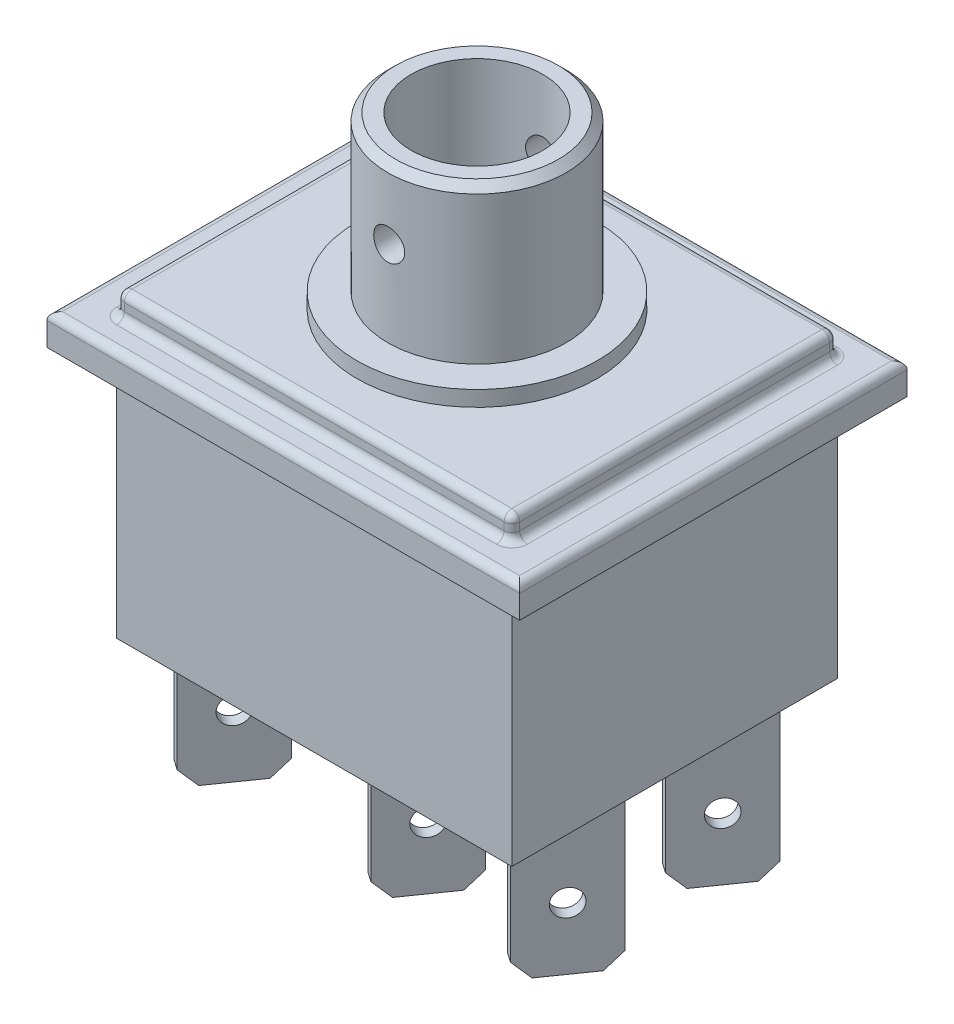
ISO-10303-21;
HEADER;
FILE_DESCRIPTION(('STEP AP214'),'2;1');
FILE_NAME('part.step','',(''),(''),'','','');
FILE_SCHEMA(('AUTOMOTIVE_DESIGN { 1 0 10303 214 1 1 1 1 }'));
ENDSEC;
DATA;
#1=APPLICATION_CONTEXT('core data for automotive mechanical design processes');
#2=APPLICATION_PROTOCOL_DEFINITION('international standard','automotive_design',2000,#1);
#3=PRODUCT_CONTEXT('',#1,'mechanical');
#4=PRODUCT('Part','Part','',(#3));
#5=PRODUCT_RELATED_PRODUCT_CATEGORY('part','',(#4));
#6=PRODUCT_DEFINITION_FORMATION('','',#4);
#7=PRODUCT_DEFINITION_CONTEXT('part definition',#1,'design');
#8=PRODUCT_DEFINITION('design','',#6,#7);
#9=PRODUCT_DEFINITION_SHAPE('','',#8);
#10=(LENGTH_UNIT() NAMED_UNIT(*) SI_UNIT(.MILLI.,.METRE.));
#11=(NAMED_UNIT(*) PLANE_ANGLE_UNIT() SI_UNIT($,.RADIAN.));
#12=(NAMED_UNIT(*) SI_UNIT($,.STERADIAN.) SOLID_ANGLE_UNIT());
#13=UNCERTAINTY_MEASURE_WITH_UNIT(LENGTH_MEASURE(1.E-05),#10,'distance_accuracy_value','');
#14=(GEOMETRIC_REPRESENTATION_CONTEXT(3) GLOBAL_UNCERTAINTY_ASSIGNED_CONTEXT((#13)) GLOBAL_UNIT_ASSIGNED_CONTEXT((#10,
#11,#12)) REPRESENTATION_CONTEXT('',''));
#15=CARTESIAN_POINT('',(0.,0.,0.));
#16=DIRECTION('',(0.,0.,1.));
#17=DIRECTION('',(1.,0.,0.));
#18=AXIS2_PLACEMENT_3D('',#15,#16,#17);
#19=CARTESIAN_POINT('',(12.75,-19.5,12.5));
#20=DIRECTION('',(0.,1.,0.));
#21=DIRECTION('',(-1.,0.,0.));
#22=AXIS2_PLACEMENT_3D('',#19,#20,#21);
#23=PLANE('',#22);
#24=DIRECTION('',(0.819152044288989,0.,0.57357643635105));
#25=VECTOR('',#24,1.);
#26=CARTESIAN_POINT('',(-8.90236162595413,-19.5,3.05867765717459));
#27=LINE('',#26,#25);
#28=CARTESIAN_POINT('',(-9.55768326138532,-19.5,2.59981650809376));
#29=VERTEX_POINT('',#28);
#30=CARTESIAN_POINT('',(-8.90236162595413,-19.5,3.05867765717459));
#31=VERTEX_POINT('',#30);
#32=EDGE_CURVE('E491',#29,#31,#27,.T.);
#33=ORIENTED_EDGE('',*,*,#32,.F.);
#34=DIRECTION('',(0.57357643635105,0.,-0.819152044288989));
#35=VECTOR('',#34,1.);
#36=CARTESIAN_POINT('',(-9.55768326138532,-19.5,2.59981650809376));
#37=LINE('',#36,#35);
#38=CARTESIAN_POINT('',(-12.5976383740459,-19.5,6.94132234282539));
#39=VERTEX_POINT('',#38);
#40=EDGE_CURVE('E438',#39,#29,#37,.T.);
#41=ORIENTED_EDGE('',*,*,#40,.F.);
#42=DIRECTION('',(-0.819152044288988,0.,-0.573576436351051));
#43=VECTOR('',#42,1.);
#44=CARTESIAN_POINT('',(-12.5976383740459,-19.5,6.9413223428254));
#45=LINE('',#44,#43);
#46=CARTESIAN_POINT('',(-11.9423167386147,-19.5,7.40018349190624));
#47=VERTEX_POINT('',#46);
#48=EDGE_CURVE('E471',#47,#39,#45,.T.);
#49=ORIENTED_EDGE('',*,*,#48,.F.);
#50=DIRECTION('',(-0.57357643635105,0.,0.819152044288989));
#51=VECTOR('',#50,1.);
#52=CARTESIAN_POINT('',(-11.9423167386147,-19.5,7.40018349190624));
#53=LINE('',#52,#51);
#54=EDGE_CURVE('E482',#31,#47,#53,.T.);
#55=ORIENTED_EDGE('',*,*,#54,.F.);
#56=EDGE_LOOP('',(#33,#41,#49,#55));
#57=FACE_BOUND('',#56,.T.);
#58=DIRECTION('',(0.57357643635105,0.,-0.819152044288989));
#59=VECTOR('',#58,1.);
#60=CARTESIAN_POINT('',(2.94231673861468,-19.5,2.59981650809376));
#61=LINE('',#60,#59);
#62=CARTESIAN_POINT('',(-0.0976383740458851,-19.5,6.9413223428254));
#63=VERTEX_POINT('',#62);
#64=CARTESIAN_POINT('',(2.94231673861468,-19.5,2.59981650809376));
#65=VERTEX_POINT('',#64);
#66=EDGE_CURVE('E570',#63,#65,#61,.T.);
#67=ORIENTED_EDGE('',*,*,#66,.F.);
#68=DIRECTION('',(-0.819152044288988,0.,-0.573576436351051));
#69=VECTOR('',#68,1.);
#70=CARTESIAN_POINT('',(-0.0976383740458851,-19.5,6.9413223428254));
#71=LINE('',#70,#69);
#72=CARTESIAN_POINT('',(0.557683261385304,-19.5,7.40018349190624));
#73=VERTEX_POINT('',#72);
#74=EDGE_CURVE('E579',#73,#63,#71,.T.);
#75=ORIENTED_EDGE('',*,*,#74,.F.);
#76=DIRECTION('',(-0.57357643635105,0.,0.819152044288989));
#77=VECTOR('',#76,1.);
#78=CARTESIAN_POINT('',(0.557683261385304,-19.5,7.40018349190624));
#79=LINE('',#78,#77);
#80=CARTESIAN_POINT('',(3.59763837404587,-19.5,3.05867765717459));
#81=VERTEX_POINT('',#80);
#82=EDGE_CURVE('E526',#81,#73,#79,.T.);
#83=ORIENTED_EDGE('',*,*,#82,.F.);
#84=DIRECTION('',(0.819152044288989,0.,0.57357643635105));
#85=VECTOR('',#84,1.);
#86=CARTESIAN_POINT('',(3.59763837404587,-19.5,3.05867765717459));
#87=LINE('',#86,#85);
#88=EDGE_CURVE('E576',#65,#81,#87,.T.);
#89=ORIENTED_EDGE('',*,*,#88,.F.);
#90=EDGE_LOOP('',(#67,#75,#83,#89));
#91=FACE_BOUND('',#90,.T.);
#92=DIRECTION('',(-0.819152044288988,0.,-0.573576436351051));
#93=VECTOR('',#92,1.);
#94=CARTESIAN_POINT('',(8.90236162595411,-19.5,6.9413223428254));
#95=LINE('',#94,#93);
#96=CARTESIAN_POINT('',(9.5576832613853,-19.5,7.40018349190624));
#97=VERTEX_POINT('',#96);
#98=CARTESIAN_POINT('',(8.90236162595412,-19.5,6.9413223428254));
#99=VERTEX_POINT('',#98);
#100=EDGE_CURVE('E644',#97,#99,#95,.T.);
#101=ORIENTED_EDGE('',*,*,#100,.F.);
#102=DIRECTION('',(-0.57357643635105,0.,0.819152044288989));
#103=VECTOR('',#102,1.);
#104=CARTESIAN_POINT('',(9.5576832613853,-19.5,7.40018349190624));
#105=LINE('',#104,#103);
#106=CARTESIAN_POINT('',(12.5976383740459,-19.5,3.05867765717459));
#107=VERTEX_POINT('',#106);
#108=EDGE_CURVE('E653',#107,#97,#105,.T.);
#109=ORIENTED_EDGE('',*,*,#108,.F.);
#110=DIRECTION('',(0.819152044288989,0.,0.57357643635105));
#111=VECTOR('',#110,1.);
#112=CARTESIAN_POINT('',(12.5976383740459,-19.5,3.05867765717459));
#113=LINE('',#112,#111);
#114=CARTESIAN_POINT('',(11.9423167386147,-19.5,2.59981650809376));
#115=VERTEX_POINT('',#114);
#116=EDGE_CURVE('E650',#115,#107,#113,.T.);
#117=ORIENTED_EDGE('',*,*,#116,.F.);
#118=DIRECTION('',(0.57357643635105,0.,-0.819152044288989));
#119=VECTOR('',#118,1.);
#120=CARTESIAN_POINT('',(11.9423167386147,-19.5,2.59981650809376));
#121=LINE('',#120,#119);
#122=EDGE_CURVE('E647',#99,#115,#121,.T.);
#123=ORIENTED_EDGE('',*,*,#122,.F.);
#124=EDGE_LOOP('',(#101,#109,#117,#123));
#125=FACE_BOUND('',#124,.T.);
#126=DIRECTION('',(0.,0.,-1.));
#127=VECTOR('',#126,1.);
#128=CARTESIAN_POINT('',(-12.75,-19.5,12.5));
#129=LINE('',#128,#127);
#130=CARTESIAN_POINT('',(-12.75,-19.5,10.5));
#131=VERTEX_POINT('',#130);
#132=CARTESIAN_POINT('',(-12.75,-19.5,-10.5));
#133=VERTEX_POINT('',#132);
#134=EDGE_CURVE('E833',#131,#133,#129,.T.);
#135=ORIENTED_EDGE('',*,*,#134,.T.);
#136=DIRECTION('',(-1.,0.,0.));
#137=VECTOR('',#136,1.);
#138=CARTESIAN_POINT('',(-12.75,-19.5,-10.5));
#139=LINE('',#138,#137);
#140=CARTESIAN_POINT('',(12.75,-19.5,-10.5));
#141=VERTEX_POINT('',#140);
#142=EDGE_CURVE('E789',#141,#133,#139,.T.);
#143=ORIENTED_EDGE('',*,*,#142,.F.);
#144=DIRECTION('',(0.,0.,-1.));
#145=VECTOR('',#144,1.);
#146=CARTESIAN_POINT('',(12.75,-19.5,12.5));
#147=LINE('',#146,#145);
#148=CARTESIAN_POINT('',(12.75,-19.5,10.5));
#149=VERTEX_POINT('',#148);
#150=EDGE_CURVE('E830',#149,#141,#147,.T.);
#151=ORIENTED_EDGE('',*,*,#150,.F.);
#152=DIRECTION('',(1.,0.,0.));
#153=VECTOR('',#152,1.);
#154=CARTESIAN_POINT('',(-12.75,-19.5,10.5));
#155=LINE('',#154,#153);
#156=EDGE_CURVE('E803',#131,#149,#155,.T.);
#157=ORIENTED_EDGE('',*,*,#156,.F.);
#158=EDGE_LOOP('',(#135,#143,#151,#157));
#159=FACE_BOUND('',#158,.T.);
#160=DIRECTION('',(0.57357643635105,0.,-0.819152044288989));
#161=VECTOR('',#160,1.);
#162=CARTESIAN_POINT('',(11.9423167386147,-19.5,-7.40018349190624));
#163=LINE('',#162,#161);
#164=CARTESIAN_POINT('',(8.90236162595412,-19.5,-3.0586776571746));
#165=VERTEX_POINT('',#164);
#166=CARTESIAN_POINT('',(11.9423167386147,-19.5,-7.40018349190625));
#167=VERTEX_POINT('',#166);
#168=EDGE_CURVE('E626',#165,#167,#163,.T.);
#169=ORIENTED_EDGE('',*,*,#168,.F.);
#170=DIRECTION('',(-0.819152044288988,0.,-0.573576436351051));
#171=VECTOR('',#170,1.);
#172=CARTESIAN_POINT('',(8.90236162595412,-19.5,-3.0586776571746));
#173=LINE('',#172,#171);
#174=CARTESIAN_POINT('',(9.55768326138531,-19.5,-2.59981650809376));
#175=VERTEX_POINT('',#174);
#176=EDGE_CURVE('E635',#175,#165,#173,.T.);
#177=ORIENTED_EDGE('',*,*,#176,.F.);
#178=DIRECTION('',(-0.57357643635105,0.,0.819152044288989));
#179=VECTOR('',#178,1.);
#180=CARTESIAN_POINT('',(9.55768326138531,-19.5,-2.59981650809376));
#181=LINE('',#180,#179);
#182=CARTESIAN_POINT('',(12.5976383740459,-19.5,-6.94132234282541));
#183=VERTEX_POINT('',#182);
#184=EDGE_CURVE('E582',#183,#175,#181,.T.);
#185=ORIENTED_EDGE('',*,*,#184,.F.);
#186=DIRECTION('',(0.819152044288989,0.,0.57357643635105));
#187=VECTOR('',#186,1.);
#188=CARTESIAN_POINT('',(12.5976383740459,-19.5,-6.94132234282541));
#189=LINE('',#188,#187);
#190=EDGE_CURVE('E632',#167,#183,#189,.T.);
#191=ORIENTED_EDGE('',*,*,#190,.F.);
#192=EDGE_LOOP('',(#169,#177,#185,#191));
#193=FACE_BOUND('',#192,.T.);
#194=DIRECTION('',(-0.819152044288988,0.,-0.573576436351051));
#195=VECTOR('',#194,1.);
#196=CARTESIAN_POINT('',(-0.0976383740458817,-19.5,-3.0586776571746));
#197=LINE('',#196,#195);
#198=CARTESIAN_POINT('',(0.557683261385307,-19.5,-2.59981650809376));
#199=VERTEX_POINT('',#198);
#200=CARTESIAN_POINT('',(-0.0976383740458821,-19.5,-3.0586776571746));
#201=VERTEX_POINT('',#200);
#202=EDGE_CURVE('E500',#199,#201,#197,.T.);
#203=ORIENTED_EDGE('',*,*,#202,.F.);
#204=DIRECTION('',(-0.57357643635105,0.,0.819152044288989));
#205=VECTOR('',#204,1.);
#206=CARTESIAN_POINT('',(0.557683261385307,-19.5,-2.59981650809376));
#207=LINE('',#206,#205);
#208=CARTESIAN_POINT('',(3.59763837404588,-19.5,-6.9413223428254));
#209=VERTEX_POINT('',#208);
#210=EDGE_CURVE('E509',#209,#199,#207,.T.);
#211=ORIENTED_EDGE('',*,*,#210,.F.);
#212=DIRECTION('',(0.819152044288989,0.,0.57357643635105));
#213=VECTOR('',#212,1.);
#214=CARTESIAN_POINT('',(3.59763837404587,-19.5,-6.94132234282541));
#215=LINE('',#214,#213);
#216=CARTESIAN_POINT('',(2.94231673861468,-19.5,-7.40018349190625));
#217=VERTEX_POINT('',#216);
#218=EDGE_CURVE('E506',#217,#209,#215,.T.);
#219=ORIENTED_EDGE('',*,*,#218,.F.);
#220=DIRECTION('',(0.57357643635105,0.,-0.819152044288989));
#221=VECTOR('',#220,1.);
#222=CARTESIAN_POINT('',(2.94231673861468,-19.5,-7.40018349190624));
#223=LINE('',#222,#221);
#224=EDGE_CURVE('E503',#201,#217,#223,.T.);
#225=ORIENTED_EDGE('',*,*,#224,.F.);
#226=EDGE_LOOP('',(#203,#211,#219,#225));
#227=FACE_BOUND('',#226,.T.);
#228=DIRECTION('',(-0.819152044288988,0.,-0.573576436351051));
#229=VECTOR('',#228,1.);
#230=CARTESIAN_POINT('',(-12.5976383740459,-19.5,-3.0586776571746));
#231=LINE('',#230,#229);
#232=CARTESIAN_POINT('',(-11.9423167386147,-19.5,-2.59981650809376));
#233=VERTEX_POINT('',#232);
#234=CARTESIAN_POINT('',(-12.5976383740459,-19.5,-3.0586776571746));
#235=VERTEX_POINT('',#234);
#236=EDGE_CURVE('E406',#233,#235,#231,.T.);
#237=ORIENTED_EDGE('',*,*,#236,.F.);
#238=DIRECTION('',(-0.57357643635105,0.,0.819152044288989));
#239=VECTOR('',#238,1.);
#240=CARTESIAN_POINT('',(-11.9423167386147,-19.5,-2.59981650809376));
#241=LINE('',#240,#239);
#242=CARTESIAN_POINT('',(-8.90236162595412,-19.5,-6.94132234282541));
#243=VERTEX_POINT('',#242);
#244=EDGE_CURVE('E416',#243,#233,#241,.T.);
#245=ORIENTED_EDGE('',*,*,#244,.F.);
#246=DIRECTION('',(0.819152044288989,0.,0.57357643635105));
#247=VECTOR('',#246,1.);
#248=CARTESIAN_POINT('',(-8.90236162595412,-19.5,-6.94132234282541));
#249=LINE('',#248,#247);
#250=CARTESIAN_POINT('',(-9.55768326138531,-19.5,-7.40018349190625));
#251=VERTEX_POINT('',#250);
#252=EDGE_CURVE('E424',#251,#243,#249,.T.);
#253=ORIENTED_EDGE('',*,*,#252,.F.);
#254=DIRECTION('',(0.57357643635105,0.,-0.819152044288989));
#255=VECTOR('',#254,1.);
#256=CARTESIAN_POINT('',(-9.55768326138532,-19.5,-7.40018349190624));
#257=LINE('',#256,#255);
#258=EDGE_CURVE('E419',#235,#251,#257,.T.);
#259=ORIENTED_EDGE('',*,*,#258,.F.);
#260=EDGE_LOOP('',(#237,#245,#253,#259));
#261=FACE_BOUND('',#260,.T.);
#262=ADVANCED_FACE('F28',(#57,#91,#125,#159,#193,#227,#261),#23,.F.);
#263=CARTESIAN_POINT('',(0.,1.,0.));
#264=DIRECTION('',(0.,1.,0.));
#265=DIRECTION('',(-1.,0.,0.));
#266=AXIS2_PLACEMENT_3D('',#263,#264,#265);
#267=PLANE('',#266);
#268=CARTESIAN_POINT('',(0.,1.,0.));
#269=DIRECTION('',(0.,1.,0.));
#270=DIRECTION('',(-1.,0.,0.));
#271=AXIS2_PLACEMENT_3D('',#268,#269,#270);
#272=CIRCLE('',#271,7.75);
#273=CARTESIAN_POINT('',(-7.75,0.999999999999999,0.));
#274=VERTEX_POINT('',#273);
#275=EDGE_CURVE('E1790',#274,#274,#272,.T.);
#276=ORIENTED_EDGE('',*,*,#275,.T.);
#277=EDGE_LOOP('',(#276));
#278=FACE_BOUND('',#277,.T.);
#279=CARTESIAN_POINT('',(0.,1.,0.));
#280=DIRECTION('',(0.,1.,0.));
#281=DIRECTION('',(-1.,0.,0.));
#282=AXIS2_PLACEMENT_3D('',#279,#280,#281);
#283=CIRCLE('',#282,5.75);
#284=CARTESIAN_POINT('',(-5.75,0.999999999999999,0.));
#285=VERTEX_POINT('',#284);
#286=EDGE_CURVE('E1788',#285,#285,#283,.T.);
#287=ORIENTED_EDGE('',*,*,#286,.F.);
#288=EDGE_LOOP('',(#287));
#289=FACE_BOUND('',#288,.T.);
#290=ADVANCED_FACE('F733',(#278,#289),#267,.T.);
#291=CARTESIAN_POINT('',(-12.75,0.,12.5));
#292=DIRECTION('',(0.,-1.,0.));
#293=DIRECTION('',(1.,0.,0.));
#294=AXIS2_PLACEMENT_3D('',#291,#292,#293);
#295=PLANE('',#294);
#296=DIRECTION('',(0.,0.,-1.));
#297=VECTOR('',#296,1.);
#298=CARTESIAN_POINT('',(-12.25,0.,12.5));
#299=LINE('',#298,#297);
#300=CARTESIAN_POINT('',(-12.25,0.,-9.99999999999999));
#301=VERTEX_POINT('',#300);
#302=CARTESIAN_POINT('',(-12.25,0.,10.));
#303=VERTEX_POINT('',#302);
#304=EDGE_CURVE('E882',#301,#303,#299,.F.);
#305=ORIENTED_EDGE('',*,*,#304,.T.);
#306=DIRECTION('',(-1.,0.,0.));
#307=VECTOR('',#306,1.);
#308=CARTESIAN_POINT('',(-12.75,0.,10.));
#309=LINE('',#308,#307);
#310=CARTESIAN_POINT('',(12.25,0.,10.));
#311=VERTEX_POINT('',#310);
#312=EDGE_CURVE('E888',#303,#311,#309,.F.);
#313=ORIENTED_EDGE('',*,*,#312,.T.);
#314=DIRECTION('',(0.,0.,-1.));
#315=VECTOR('',#314,1.);
#316=CARTESIAN_POINT('',(12.25,0.,12.5));
#317=LINE('',#316,#315);
#318=CARTESIAN_POINT('',(12.25,0.,-10.));
#319=VERTEX_POINT('',#318);
#320=EDGE_CURVE('E886',#311,#319,#317,.T.);
#321=ORIENTED_EDGE('',*,*,#320,.T.);
#322=DIRECTION('',(1.,0.,0.));
#323=VECTOR('',#322,1.);
#324=CARTESIAN_POINT('',(-12.75,0.,-9.99999999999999));
#325=LINE('',#324,#323);
#326=EDGE_CURVE('E884',#319,#301,#325,.F.);
#327=ORIENTED_EDGE('',*,*,#326,.T.);
#328=EDGE_LOOP('',(#305,#313,#321,#327));
#329=FACE_BOUND('',#328,.T.);
#330=CARTESIAN_POINT('',(0.,0.,0.));
#331=DIRECTION('',(0.,-1.,0.));
#332=DIRECTION('',(1.,0.,0.));
#333=AXIS2_PLACEMENT_3D('',#330,#331,#332);
#334=CIRCLE('',#333,7.75);
#335=CARTESIAN_POINT('',(7.75,0.,0.));
#336=VERTEX_POINT('',#335);
#337=EDGE_CURVE('E918',#336,#336,#334,.F.);
#338=ORIENTED_EDGE('',*,*,#337,.F.);
#339=EDGE_LOOP('',(#338));
#340=FACE_BOUND('',#339,.T.);
#341=ADVANCED_FACE('F739',(#329,#340),#295,.F.);
#342=CARTESIAN_POINT('',(-12.75,-1.5,12.5));
#343=DIRECTION('',(1.,0.,0.));
#344=DIRECTION('',(0.,0.,-1.));
#345=AXIS2_PLACEMENT_3D('',#342,#343,#344);
#346=PLANE('',#345);
#347=DIRECTION('',(0.,0.,-1.));
#348=VECTOR('',#347,1.);
#349=CARTESIAN_POINT('',(-12.75,-1.00000000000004,10.5));
#350=LINE('',#349,#348);
#351=CARTESIAN_POINT('',(-12.75,-1.00000000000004,-9.99999999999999));
#352=VERTEX_POINT('',#351);
#353=CARTESIAN_POINT('',(-12.75,-1.00000000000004,10.));
#354=VERTEX_POINT('',#353);
#355=EDGE_CURVE('E913',#352,#354,#350,.F.);
#356=ORIENTED_EDGE('',*,*,#355,.T.);
#357=DIRECTION('',(0.,1.,0.));
#358=VECTOR('',#357,1.);
#359=CARTESIAN_POINT('',(-12.75,-1.5,10.));
#360=LINE('',#359,#358);
#361=CARTESIAN_POINT('',(-12.75,-0.5,10.));
#362=VERTEX_POINT('',#361);
#363=EDGE_CURVE('E915',#354,#362,#360,.T.);
#364=ORIENTED_EDGE('',*,*,#363,.T.);
#365=DIRECTION('',(0.,0.,-1.));
#366=VECTOR('',#365,1.);
#367=CARTESIAN_POINT('',(-12.75,-0.5,12.5));
#368=LINE('',#367,#366);
#369=CARTESIAN_POINT('',(-12.75,-0.5,-9.99999999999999));
#370=VERTEX_POINT('',#369);
#371=EDGE_CURVE('E909',#362,#370,#368,.T.);
#372=ORIENTED_EDGE('',*,*,#371,.T.);
#373=DIRECTION('',(0.,1.,0.));
#374=VECTOR('',#373,1.);
#375=CARTESIAN_POINT('',(-12.75,-1.5,-9.99999999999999));
#376=LINE('',#375,#374);
#377=EDGE_CURVE('E911',#370,#352,#376,.F.);
#378=ORIENTED_EDGE('',*,*,#377,.T.);
#379=EDGE_LOOP('',(#356,#364,#372,#378));
#380=FACE_BOUND('',#379,.T.);
#381=ADVANCED_FACE('F30',(#380),#346,.F.);
#382=CARTESIAN_POINT('',(-15.25,-3.5,12.5));
#383=DIRECTION('',(1.,0.,0.));
#384=DIRECTION('',(0.,1.,0.));
#385=AXIS2_PLACEMENT_3D('',#382,#383,#384);
#386=PLANE('',#385);
#387=DIRECTION('',(0.,-1.,0.));
#388=VECTOR('',#387,1.);
#389=CARTESIAN_POINT('',(-15.25,-3.5,12.5));
#390=LINE('',#389,#388);
#391=CARTESIAN_POINT('',(-15.25,-2.00000000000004,12.5));
#392=VERTEX_POINT('',#391);
#393=CARTESIAN_POINT('',(-15.25,-3.5,12.5));
#394=VERTEX_POINT('',#393);
#395=EDGE_CURVE('E758',#392,#394,#390,.T.);
#396=ORIENTED_EDGE('',*,*,#395,.F.);
#397=DIRECTION('',(0.,0.,-1.));
#398=VECTOR('',#397,1.);
#399=CARTESIAN_POINT('',(-15.25,-2.00000000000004,12.5));
#400=LINE('',#399,#398);
#401=CARTESIAN_POINT('',(-15.25,-2.00000000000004,-12.5));
#402=VERTEX_POINT('',#401);
#403=EDGE_CURVE('E760',#392,#402,#400,.T.);
#404=ORIENTED_EDGE('',*,*,#403,.T.);
#405=DIRECTION('',(0.,-1.,0.));
#406=VECTOR('',#405,1.);
#407=CARTESIAN_POINT('',(-15.25,-3.5,-12.5));
#408=LINE('',#407,#406);
#409=CARTESIAN_POINT('',(-15.25,-3.5,-12.5));
#410=VERTEX_POINT('',#409);
#411=EDGE_CURVE('E814',#402,#410,#408,.T.);
#412=ORIENTED_EDGE('',*,*,#411,.T.);
#413=DIRECTION('',(0.,0.,-1.));
#414=VECTOR('',#413,1.);
#415=CARTESIAN_POINT('',(-15.25,-3.5,12.5));
#416=LINE('',#415,#414);
#417=EDGE_CURVE('E763',#394,#410,#416,.T.);
#418=ORIENTED_EDGE('',*,*,#417,.F.);
#419=EDGE_LOOP('',(#396,#404,#412,#418));
#420=FACE_BOUND('',#419,.T.);
#421=ADVANCED_FACE('F748',(#420),#386,.F.);
#422=CARTESIAN_POINT('',(-12.75,-19.5,12.5));
#423=DIRECTION('',(1.,0.,0.));
#424=DIRECTION('',(0.,1.,0.));
#425=AXIS2_PLACEMENT_3D('',#422,#423,#424);
#426=PLANE('',#425);
#427=DIRECTION('',(0.,0.,-1.));
#428=VECTOR('',#427,1.);
#429=CARTESIAN_POINT('',(-12.75,-3.5,12.5));
#430=LINE('',#429,#428);
#431=CARTESIAN_POINT('',(-12.75,-3.49999999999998,10.5));
#432=VERTEX_POINT('',#431);
#433=CARTESIAN_POINT('',(-12.75,-3.49999999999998,-10.5));
#434=VERTEX_POINT('',#433);
#435=EDGE_CURVE('E836',#432,#434,#430,.T.);
#436=ORIENTED_EDGE('',*,*,#435,.T.);
#437=DIRECTION('',(0.,-1.,0.));
#438=VECTOR('',#437,1.);
#439=CARTESIAN_POINT('',(-12.75,22.0783111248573,-10.5));
#440=LINE('',#439,#438);
#441=EDGE_CURVE('E800',#434,#133,#440,.T.);
#442=ORIENTED_EDGE('',*,*,#441,.T.);
#443=ORIENTED_EDGE('',*,*,#134,.F.);
#444=DIRECTION('',(0.,-1.,0.));
#445=VECTOR('',#444,1.);
#446=CARTESIAN_POINT('',(-12.75,22.0783111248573,10.5));
#447=LINE('',#446,#445);
#448=EDGE_CURVE('E812',#432,#131,#447,.T.);
#449=ORIENTED_EDGE('',*,*,#448,.F.);
#450=EDGE_LOOP('',(#436,#442,#443,#449));
#451=FACE_BOUND('',#450,.T.);
#452=ADVANCED_FACE('F746',(#451),#426,.F.);
#453=CARTESIAN_POINT('',(12.75,-3.49999999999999,12.5));
#454=DIRECTION('',(-1.,0.,0.));
#455=DIRECTION('',(0.,0.,1.));
#456=AXIS2_PLACEMENT_3D('',#453,#454,#455);
#457=PLANE('',#456);
#458=ORIENTED_EDGE('',*,*,#150,.T.);
#459=DIRECTION('',(0.,-1.,0.));
#460=VECTOR('',#459,1.);
#461=CARTESIAN_POINT('',(12.75,22.0783111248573,-10.5));
#462=LINE('',#461,#460);
#463=CARTESIAN_POINT('',(12.75,-3.5,-10.5));
#464=VERTEX_POINT('',#463);
#465=EDGE_CURVE('E791',#464,#141,#462,.T.);
#466=ORIENTED_EDGE('',*,*,#465,.F.);
#467=DIRECTION('',(0.,0.,-1.));
#468=VECTOR('',#467,1.);
#469=CARTESIAN_POINT('',(12.75,-3.49999999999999,12.5));
#470=LINE('',#469,#468);
#471=CARTESIAN_POINT('',(12.75,-3.49999999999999,10.5));
#472=VERTEX_POINT('',#471);
#473=EDGE_CURVE('E827',#472,#464,#470,.T.);
#474=ORIENTED_EDGE('',*,*,#473,.F.);
#475=DIRECTION('',(0.,-1.,0.));
#476=VECTOR('',#475,1.);
#477=CARTESIAN_POINT('',(12.75,22.0783111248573,10.5));
#478=LINE('',#477,#476);
#479=EDGE_CURVE('E809',#472,#149,#478,.T.);
#480=ORIENTED_EDGE('',*,*,#479,.T.);
#481=EDGE_LOOP('',(#458,#466,#474,#480));
#482=FACE_BOUND('',#481,.T.);
#483=ADVANCED_FACE('F744',(#482),#457,.F.);
#484=CARTESIAN_POINT('',(15.25,-3.5,12.5));
#485=DIRECTION('',(0.,1.,0.));
#486=DIRECTION('',(-1.,0.,0.));
#487=AXIS2_PLACEMENT_3D('',#484,#485,#486);
#488=PLANE('',#487);
#489=ORIENTED_EDGE('',*,*,#473,.T.);
#490=DIRECTION('',(-1.,0.,0.));
#491=VECTOR('',#490,1.);
#492=CARTESIAN_POINT('',(-12.75,-3.49999999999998,-10.5));
#493=LINE('',#492,#491);
#494=EDGE_CURVE('E797',#464,#434,#493,.T.);
#495=ORIENTED_EDGE('',*,*,#494,.T.);
#496=ORIENTED_EDGE('',*,*,#435,.F.);
#497=DIRECTION('',(1.,0.,0.));
#498=VECTOR('',#497,1.);
#499=CARTESIAN_POINT('',(-12.75,-3.49999999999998,10.5));
#500=LINE('',#499,#498);
#501=EDGE_CURVE('E806',#432,#472,#500,.T.);
#502=ORIENTED_EDGE('',*,*,#501,.T.);
#503=EDGE_LOOP('',(#489,#495,#496,#502));
#504=FACE_BOUND('',#503,.T.);
#505=DIRECTION('',(1.,0.,0.));
#506=VECTOR('',#505,1.);
#507=CARTESIAN_POINT('',(15.25,-3.5,-12.5));
#508=LINE('',#507,#506);
#509=CARTESIAN_POINT('',(15.25,-3.5,-12.5));
#510=VERTEX_POINT('',#509);
#511=EDGE_CURVE('E816',#410,#510,#508,.T.);
#512=ORIENTED_EDGE('',*,*,#511,.T.);
#513=DIRECTION('',(0.,0.,-1.));
#514=VECTOR('',#513,1.);
#515=CARTESIAN_POINT('',(15.25,-3.5,12.5));
#516=LINE('',#515,#514);
#517=CARTESIAN_POINT('',(15.25,-3.5,12.5));
#518=VERTEX_POINT('',#517);
#519=EDGE_CURVE('E824',#518,#510,#516,.T.);
#520=ORIENTED_EDGE('',*,*,#519,.F.);
#521=DIRECTION('',(1.,0.,0.));
#522=VECTOR('',#521,1.);
#523=CARTESIAN_POINT('',(-12.75,-3.5,12.5));
#524=LINE('',#523,#522);
#525=EDGE_CURVE('E766',#394,#518,#524,.T.);
#526=ORIENTED_EDGE('',*,*,#525,.F.);
#527=ORIENTED_EDGE('',*,*,#417,.T.);
#528=EDGE_LOOP('',(#512,#520,#526,#527));
#529=FACE_BOUND('',#528,.T.);
#530=ADVANCED_FACE('F1236',(#504,#529),#488,.F.);
#531=CARTESIAN_POINT('',(15.25,-1.49999999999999,12.5));
#532=DIRECTION('',(-1.,0.,0.));
#533=DIRECTION('',(0.,-1.,0.));
#534=AXIS2_PLACEMENT_3D('',#531,#532,#533);
#535=PLANE('',#534);
#536=DIRECTION('',(0.,1.,0.));
#537=VECTOR('',#536,1.);
#538=CARTESIAN_POINT('',(15.25,-1.49999999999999,-12.5));
#539=LINE('',#538,#537);
#540=CARTESIAN_POINT('',(15.25,-1.99999999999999,-12.5));
#541=VERTEX_POINT('',#540);
#542=EDGE_CURVE('E767',#510,#541,#539,.T.);
#543=ORIENTED_EDGE('',*,*,#542,.T.);
#544=DIRECTION('',(0.,0.,-1.));
#545=VECTOR('',#544,1.);
#546=CARTESIAN_POINT('',(15.25,-1.99999999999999,12.5));
#547=LINE('',#546,#545);
#548=CARTESIAN_POINT('',(15.25,-1.99999999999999,12.5));
#549=VERTEX_POINT('',#548);
#550=EDGE_CURVE('E869',#541,#549,#547,.F.);
#551=ORIENTED_EDGE('',*,*,#550,.T.);
#552=DIRECTION('',(0.,1.,0.));
#553=VECTOR('',#552,1.);
#554=CARTESIAN_POINT('',(15.25,-1.49999999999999,12.5));
#555=LINE('',#554,#553);
#556=EDGE_CURVE('E821',#518,#549,#555,.T.);
#557=ORIENTED_EDGE('',*,*,#556,.F.);
#558=ORIENTED_EDGE('',*,*,#519,.T.);
#559=EDGE_LOOP('',(#543,#551,#557,#558));
#560=FACE_BOUND('',#559,.T.);
#561=ADVANCED_FACE('F1268',(#560),#535,.F.);
#562=CARTESIAN_POINT('',(12.75,-1.5,12.5));
#563=DIRECTION('',(0.,-1.,0.));
#564=DIRECTION('',(1.,0.,0.));
#565=AXIS2_PLACEMENT_3D('',#562,#563,#564);
#566=PLANE('',#565);
#567=DIRECTION('',(-1.,0.,0.));
#568=VECTOR('',#567,1.);
#569=CARTESIAN_POINT('',(15.25,-1.49999999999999,12.));
#570=LINE('',#569,#568);
#571=CARTESIAN_POINT('',(-14.75,-1.50000000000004,12.));
#572=VERTEX_POINT('',#571);
#573=CARTESIAN_POINT('',(14.75,-1.49999999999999,12.));
#574=VERTEX_POINT('',#573);
#575=EDGE_CURVE('E788',#572,#574,#570,.F.);
#576=ORIENTED_EDGE('',*,*,#575,.T.);
#577=DIRECTION('',(0.,0.,-1.));
#578=VECTOR('',#577,1.);
#579=CARTESIAN_POINT('',(14.75,-1.49999999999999,12.5));
#580=LINE('',#579,#578);
#581=CARTESIAN_POINT('',(14.75,-1.49999999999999,-12.));
#582=VERTEX_POINT('',#581);
#583=EDGE_CURVE('E866',#574,#582,#580,.T.);
#584=ORIENTED_EDGE('',*,*,#583,.T.);
#585=DIRECTION('',(-1.,0.,0.));
#586=VECTOR('',#585,1.);
#587=CARTESIAN_POINT('',(12.75,-1.5,-12.));
#588=LINE('',#587,#586);
#589=CARTESIAN_POINT('',(-14.75,-1.50000000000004,-12.));
#590=VERTEX_POINT('',#589);
#591=EDGE_CURVE('E861',#582,#590,#588,.T.);
#592=ORIENTED_EDGE('',*,*,#591,.T.);
#593=DIRECTION('',(0.,0.,-1.));
#594=VECTOR('',#593,1.);
#595=CARTESIAN_POINT('',(-14.75,-1.50000000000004,12.5));
#596=LINE('',#595,#594);
#597=EDGE_CURVE('E863',#590,#572,#596,.F.);
#598=ORIENTED_EDGE('',*,*,#597,.T.);
#599=EDGE_LOOP('',(#576,#584,#592,#598));
#600=FACE_BOUND('',#599,.T.);
#601=CARTESIAN_POINT('',(12.25,-1.5,-10.));
#602=DIRECTION('',(0.,-1.,0.));
#603=DIRECTION('',(1.,0.,0.));
#604=AXIS2_PLACEMENT_3D('',#601,#602,#603);
#605=CIRCLE('',#604,1.);
#606=CARTESIAN_POINT('',(13.25,-1.49999999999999,-10.));
#607=VERTEX_POINT('',#606);
#608=CARTESIAN_POINT('',(12.25,-1.5,-11.));
#609=VERTEX_POINT('',#608);
#610=EDGE_CURVE('E853',#607,#609,#605,.F.);
#611=ORIENTED_EDGE('',*,*,#610,.F.);
#612=DIRECTION('',(0.,0.,-1.));
#613=VECTOR('',#612,1.);
#614=CARTESIAN_POINT('',(13.25,-1.49999999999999,10.5));
#615=LINE('',#614,#613);
#616=CARTESIAN_POINT('',(13.25,-1.49999999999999,10.));
#617=VERTEX_POINT('',#616);
#618=EDGE_CURVE('E859',#607,#617,#615,.F.);
#619=ORIENTED_EDGE('',*,*,#618,.T.);
#620=CARTESIAN_POINT('',(12.25,-1.5,10.));
#621=DIRECTION('',(0.,-1.,0.));
#622=DIRECTION('',(1.,0.,0.));
#623=AXIS2_PLACEMENT_3D('',#620,#621,#622);
#624=CIRCLE('',#623,1.);
#625=CARTESIAN_POINT('',(12.25,-1.5,11.));
#626=VERTEX_POINT('',#625);
#627=EDGE_CURVE('E856',#626,#617,#624,.F.);
#628=ORIENTED_EDGE('',*,*,#627,.F.);
#629=DIRECTION('',(-1.,0.,0.));
#630=VECTOR('',#629,1.);
#631=CARTESIAN_POINT('',(-12.75,-1.50000000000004,11.));
#632=LINE('',#631,#630);
#633=CARTESIAN_POINT('',(-12.25,-1.50000000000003,11.));
#634=VERTEX_POINT('',#633);
#635=EDGE_CURVE('E850',#626,#634,#632,.T.);
#636=ORIENTED_EDGE('',*,*,#635,.T.);
#637=CARTESIAN_POINT('',(-12.25,-1.50000000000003,10.));
#638=DIRECTION('',(0.,-1.,0.));
#639=DIRECTION('',(1.,0.,0.));
#640=AXIS2_PLACEMENT_3D('',#637,#638,#639);
#641=CIRCLE('',#640,1.);
#642=CARTESIAN_POINT('',(-13.25,-1.50000000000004,10.));
#643=VERTEX_POINT('',#642);
#644=EDGE_CURVE('E847',#643,#634,#641,.F.);
#645=ORIENTED_EDGE('',*,*,#644,.F.);
#646=DIRECTION('',(0.,0.,-1.));
#647=VECTOR('',#646,1.);
#648=CARTESIAN_POINT('',(-13.25,-1.50000000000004,-10.5));
#649=LINE('',#648,#647);
#650=CARTESIAN_POINT('',(-13.25,-1.50000000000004,-9.99999999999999));
#651=VERTEX_POINT('',#650);
#652=EDGE_CURVE('E843',#643,#651,#649,.T.);
#653=ORIENTED_EDGE('',*,*,#652,.T.);
#654=CARTESIAN_POINT('',(-12.25,-1.50000000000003,-9.99999999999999));
#655=DIRECTION('',(0.,-1.,0.));
#656=DIRECTION('',(1.,0.,0.));
#657=AXIS2_PLACEMENT_3D('',#654,#655,#656);
#658=CIRCLE('',#657,1.);
#659=CARTESIAN_POINT('',(-12.25,-1.50000000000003,-11.));
#660=VERTEX_POINT('',#659);
#661=EDGE_CURVE('E840',#660,#651,#658,.F.);
#662=ORIENTED_EDGE('',*,*,#661,.F.);
#663=DIRECTION('',(1.,0.,0.));
#664=VECTOR('',#663,1.);
#665=CARTESIAN_POINT('',(12.75,-1.5,-11.));
#666=LINE('',#665,#664);
#667=EDGE_CURVE('E845',#660,#609,#666,.T.);
#668=ORIENTED_EDGE('',*,*,#667,.T.);
#669=EDGE_LOOP('',(#611,#619,#628,#636,#645,#653,#662,#668));
#670=FACE_BOUND('',#669,.T.);
#671=ADVANCED_FACE('F1264',(#600,#670),#566,.F.);
#672=CARTESIAN_POINT('',(12.75,0.,12.5));
#673=DIRECTION('',(-1.,0.,0.));
#674=DIRECTION('',(0.,0.,1.));
#675=AXIS2_PLACEMENT_3D('',#672,#673,#674);
#676=PLANE('',#675);
#677=DIRECTION('',(0.,0.,-1.));
#678=VECTOR('',#677,1.);
#679=CARTESIAN_POINT('',(12.75,-0.499999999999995,12.5));
#680=LINE('',#679,#678);
#681=CARTESIAN_POINT('',(12.75,-0.499999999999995,-10.));
#682=VERTEX_POINT('',#681);
#683=CARTESIAN_POINT('',(12.75,-0.499999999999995,10.));
#684=VERTEX_POINT('',#683);
#685=EDGE_CURVE('E895',#682,#684,#680,.F.);
#686=ORIENTED_EDGE('',*,*,#685,.T.);
#687=DIRECTION('',(0.,1.,0.));
#688=VECTOR('',#687,1.);
#689=CARTESIAN_POINT('',(12.75,0.,10.));
#690=LINE('',#689,#688);
#691=CARTESIAN_POINT('',(12.75,-0.999999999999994,10.));
#692=VERTEX_POINT('',#691);
#693=EDGE_CURVE('E897',#684,#692,#690,.F.);
#694=ORIENTED_EDGE('',*,*,#693,.T.);
#695=DIRECTION('',(0.,0.,-1.));
#696=VECTOR('',#695,1.);
#697=CARTESIAN_POINT('',(12.75,-0.999999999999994,-10.5));
#698=LINE('',#697,#696);
#699=CARTESIAN_POINT('',(12.75,-0.999999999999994,-10.));
#700=VERTEX_POINT('',#699);
#701=EDGE_CURVE('E893',#692,#700,#698,.T.);
#702=ORIENTED_EDGE('',*,*,#701,.T.);
#703=DIRECTION('',(0.,1.,0.));
#704=VECTOR('',#703,1.);
#705=CARTESIAN_POINT('',(12.75,0.,-10.));
#706=LINE('',#705,#704);
#707=EDGE_CURVE('E891',#700,#682,#706,.T.);
#708=ORIENTED_EDGE('',*,*,#707,.T.);
#709=EDGE_LOOP('',(#686,#694,#702,#708));
#710=FACE_BOUND('',#709,.T.);
#711=ADVANCED_FACE('F1258',(#710),#676,.F.);
#712=CARTESIAN_POINT('',(-12.75,-19.5,12.5));
#713=DIRECTION('',(0.,0.,1.));
#714=DIRECTION('',(1.,0.,0.));
#715=AXIS2_PLACEMENT_3D('',#712,#713,#714);
#716=PLANE('',#715);
#717=ORIENTED_EDGE('',*,*,#556,.T.);
#718=DIRECTION('',(-1.,0.,0.));
#719=VECTOR('',#718,1.);
#720=CARTESIAN_POINT('',(-15.25,-2.00000000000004,12.5));
#721=LINE('',#720,#719);
#722=EDGE_CURVE('E781',#549,#392,#721,.T.);
#723=ORIENTED_EDGE('',*,*,#722,.T.);
#724=ORIENTED_EDGE('',*,*,#395,.T.);
#725=ORIENTED_EDGE('',*,*,#525,.T.);
#726=EDGE_LOOP('',(#717,#723,#724,#725));
#727=FACE_BOUND('',#726,.T.);
#728=ADVANCED_FACE('F1251',(#727),#716,.T.);
#729=CARTESIAN_POINT('',(-12.75,-19.5,-12.5));
#730=DIRECTION('',(0.,0.,1.));
#731=DIRECTION('',(1.,0.,0.));
#732=AXIS2_PLACEMENT_3D('',#729,#730,#731);
#733=PLANE('',#732);
#734=ORIENTED_EDGE('',*,*,#411,.F.);
#735=DIRECTION('',(-1.,0.,0.));
#736=VECTOR('',#735,1.);
#737=CARTESIAN_POINT('',(-12.75,-2.00000000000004,-12.5));
#738=LINE('',#737,#736);
#739=EDGE_CURVE('E780',#402,#541,#738,.F.);
#740=ORIENTED_EDGE('',*,*,#739,.T.);
#741=ORIENTED_EDGE('',*,*,#542,.F.);
#742=ORIENTED_EDGE('',*,*,#511,.F.);
#743=EDGE_LOOP('',(#734,#740,#741,#742));
#744=FACE_BOUND('',#743,.T.);
#745=ADVANCED_FACE('F1243',(#744),#733,.F.);
#746=CARTESIAN_POINT('',(-12.75,22.0783111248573,10.5));
#747=DIRECTION('',(0.,0.,-1.));
#748=DIRECTION('',(-1.,0.,0.));
#749=AXIS2_PLACEMENT_3D('',#746,#747,#748);
#750=PLANE('',#749);
#751=ORIENTED_EDGE('',*,*,#448,.T.);
#752=ORIENTED_EDGE('',*,*,#156,.T.);
#753=ORIENTED_EDGE('',*,*,#479,.F.);
#754=ORIENTED_EDGE('',*,*,#501,.F.);
#755=EDGE_LOOP('',(#751,#752,#753,#754));
#756=FACE_BOUND('',#755,.T.);
#757=ADVANCED_FACE('F1241',(#756),#750,.F.);
#758=CARTESIAN_POINT('',(-12.75,22.0783111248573,-10.5));
#759=DIRECTION('',(0.,0.,1.));
#760=DIRECTION('',(1.,0.,0.));
#761=AXIS2_PLACEMENT_3D('',#758,#759,#760);
#762=PLANE('',#761);
#763=ORIENTED_EDGE('',*,*,#465,.T.);
#764=ORIENTED_EDGE('',*,*,#142,.T.);
#765=ORIENTED_EDGE('',*,*,#441,.F.);
#766=ORIENTED_EDGE('',*,*,#494,.F.);
#767=EDGE_LOOP('',(#763,#764,#765,#766));
#768=FACE_BOUND('',#767,.T.);
#769=ADVANCED_FACE('F1233',(#768),#762,.F.);
#770=CARTESIAN_POINT('',(12.75,-27.0783111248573,10.5));
#771=DIRECTION('',(0.,0.,-1.));
#772=DIRECTION('',(-1.,0.,0.));
#773=AXIS2_PLACEMENT_3D('',#770,#771,#772);
#774=PLANE('',#773);
#775=DIRECTION('',(-1.,0.,0.));
#776=VECTOR('',#775,1.);
#777=CARTESIAN_POINT('',(12.75,-0.999999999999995,10.5));
#778=LINE('',#777,#776);
#779=CARTESIAN_POINT('',(-12.25,-1.00000000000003,10.5));
#780=VERTEX_POINT('',#779);
#781=CARTESIAN_POINT('',(12.25,-0.999999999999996,10.5));
#782=VERTEX_POINT('',#781);
#783=EDGE_CURVE('E877',#780,#782,#778,.F.);
#784=ORIENTED_EDGE('',*,*,#783,.T.);
#785=DIRECTION('',(0.,1.,0.));
#786=VECTOR('',#785,1.);
#787=CARTESIAN_POINT('',(12.25,-27.0783111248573,10.5));
#788=LINE('',#787,#786);
#789=CARTESIAN_POINT('',(12.25,-0.499999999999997,10.5));
#790=VERTEX_POINT('',#789);
#791=EDGE_CURVE('E880',#782,#790,#788,.T.);
#792=ORIENTED_EDGE('',*,*,#791,.T.);
#793=DIRECTION('',(-1.,0.,0.));
#794=VECTOR('',#793,1.);
#795=CARTESIAN_POINT('',(12.75,-0.499999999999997,10.5));
#796=LINE('',#795,#794);
#797=CARTESIAN_POINT('',(-12.25,-0.500000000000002,10.5));
#798=VERTEX_POINT('',#797);
#799=EDGE_CURVE('E875',#790,#798,#796,.T.);
#800=ORIENTED_EDGE('',*,*,#799,.T.);
#801=DIRECTION('',(0.,1.,0.));
#802=VECTOR('',#801,1.);
#803=CARTESIAN_POINT('',(-12.25,-27.0783111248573,10.5));
#804=LINE('',#803,#802);
#805=EDGE_CURVE('E873',#798,#780,#804,.F.);
#806=ORIENTED_EDGE('',*,*,#805,.T.);
#807=EDGE_LOOP('',(#784,#792,#800,#806));
#808=FACE_BOUND('',#807,.T.);
#809=ADVANCED_FACE('F1249',(#808),#774,.F.);
#810=CARTESIAN_POINT('',(12.75,-27.0783111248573,-10.5));
#811=DIRECTION('',(0.,0.,1.));
#812=DIRECTION('',(1.,0.,0.));
#813=AXIS2_PLACEMENT_3D('',#810,#811,#812);
#814=PLANE('',#813);
#815=DIRECTION('',(0.,1.,0.));
#816=VECTOR('',#815,1.);
#817=CARTESIAN_POINT('',(12.25,-27.0783111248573,-10.5));
#818=LINE('',#817,#816);
#819=CARTESIAN_POINT('',(12.25,-0.499999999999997,-10.5));
#820=VERTEX_POINT('',#819);
#821=CARTESIAN_POINT('',(12.25,-0.999999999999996,-10.5));
#822=VERTEX_POINT('',#821);
#823=EDGE_CURVE('E904',#820,#822,#818,.F.);
#824=ORIENTED_EDGE('',*,*,#823,.T.);
#825=DIRECTION('',(1.,0.,0.));
#826=VECTOR('',#825,1.);
#827=CARTESIAN_POINT('',(-12.75,-1.00000000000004,-10.5));
#828=LINE('',#827,#826);
#829=CARTESIAN_POINT('',(-12.25,-1.00000000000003,-10.5));
#830=VERTEX_POINT('',#829);
#831=EDGE_CURVE('E906',#822,#830,#828,.F.);
#832=ORIENTED_EDGE('',*,*,#831,.T.);
#833=DIRECTION('',(0.,1.,0.));
#834=VECTOR('',#833,1.);
#835=CARTESIAN_POINT('',(-12.25,-27.0783111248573,-10.5));
#836=LINE('',#835,#834);
#837=CARTESIAN_POINT('',(-12.25,-0.500000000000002,-10.5));
#838=VERTEX_POINT('',#837);
#839=EDGE_CURVE('E900',#830,#838,#836,.T.);
#840=ORIENTED_EDGE('',*,*,#839,.T.);
#841=DIRECTION('',(1.,0.,0.));
#842=VECTOR('',#841,1.);
#843=CARTESIAN_POINT('',(12.75,-0.499999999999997,-10.5));
#844=LINE('',#843,#842);
#845=EDGE_CURVE('E902',#838,#820,#844,.T.);
#846=ORIENTED_EDGE('',*,*,#845,.T.);
#847=EDGE_LOOP('',(#824,#832,#840,#846));
#848=FACE_BOUND('',#847,.T.);
#849=ADVANCED_FACE('F1463',(#848),#814,.F.);
#850=CARTESIAN_POINT('',(-14.75,-2.00000000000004,12.5));
#851=DIRECTION('',(0.,0.,-1.));
#852=DIRECTION('',(-1.,0.,0.));
#853=AXIS2_PLACEMENT_3D('',#850,#851,#852);
#854=CYLINDRICAL_SURFACE('',#853,0.5);
#855=CARTESIAN_POINT('',(-14.75,-2.00000000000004,-12.));
#856=DIRECTION('',(-0.707106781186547,0.,0.707106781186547));
#857=DIRECTION('',(-0.707106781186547,0.,-0.707106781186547));
#858=AXIS2_PLACEMENT_3D('',#855,#856,#857);
#859=ELLIPSE('',#858,0.707106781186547,0.5);
#860=EDGE_CURVE('E778',#402,#590,#859,.F.);
#861=ORIENTED_EDGE('',*,*,#860,.F.);
#862=ORIENTED_EDGE('',*,*,#403,.F.);
#863=CARTESIAN_POINT('',(-14.75,-2.00000000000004,12.));
#864=DIRECTION('',(-0.707106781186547,0.,-0.707106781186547));
#865=DIRECTION('',(0.707106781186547,0.,-0.707106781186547));
#866=AXIS2_PLACEMENT_3D('',#863,#864,#865);
#867=ELLIPSE('',#866,0.707106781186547,0.5);
#868=EDGE_CURVE('E775',#572,#392,#867,.F.);
#869=ORIENTED_EDGE('',*,*,#868,.F.);
#870=ORIENTED_EDGE('',*,*,#597,.F.);
#871=EDGE_LOOP('',(#861,#862,#869,#870));
#872=FACE_BOUND('',#871,.T.);
#873=ADVANCED_FACE('F773',(#872),#854,.T.);
#874=CARTESIAN_POINT('',(-12.75,-2.00000000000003,12.));
#875=DIRECTION('',(1.,0.,0.));
#876=DIRECTION('',(0.,1.,0.));
#877=AXIS2_PLACEMENT_3D('',#874,#875,#876);
#878=CYLINDRICAL_SURFACE('',#877,0.5);
#879=ORIENTED_EDGE('',*,*,#868,.T.);
#880=ORIENTED_EDGE('',*,*,#722,.F.);
#881=CARTESIAN_POINT('',(14.75,-1.99999999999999,12.));
#882=DIRECTION('',(0.707106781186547,0.,-0.707106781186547));
#883=DIRECTION('',(0.707106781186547,0.,0.707106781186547));
#884=AXIS2_PLACEMENT_3D('',#881,#882,#883);
#885=ELLIPSE('',#884,0.707106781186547,0.5);
#886=EDGE_CURVE('E793',#574,#549,#885,.T.);
#887=ORIENTED_EDGE('',*,*,#886,.F.);
#888=ORIENTED_EDGE('',*,*,#575,.F.);
#889=EDGE_LOOP('',(#879,#880,#887,#888));
#890=FACE_BOUND('',#889,.T.);
#891=ADVANCED_FACE('F785',(#890),#878,.T.);
#892=CARTESIAN_POINT('',(12.75,-2.,-12.));
#893=DIRECTION('',(-1.,0.,0.));
#894=DIRECTION('',(0.,-1.,0.));
#895=AXIS2_PLACEMENT_3D('',#892,#893,#894);
#896=CYLINDRICAL_SURFACE('',#895,0.5);
#897=ORIENTED_EDGE('',*,*,#860,.T.);
#898=ORIENTED_EDGE('',*,*,#591,.F.);
#899=CARTESIAN_POINT('',(14.75,-1.99999999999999,-12.));
#900=DIRECTION('',(-0.707106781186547,0.,-0.707106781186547));
#901=DIRECTION('',(-0.707106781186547,0.,0.707106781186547));
#902=AXIS2_PLACEMENT_3D('',#899,#900,#901);
#903=ELLIPSE('',#902,0.707106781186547,0.5);
#904=EDGE_CURVE('E1863',#541,#582,#903,.F.);
#905=ORIENTED_EDGE('',*,*,#904,.F.);
#906=ORIENTED_EDGE('',*,*,#739,.F.);
#907=EDGE_LOOP('',(#897,#898,#905,#906));
#908=FACE_BOUND('',#907,.T.);
#909=ADVANCED_FACE('F1483',(#908),#896,.T.);
#910=CARTESIAN_POINT('',(14.75,-1.99999999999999,12.5));
#911=DIRECTION('',(0.,0.,-1.));
#912=DIRECTION('',(-1.,0.,0.));
#913=AXIS2_PLACEMENT_3D('',#910,#911,#912);
#914=CYLINDRICAL_SURFACE('',#913,0.5);
#915=ORIENTED_EDGE('',*,*,#886,.T.);
#916=ORIENTED_EDGE('',*,*,#550,.F.);
#917=ORIENTED_EDGE('',*,*,#904,.T.);
#918=ORIENTED_EDGE('',*,*,#583,.F.);
#919=EDGE_LOOP('',(#915,#916,#917,#918));
#920=FACE_BOUND('',#919,.T.);
#921=ADVANCED_FACE('F1490',(#920),#914,.T.);
#922=CARTESIAN_POINT('',(12.75,-0.499999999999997,-10.));
#923=DIRECTION('',(1.,0.,0.));
#924=DIRECTION('',(0.,0.,-1.));
#925=AXIS2_PLACEMENT_3D('',#922,#923,#924);
#926=CYLINDRICAL_SURFACE('',#925,0.5);
#927=CARTESIAN_POINT('',(12.25,-0.499999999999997,-10.));
#928=DIRECTION('',(1.,0.,0.));
#929=DIRECTION('',(0.,0.,-1.));
#930=AXIS2_PLACEMENT_3D('',#927,#928,#929);
#931=CIRCLE('',#930,0.5);
#932=EDGE_CURVE('E1860',#820,#319,#931,.T.);
#933=ORIENTED_EDGE('',*,*,#932,.F.);
#934=ORIENTED_EDGE('',*,*,#845,.F.);
#935=CARTESIAN_POINT('',(-12.25,-0.5,-9.99999999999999));
#936=DIRECTION('',(-1.,0.,0.));
#937=DIRECTION('',(0.,0.,1.));
#938=AXIS2_PLACEMENT_3D('',#935,#936,#937);
#939=CIRCLE('',#938,0.5);
#940=EDGE_CURVE('E1857',#301,#838,#939,.T.);
#941=ORIENTED_EDGE('',*,*,#940,.F.);
#942=ORIENTED_EDGE('',*,*,#326,.F.);
#943=EDGE_LOOP('',(#933,#934,#941,#942));
#944=FACE_BOUND('',#943,.T.);
#945=ADVANCED_FACE('F1498',(#944),#926,.T.);
#946=CARTESIAN_POINT('',(12.25,-0.499999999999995,-10.));
#947=DIRECTION('',(0.,0.,1.));
#948=DIRECTION('',(1.,0.,0.));
#949=AXIS2_PLACEMENT_3D('',#946,#947,#948);
#950=SPHERICAL_SURFACE('',#949,0.5);
#951=CARTESIAN_POINT('',(12.25,-0.499999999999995,-10.));
#952=DIRECTION('',(0.,1.,0.));
#953=DIRECTION('',(0.,0.,1.));
#954=AXIS2_PLACEMENT_3D('',#951,#952,#953);
#955=CIRCLE('',#954,0.5);
#956=EDGE_CURVE('E1851',#820,#682,#955,.F.);
#957=ORIENTED_EDGE('',*,*,#956,.F.);
#958=ORIENTED_EDGE('',*,*,#932,.T.);
#959=CARTESIAN_POINT('',(12.25,-0.499999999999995,-10.));
#960=DIRECTION('',(0.,0.,-1.));
#961=DIRECTION('',(-1.,0.,0.));
#962=AXIS2_PLACEMENT_3D('',#959,#960,#961);
#963=CIRCLE('',#962,0.5);
#964=EDGE_CURVE('E1854',#682,#319,#963,.F.);
#965=ORIENTED_EDGE('',*,*,#964,.F.);
#966=EDGE_LOOP('',(#957,#958,#965));
#967=FACE_BOUND('',#966,.T.);
#968=ADVANCED_FACE('F1506',(#967),#950,.T.);
#969=CARTESIAN_POINT('',(-12.25,-0.5,-9.99999999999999));
#970=DIRECTION('',(0.,0.,1.));
#971=DIRECTION('',(1.,0.,0.));
#972=AXIS2_PLACEMENT_3D('',#969,#970,#971);
#973=SPHERICAL_SURFACE('',#972,0.5);
#974=CARTESIAN_POINT('',(-12.25,-0.5,-9.99999999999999));
#975=DIRECTION('',(0.,0.,-1.));
#976=DIRECTION('',(-1.,0.,0.));
#977=AXIS2_PLACEMENT_3D('',#974,#975,#976);
#978=CIRCLE('',#977,0.5);
#979=EDGE_CURVE('E1845',#301,#370,#978,.F.);
#980=ORIENTED_EDGE('',*,*,#979,.F.);
#981=ORIENTED_EDGE('',*,*,#940,.T.);
#982=CARTESIAN_POINT('',(-12.25,-0.500000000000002,-9.99999999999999));
#983=DIRECTION('',(0.,1.,0.));
#984=DIRECTION('',(-1.,0.,0.));
#985=AXIS2_PLACEMENT_3D('',#982,#983,#984);
#986=CIRCLE('',#985,0.5);
#987=EDGE_CURVE('E1848',#370,#838,#986,.F.);
#988=ORIENTED_EDGE('',*,*,#987,.F.);
#989=EDGE_LOOP('',(#980,#981,#988));
#990=FACE_BOUND('',#989,.T.);
#991=ADVANCED_FACE('F1514',(#990),#973,.T.);
#992=CARTESIAN_POINT('',(12.25,-0.499999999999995,12.5));
#993=DIRECTION('',(0.,0.,-1.));
#994=DIRECTION('',(-1.,0.,0.));
#995=AXIS2_PLACEMENT_3D('',#992,#993,#994);
#996=CYLINDRICAL_SURFACE('',#995,0.5);
#997=ORIENTED_EDGE('',*,*,#964,.T.);
#998=ORIENTED_EDGE('',*,*,#320,.F.);
#999=CARTESIAN_POINT('',(12.25,-0.499999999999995,10.));
#1000=DIRECTION('',(0.,0.,1.));
#1001=DIRECTION('',(1.,0.,0.));
#1002=AXIS2_PLACEMENT_3D('',#999,#1000,#1001);
#1003=CIRCLE('',#1002,0.5);
#1004=EDGE_CURVE('E1840',#684,#311,#1003,.T.);
#1005=ORIENTED_EDGE('',*,*,#1004,.F.);
#1006=ORIENTED_EDGE('',*,*,#685,.F.);
#1007=EDGE_LOOP('',(#997,#998,#1005,#1006));
#1008=FACE_BOUND('',#1007,.T.);
#1009=ADVANCED_FACE('F1522',(#1008),#996,.T.);
#1010=CARTESIAN_POINT('',(12.25,0.,-10.));
#1011=DIRECTION('',(0.,1.,0.));
#1012=DIRECTION('',(0.,0.,1.));
#1013=AXIS2_PLACEMENT_3D('',#1010,#1011,#1012);
#1014=CYLINDRICAL_SURFACE('',#1013,0.5);
#1015=ORIENTED_EDGE('',*,*,#956,.T.);
#1016=ORIENTED_EDGE('',*,*,#707,.F.);
#1017=CARTESIAN_POINT('',(12.25,-0.999999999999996,-10.));
#1018=DIRECTION('',(0.,-1.,0.));
#1019=DIRECTION('',(1.,0.,0.));
#1020=AXIS2_PLACEMENT_3D('',#1017,#1018,#1019);
#1021=CIRCLE('',#1020,0.5);
#1022=EDGE_CURVE('E1837',#822,#700,#1021,.T.);
#1023=ORIENTED_EDGE('',*,*,#1022,.F.);
#1024=ORIENTED_EDGE('',*,*,#823,.F.);
#1025=EDGE_LOOP('',(#1015,#1016,#1023,#1024));
#1026=FACE_BOUND('',#1025,.T.);
#1027=ADVANCED_FACE('F1530',(#1026),#1014,.T.);
#1028=CARTESIAN_POINT('',(12.75,-0.999999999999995,-11.));
#1029=DIRECTION('',(-1.,0.,0.));
#1030=DIRECTION('',(0.,-1.,0.));
#1031=AXIS2_PLACEMENT_3D('',#1028,#1029,#1030);
#1032=CYLINDRICAL_SURFACE('',#1031,0.5);
#1033=CARTESIAN_POINT('',(-12.25,-1.00000000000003,-11.));
#1034=DIRECTION('',(1.,0.,0.));
#1035=DIRECTION('',(0.,0.,-1.));
#1036=AXIS2_PLACEMENT_3D('',#1033,#1034,#1035);
#1037=CIRCLE('',#1036,0.5);
#1038=EDGE_CURVE('E1831',#830,#660,#1037,.T.);
#1039=ORIENTED_EDGE('',*,*,#1038,.F.);
#1040=ORIENTED_EDGE('',*,*,#831,.F.);
#1041=CARTESIAN_POINT('',(12.25,-0.999999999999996,-11.));
#1042=DIRECTION('',(-1.,0.,0.));
#1043=DIRECTION('',(0.,0.,1.));
#1044=AXIS2_PLACEMENT_3D('',#1041,#1042,#1043);
#1045=CIRCLE('',#1044,0.5);
#1046=EDGE_CURVE('E1834',#609,#822,#1045,.T.);
#1047=ORIENTED_EDGE('',*,*,#1046,.F.);
#1048=ORIENTED_EDGE('',*,*,#667,.F.);
#1049=EDGE_LOOP('',(#1039,#1040,#1047,#1048));
#1050=FACE_BOUND('',#1049,.T.);
#1051=ADVANCED_FACE('F1538',(#1050),#1032,.F.);
#1052=CARTESIAN_POINT('',(-12.25,-27.0783111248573,-9.99999999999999));
#1053=DIRECTION('',(0.,1.,0.));
#1054=DIRECTION('',(0.,0.,1.));
#1055=AXIS2_PLACEMENT_3D('',#1052,#1053,#1054);
#1056=CYLINDRICAL_SURFACE('',#1055,0.5);
#1057=ORIENTED_EDGE('',*,*,#987,.T.);
#1058=ORIENTED_EDGE('',*,*,#839,.F.);
#1059=CARTESIAN_POINT('',(-12.25,-1.00000000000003,-9.99999999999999));
#1060=DIRECTION('',(0.,-1.,0.));
#1061=DIRECTION('',(1.,0.,0.));
#1062=AXIS2_PLACEMENT_3D('',#1059,#1060,#1061);
#1063=CIRCLE('',#1062,0.5);
#1064=EDGE_CURVE('E1829',#352,#830,#1063,.T.);
#1065=ORIENTED_EDGE('',*,*,#1064,.F.);
#1066=ORIENTED_EDGE('',*,*,#377,.F.);
#1067=EDGE_LOOP('',(#1057,#1058,#1065,#1066));
#1068=FACE_BOUND('',#1067,.T.);
#1069=ADVANCED_FACE('F1546',(#1068),#1056,.T.);
#1070=CARTESIAN_POINT('',(-12.25,-0.5,12.5));
#1071=DIRECTION('',(0.,0.,-1.));
#1072=DIRECTION('',(-1.,0.,0.));
#1073=AXIS2_PLACEMENT_3D('',#1070,#1071,#1072);
#1074=CYLINDRICAL_SURFACE('',#1073,0.5);
#1075=ORIENTED_EDGE('',*,*,#979,.T.);
#1076=ORIENTED_EDGE('',*,*,#371,.F.);
#1077=CARTESIAN_POINT('',(-12.25,-0.5,10.));
#1078=DIRECTION('',(0.,0.,1.));
#1079=DIRECTION('',(1.,0.,0.));
#1080=AXIS2_PLACEMENT_3D('',#1077,#1078,#1079);
#1081=CIRCLE('',#1080,0.5);
#1082=EDGE_CURVE('E1826',#303,#362,#1081,.T.);
#1083=ORIENTED_EDGE('',*,*,#1082,.F.);
#1084=ORIENTED_EDGE('',*,*,#304,.F.);
#1085=EDGE_LOOP('',(#1075,#1076,#1083,#1084));
#1086=FACE_BOUND('',#1085,.T.);
#1087=ADVANCED_FACE('F1554',(#1086),#1074,.T.);
#1088=CARTESIAN_POINT('',(12.75,-0.499999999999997,10.));
#1089=DIRECTION('',(-1.,0.,0.));
#1090=DIRECTION('',(0.,-1.,0.));
#1091=AXIS2_PLACEMENT_3D('',#1088,#1089,#1090);
#1092=CYLINDRICAL_SURFACE('',#1091,0.5);
#1093=CARTESIAN_POINT('',(12.25,-0.499999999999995,10.));
#1094=DIRECTION('',(1.,0.,0.));
#1095=DIRECTION('',(0.,0.,-1.));
#1096=AXIS2_PLACEMENT_3D('',#1093,#1094,#1095);
#1097=CIRCLE('',#1096,0.5);
#1098=EDGE_CURVE('E1842',#311,#790,#1097,.T.);
#1099=ORIENTED_EDGE('',*,*,#1098,.F.);
#1100=ORIENTED_EDGE('',*,*,#312,.F.);
#1101=CARTESIAN_POINT('',(-12.25,-0.500000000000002,10.));
#1102=DIRECTION('',(-1.,0.,0.));
#1103=DIRECTION('',(0.,0.,1.));
#1104=AXIS2_PLACEMENT_3D('',#1101,#1102,#1103);
#1105=CIRCLE('',#1104,0.5);
#1106=EDGE_CURVE('E1823',#798,#303,#1105,.T.);
#1107=ORIENTED_EDGE('',*,*,#1106,.F.);
#1108=ORIENTED_EDGE('',*,*,#799,.F.);
#1109=EDGE_LOOP('',(#1099,#1100,#1107,#1108));
#1110=FACE_BOUND('',#1109,.T.);
#1111=ADVANCED_FACE('F1562',(#1110),#1092,.T.);
#1112=CARTESIAN_POINT('',(12.25,-0.499999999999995,10.));
#1113=DIRECTION('',(0.,0.,1.));
#1114=DIRECTION('',(1.,0.,0.));
#1115=AXIS2_PLACEMENT_3D('',#1112,#1113,#1114);
#1116=SPHERICAL_SURFACE('',#1115,0.5);
#1117=ORIENTED_EDGE('',*,*,#1004,.T.);
#1118=ORIENTED_EDGE('',*,*,#1098,.T.);
#1119=CARTESIAN_POINT('',(12.25,-0.499999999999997,10.));
#1120=DIRECTION('',(0.,1.,0.));
#1121=DIRECTION('',(-1.,0.,0.));
#1122=AXIS2_PLACEMENT_3D('',#1119,#1120,#1121);
#1123=CIRCLE('',#1122,0.5);
#1124=EDGE_CURVE('E1820',#684,#790,#1123,.F.);
#1125=ORIENTED_EDGE('',*,*,#1124,.F.);
#1126=EDGE_LOOP('',(#1117,#1118,#1125));
#1127=FACE_BOUND('',#1126,.T.);
#1128=ADVANCED_FACE('F1570',(#1127),#1116,.T.);
#1129=CARTESIAN_POINT('',(12.25,-0.999999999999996,-10.));
#1130=DIRECTION('',(0.,-1.,0.));
#1131=DIRECTION('',(1.,0.,0.));
#1132=AXIS2_PLACEMENT_3D('',#1129,#1130,#1131);
#1133=TOROIDAL_SURFACE('',#1132,1.,0.5);
#1134=ORIENTED_EDGE('',*,*,#1046,.T.);
#1135=ORIENTED_EDGE('',*,*,#1022,.T.);
#1136=CARTESIAN_POINT('',(13.25,-0.999999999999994,-10.));
#1137=DIRECTION('',(0.,0.,1.));
#1138=DIRECTION('',(1.,0.,0.));
#1139=AXIS2_PLACEMENT_3D('',#1136,#1137,#1138);
#1140=CIRCLE('',#1139,0.5);
#1141=EDGE_CURVE('E1817',#607,#700,#1140,.F.);
#1142=ORIENTED_EDGE('',*,*,#1141,.F.);
#1143=ORIENTED_EDGE('',*,*,#610,.T.);
#1144=EDGE_LOOP('',(#1134,#1135,#1142,#1143));
#1145=FACE_BOUND('',#1144,.T.);
#1146=ADVANCED_FACE('F1578',(#1145),#1133,.F.);
#1147=CARTESIAN_POINT('',(-12.25,-1.00000000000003,-9.99999999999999));
#1148=DIRECTION('',(0.,-1.,0.));
#1149=DIRECTION('',(1.,0.,0.));
#1150=AXIS2_PLACEMENT_3D('',#1147,#1148,#1149);
#1151=TOROIDAL_SURFACE('',#1150,1.,0.5);
#1152=ORIENTED_EDGE('',*,*,#1038,.T.);
#1153=ORIENTED_EDGE('',*,*,#661,.T.);
#1154=CARTESIAN_POINT('',(-13.25,-1.00000000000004,-9.99999999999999));
#1155=DIRECTION('',(0.,0.,1.));
#1156=DIRECTION('',(1.,0.,0.));
#1157=AXIS2_PLACEMENT_3D('',#1154,#1155,#1156);
#1158=CIRCLE('',#1157,0.5);
#1159=EDGE_CURVE('E1814',#352,#651,#1158,.F.);
#1160=ORIENTED_EDGE('',*,*,#1159,.F.);
#1161=ORIENTED_EDGE('',*,*,#1064,.T.);
#1162=EDGE_LOOP('',(#1152,#1153,#1160,#1161));
#1163=FACE_BOUND('',#1162,.T.);
#1164=ADVANCED_FACE('F1586',(#1163),#1151,.F.);
#1165=CARTESIAN_POINT('',(-12.25,-0.5,10.));
#1166=DIRECTION('',(0.,0.,1.));
#1167=DIRECTION('',(1.,0.,0.));
#1168=AXIS2_PLACEMENT_3D('',#1165,#1166,#1167);
#1169=SPHERICAL_SURFACE('',#1168,0.5);
#1170=ORIENTED_EDGE('',*,*,#1106,.T.);
#1171=ORIENTED_EDGE('',*,*,#1082,.T.);
#1172=CARTESIAN_POINT('',(-12.25,-0.5,10.));
#1173=DIRECTION('',(0.,1.,0.));
#1174=DIRECTION('',(0.,0.,1.));
#1175=AXIS2_PLACEMENT_3D('',#1172,#1173,#1174);
#1176=CIRCLE('',#1175,0.5);
#1177=EDGE_CURVE('E1812',#798,#362,#1176,.F.);
#1178=ORIENTED_EDGE('',*,*,#1177,.F.);
#1179=EDGE_LOOP('',(#1170,#1171,#1178));
#1180=FACE_BOUND('',#1179,.T.);
#1181=ADVANCED_FACE('F1594',(#1180),#1169,.T.);
#1182=CARTESIAN_POINT('',(12.25,-27.0783111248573,10.));
#1183=DIRECTION('',(0.,1.,0.));
#1184=DIRECTION('',(0.,0.,1.));
#1185=AXIS2_PLACEMENT_3D('',#1182,#1183,#1184);
#1186=CYLINDRICAL_SURFACE('',#1185,0.5);
#1187=ORIENTED_EDGE('',*,*,#1124,.T.);
#1188=ORIENTED_EDGE('',*,*,#791,.F.);
#1189=CARTESIAN_POINT('',(12.25,-0.99999999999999,10.));
#1190=DIRECTION('',(0.,-1.,0.));
#1191=DIRECTION('',(1.,0.,0.));
#1192=AXIS2_PLACEMENT_3D('',#1189,#1190,#1191);
#1193=CIRCLE('',#1192,0.5);
#1194=EDGE_CURVE('E1809',#692,#782,#1193,.T.);
#1195=ORIENTED_EDGE('',*,*,#1194,.F.);
#1196=ORIENTED_EDGE('',*,*,#693,.F.);
#1197=EDGE_LOOP('',(#1187,#1188,#1195,#1196));
#1198=FACE_BOUND('',#1197,.T.);
#1199=ADVANCED_FACE('F1602',(#1198),#1186,.T.);
#1200=CARTESIAN_POINT('',(13.25,-0.999999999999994,12.5));
#1201=DIRECTION('',(0.,0.,1.));
#1202=DIRECTION('',(1.,0.,0.));
#1203=AXIS2_PLACEMENT_3D('',#1200,#1201,#1202);
#1204=CYLINDRICAL_SURFACE('',#1203,0.5);
#1205=ORIENTED_EDGE('',*,*,#1141,.T.);
#1206=ORIENTED_EDGE('',*,*,#701,.F.);
#1207=CARTESIAN_POINT('',(13.25,-0.999999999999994,10.));
#1208=DIRECTION('',(0.,0.,-1.));
#1209=DIRECTION('',(-1.,0.,0.));
#1210=AXIS2_PLACEMENT_3D('',#1207,#1208,#1209);
#1211=CIRCLE('',#1210,0.5);
#1212=EDGE_CURVE('E1807',#617,#692,#1211,.T.);
#1213=ORIENTED_EDGE('',*,*,#1212,.F.);
#1214=ORIENTED_EDGE('',*,*,#618,.F.);
#1215=EDGE_LOOP('',(#1205,#1206,#1213,#1214));
#1216=FACE_BOUND('',#1215,.T.);
#1217=ADVANCED_FACE('F1610',(#1216),#1204,.F.);
#1218=CARTESIAN_POINT('',(-13.25,-1.00000000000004,12.5));
#1219=DIRECTION('',(0.,0.,1.));
#1220=DIRECTION('',(1.,0.,0.));
#1221=AXIS2_PLACEMENT_3D('',#1218,#1219,#1220);
#1222=CYLINDRICAL_SURFACE('',#1221,0.5);
#1223=ORIENTED_EDGE('',*,*,#1159,.T.);
#1224=ORIENTED_EDGE('',*,*,#652,.F.);
#1225=CARTESIAN_POINT('',(-13.25,-1.00000000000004,10.));
#1226=DIRECTION('',(0.,0.,-1.));
#1227=DIRECTION('',(-1.,0.,0.));
#1228=AXIS2_PLACEMENT_3D('',#1225,#1226,#1227);
#1229=CIRCLE('',#1228,0.5);
#1230=EDGE_CURVE('E1804',#354,#643,#1229,.T.);
#1231=ORIENTED_EDGE('',*,*,#1230,.F.);
#1232=ORIENTED_EDGE('',*,*,#355,.F.);
#1233=EDGE_LOOP('',(#1223,#1224,#1231,#1232));
#1234=FACE_BOUND('',#1233,.T.);
#1235=ADVANCED_FACE('F1618',(#1234),#1222,.F.);
#1236=CARTESIAN_POINT('',(-12.25,-1.5,10.));
#1237=DIRECTION('',(0.,1.,0.));
#1238=DIRECTION('',(0.,0.,1.));
#1239=AXIS2_PLACEMENT_3D('',#1236,#1237,#1238);
#1240=CYLINDRICAL_SURFACE('',#1239,0.5);
#1241=ORIENTED_EDGE('',*,*,#1177,.T.);
#1242=ORIENTED_EDGE('',*,*,#363,.F.);
#1243=CARTESIAN_POINT('',(-12.25,-1.00000000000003,10.));
#1244=DIRECTION('',(0.,-1.,0.));
#1245=DIRECTION('',(1.,0.,0.));
#1246=AXIS2_PLACEMENT_3D('',#1243,#1244,#1245);
#1247=CIRCLE('',#1246,0.5);
#1248=EDGE_CURVE('E1801',#780,#354,#1247,.T.);
#1249=ORIENTED_EDGE('',*,*,#1248,.F.);
#1250=ORIENTED_EDGE('',*,*,#805,.F.);
#1251=EDGE_LOOP('',(#1241,#1242,#1249,#1250));
#1252=FACE_BOUND('',#1251,.T.);
#1253=ADVANCED_FACE('F1626',(#1252),#1240,.T.);
#1254=CARTESIAN_POINT('',(12.25,-0.999999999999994,10.));
#1255=DIRECTION('',(0.,-1.,0.));
#1256=DIRECTION('',(1.,0.,0.));
#1257=AXIS2_PLACEMENT_3D('',#1254,#1255,#1256);
#1258=TOROIDAL_SURFACE('',#1257,1.,0.5);
#1259=ORIENTED_EDGE('',*,*,#1212,.T.);
#1260=ORIENTED_EDGE('',*,*,#1194,.T.);
#1261=CARTESIAN_POINT('',(12.25,-0.999999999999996,11.));
#1262=DIRECTION('',(-1.,0.,0.));
#1263=DIRECTION('',(0.,0.,1.));
#1264=AXIS2_PLACEMENT_3D('',#1261,#1262,#1263);
#1265=CIRCLE('',#1264,0.5);
#1266=EDGE_CURVE('E1799',#626,#782,#1265,.F.);
#1267=ORIENTED_EDGE('',*,*,#1266,.F.);
#1268=ORIENTED_EDGE('',*,*,#627,.T.);
#1269=EDGE_LOOP('',(#1259,#1260,#1267,#1268));
#1270=FACE_BOUND('',#1269,.T.);
#1271=ADVANCED_FACE('F1634',(#1270),#1258,.F.);
#1272=CARTESIAN_POINT('',(-12.25,-1.00000000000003,10.));
#1273=DIRECTION('',(0.,-1.,0.));
#1274=DIRECTION('',(1.,0.,0.));
#1275=AXIS2_PLACEMENT_3D('',#1272,#1273,#1274);
#1276=TOROIDAL_SURFACE('',#1275,1.,0.5);
#1277=ORIENTED_EDGE('',*,*,#1230,.T.);
#1278=ORIENTED_EDGE('',*,*,#644,.T.);
#1279=CARTESIAN_POINT('',(-12.25,-1.00000000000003,11.));
#1280=DIRECTION('',(1.,0.,0.));
#1281=DIRECTION('',(0.,0.,-1.));
#1282=AXIS2_PLACEMENT_3D('',#1279,#1280,#1281);
#1283=CIRCLE('',#1282,0.5);
#1284=EDGE_CURVE('E1794',#780,#634,#1283,.F.);
#1285=ORIENTED_EDGE('',*,*,#1284,.F.);
#1286=ORIENTED_EDGE('',*,*,#1248,.T.);
#1287=EDGE_LOOP('',(#1277,#1278,#1285,#1286));
#1288=FACE_BOUND('',#1287,.T.);
#1289=ADVANCED_FACE('F1642',(#1288),#1276,.F.);
#1290=CARTESIAN_POINT('',(12.75,-0.999999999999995,11.));
#1291=DIRECTION('',(1.,0.,0.));
#1292=DIRECTION('',(0.,1.,0.));
#1293=AXIS2_PLACEMENT_3D('',#1290,#1291,#1292);
#1294=CYLINDRICAL_SURFACE('',#1293,0.5);
#1295=ORIENTED_EDGE('',*,*,#1266,.T.);
#1296=ORIENTED_EDGE('',*,*,#783,.F.);
#1297=ORIENTED_EDGE('',*,*,#1284,.T.);
#1298=ORIENTED_EDGE('',*,*,#635,.F.);
#1299=EDGE_LOOP('',(#1295,#1296,#1297,#1298));
#1300=FACE_BOUND('',#1299,.T.);
#1301=ADVANCED_FACE('F727',(#1300),#1294,.F.);
#1302=CARTESIAN_POINT('',(0.,1.,0.));
#1303=DIRECTION('',(0.,-1.,0.));
#1304=DIRECTION('',(1.,0.,0.));
#1305=AXIS2_PLACEMENT_3D('',#1302,#1303,#1304);
#1306=CYLINDRICAL_SURFACE('',#1305,7.75);
#1307=ORIENTED_EDGE('',*,*,#275,.F.);
#1308=EDGE_LOOP('',(#1307));
#1309=FACE_BOUND('',#1308,.T.);
#1310=ORIENTED_EDGE('',*,*,#337,.T.);
#1311=EDGE_LOOP('',(#1310));
#1312=FACE_BOUND('',#1311,.T.);
#1313=ADVANCED_FACE('F720',(#1309,#1312),#1306,.T.);
#1314=CARTESIAN_POINT('',(0.,11.,0.));
#1315=DIRECTION('',(0.,1.,0.));
#1316=DIRECTION('',(-1.,0.,0.));
#1317=AXIS2_PLACEMENT_3D('',#1314,#1315,#1316);
#1318=PLANE('',#1317);
#1319=CARTESIAN_POINT('',(0.,11.,0.));
#1320=DIRECTION('',(0.,1.,0.));
#1321=DIRECTION('',(-1.,0.,0.));
#1322=AXIS2_PLACEMENT_3D('',#1319,#1320,#1321);
#1323=CIRCLE('',#1322,5.24999999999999);
#1324=CARTESIAN_POINT('',(-5.24999999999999,11.,0.));
#1325=VERTEX_POINT('',#1324);
#1326=EDGE_CURVE('E924',#1325,#1325,#1323,.T.);
#1327=ORIENTED_EDGE('',*,*,#1326,.T.);
#1328=EDGE_LOOP('',(#1327));
#1329=FACE_BOUND('',#1328,.T.);
#1330=CARTESIAN_POINT('',(0.,11.,0.));
#1331=DIRECTION('',(0.,1.,0.));
#1332=DIRECTION('',(-1.,0.,0.));
#1333=AXIS2_PLACEMENT_3D('',#1330,#1331,#1332);
#1334=CIRCLE('',#1333,4.25);
#1335=CARTESIAN_POINT('',(-4.25,11.,0.));
#1336=VERTEX_POINT('',#1335);
#1337=EDGE_CURVE('E1791',#1336,#1336,#1334,.T.);
#1338=ORIENTED_EDGE('',*,*,#1337,.F.);
#1339=EDGE_LOOP('',(#1338));
#1340=FACE_BOUND('',#1339,.T.);
#1341=ADVANCED_FACE('F717',(#1329,#1340),#1318,.T.);
#1342=CARTESIAN_POINT('',(0.,11.,0.));
#1343=DIRECTION('',(0.,-1.,0.));
#1344=DIRECTION('',(1.,0.,0.));
#1345=AXIS2_PLACEMENT_3D('',#1342,#1343,#1344);
#1346=CYLINDRICAL_SURFACE('',#1345,5.75);
#1347=CARTESIAN_POINT('',(1.,6.5,-5.66237582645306));
#1348=CARTESIAN_POINT('',(0.999997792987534,6.55571281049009,-5.66237686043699));
#1349=CARTESIAN_POINT('',(0.995328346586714,6.61145514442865,-5.66320699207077));
#1350=CARTESIAN_POINT('',(0.976783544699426,6.72137318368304,-5.66643442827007));
#1351=CARTESIAN_POINT('',(0.962899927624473,6.77554743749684,-5.66883313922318));
#1352=CARTESIAN_POINT('',(0.926361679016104,6.8807227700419,-5.67491802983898));
#1353=CARTESIAN_POINT('',(0.903714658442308,6.9317265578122,-5.67860309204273));
#1354=CARTESIAN_POINT('',(0.850311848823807,7.02920580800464,-5.68684415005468));
#1355=CARTESIAN_POINT('',(0.819556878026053,7.07568172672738,-5.69140005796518));
#1356=CARTESIAN_POINT('',(0.750459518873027,7.1632891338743,-5.70092404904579));
#1357=CARTESIAN_POINT('',(0.712047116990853,7.20436502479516,-5.70589566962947));
#1358=CARTESIAN_POINT('',(0.628876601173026,7.27952297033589,-5.71565954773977));
#1359=CARTESIAN_POINT('',(0.584118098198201,7.31360459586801,-5.72045179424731));
#1360=CARTESIAN_POINT('',(0.489163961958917,7.37401673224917,-5.72935456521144));
#1361=CARTESIAN_POINT('',(0.438934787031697,7.40029526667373,-5.73346044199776));
#1362=CARTESIAN_POINT('',(0.334691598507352,7.44402092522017,-5.74048840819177));
#1363=CARTESIAN_POINT('',(0.280677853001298,7.46146867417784,-5.7434105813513));
#1364=CARTESIAN_POINT('',(0.170973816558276,7.48686679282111,-5.74771691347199));
#1365=CARTESIAN_POINT('',(0.115305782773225,7.49491069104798,-5.7491162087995));
#1366=CARTESIAN_POINT('',(0.00339382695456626,7.5015638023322,-5.75027118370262));
#1367=CARTESIAN_POINT('',(-0.05285005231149,7.50017371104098,-5.7500269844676));
#1368=CARTESIAN_POINT('',(-0.163677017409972,7.48807083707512,-5.74793441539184));
#1369=CARTESIAN_POINT('',(-0.218271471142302,7.47745872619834,-5.74610336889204));
#1370=CARTESIAN_POINT('',(-0.32489279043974,7.44737180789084,-5.74106219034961));
#1371=CARTESIAN_POINT('',(-0.376919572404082,7.42789671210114,-5.73785201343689));
#1372=CARTESIAN_POINT('',(-0.47722561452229,7.38053799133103,-5.73038394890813));
#1373=CARTESIAN_POINT('',(-0.52548509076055,7.35261330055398,-5.72612096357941));
#1374=CARTESIAN_POINT('',(-0.61667104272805,7.28917821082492,-5.71702018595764));
#1375=CARTESIAN_POINT('',(-0.659597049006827,7.25366714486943,-5.71218234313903));
#1376=CARTESIAN_POINT('',(-0.739492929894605,7.17551015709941,-5.70239375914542));
#1377=CARTESIAN_POINT('',(-0.776376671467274,7.13277621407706,-5.69744237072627));
#1378=CARTESIAN_POINT('',(-0.842464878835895,7.04168197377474,-5.68804628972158));
#1379=CARTESIAN_POINT('',(-0.871669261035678,6.99332161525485,-5.6836016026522));
#1380=CARTESIAN_POINT('',(-0.921589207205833,6.89224265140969,-5.67572161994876));
#1381=CARTESIAN_POINT('',(-0.942293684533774,6.83951846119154,-5.67228764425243));
#1382=CARTESIAN_POINT('',(-0.974527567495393,6.73126721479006,-5.66683914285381));
#1383=CARTESIAN_POINT('',(-0.986057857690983,6.67574042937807,-5.66482448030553));
#1384=CARTESIAN_POINT('',(-0.999493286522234,6.56423287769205,-5.66246939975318));
#1385=CARTESIAN_POINT('',(-1.00152153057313,6.50826738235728,-5.66210756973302));
#1386=CARTESIAN_POINT('',(-0.996224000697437,6.39679689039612,-5.66304200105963));
#1387=CARTESIAN_POINT('',(-0.988898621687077,6.34129187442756,-5.66433819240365));
#1388=CARTESIAN_POINT('',(-0.965206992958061,6.2327135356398,-5.66842278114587));
#1389=CARTESIAN_POINT('',(-0.948904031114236,6.17962597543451,-5.67120072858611));
#1390=CARTESIAN_POINT('',(-0.907786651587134,6.07693626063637,-5.67792697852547));
#1391=CARTESIAN_POINT('',(-0.88297168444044,6.02733433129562,-5.68187535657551));
#1392=CARTESIAN_POINT('',(-0.825246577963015,5.93247786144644,-5.69054700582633));
#1393=CARTESIAN_POINT('',(-0.792257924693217,5.88727178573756,-5.69527763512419));
#1394=CARTESIAN_POINT('',(-0.71922899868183,5.8029926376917,-5.70495952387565));
#1395=CARTESIAN_POINT('',(-0.679188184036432,5.76392003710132,-5.7099108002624));
#1396=CARTESIAN_POINT('',(-0.592644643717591,5.69256395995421,-5.71954419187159));
#1397=CARTESIAN_POINT('',(-0.546073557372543,5.6603628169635,-5.72422260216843));
#1398=CARTESIAN_POINT('',(-0.448111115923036,5.60424188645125,-5.73272275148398));
#1399=CARTESIAN_POINT('',(-0.396719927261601,5.58032181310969,-5.73654452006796));
#1400=CARTESIAN_POINT('',(-0.290814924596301,5.54156852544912,-5.74288473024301));
#1401=CARTESIAN_POINT('',(-0.236316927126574,5.52669311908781,-5.74540921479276));
#1402=CARTESIAN_POINT('',(-0.125548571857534,5.50631594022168,-5.74889604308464));
#1403=CARTESIAN_POINT('',(-0.0692783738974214,5.50081332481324,-5.74985852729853));
#1404=CARTESIAN_POINT('',(0.0426441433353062,5.49936389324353,-5.75011065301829));
#1405=CARTESIAN_POINT('',(0.0982948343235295,5.50329211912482,-5.74942216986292));
#1406=CARTESIAN_POINT('',(0.208130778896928,5.52032144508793,-5.74649464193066));
#1407=CARTESIAN_POINT('',(0.262316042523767,5.53342248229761,-5.74425560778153));
#1408=CARTESIAN_POINT('',(0.367629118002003,5.56837597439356,-5.73847791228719));
#1409=CARTESIAN_POINT('',(0.418760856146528,5.59021690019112,-5.73494096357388));
#1410=CARTESIAN_POINT('',(0.516653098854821,5.64201593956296,-5.72695245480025));
#1411=CARTESIAN_POINT('',(0.563413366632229,5.6719744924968,-5.72250084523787));
#1412=CARTESIAN_POINT('',(0.651862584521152,5.73959709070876,-5.7131060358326));
#1413=CARTESIAN_POINT('',(0.693481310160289,5.77735224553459,-5.70815741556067));
#1414=CARTESIAN_POINT('',(0.769836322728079,5.85930571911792,-5.69836271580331));
#1415=CARTESIAN_POINT('',(0.804570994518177,5.90350554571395,-5.69351666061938));
#1416=CARTESIAN_POINT('',(0.866422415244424,5.99750345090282,-5.68443487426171));
#1417=CARTESIAN_POINT('',(0.8934777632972,6.04734242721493,-5.68020418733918));
#1418=CARTESIAN_POINT('',(0.938789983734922,6.15091265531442,-5.6728920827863));
#1419=CARTESIAN_POINT('',(0.957055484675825,6.20464003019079,-5.66980953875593));
#1420=CARTESIAN_POINT('',(0.980387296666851,6.29880033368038,-5.66581279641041));
#1421=CARTESIAN_POINT('',(0.987729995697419,6.33866908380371,-5.66453125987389));
#1422=CARTESIAN_POINT('',(0.997537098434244,6.41902003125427,-5.66281240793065));
#1423=CARTESIAN_POINT('',(1.000001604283,6.45950221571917,-5.66237507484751));
#1424=CARTESIAN_POINT('',(1.,6.5,-5.66237582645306));
#1425=B_SPLINE_CURVE_WITH_KNOTS('',3,(#1347,#1348,#1349,#1350,#1351,#1352,#1353,#1354,#1355,
#1356,#1357,#1358,#1359,#1360,#1361,#1362,#1363,#1364,#1365,#1366,#1367,#1368,#1369,#1370,#1371,
#1372,#1373,#1374,#1375,#1376,#1377,#1378,#1379,#1380,#1381,#1382,#1383,#1384,#1385,#1386,#1387,
#1388,#1389,#1390,#1391,#1392,#1393,#1394,#1395,#1396,#1397,#1398,#1399,#1400,#1401,#1402,#1403,
#1404,#1405,#1406,#1407,#1408,#1409,#1410,#1411,#1412,#1413,#1414,#1415,#1416,#1417,#1418,#1419,
#1420,#1421,#1422,#1423,#1424),.UNSPECIFIED.,.T.,.F.,(4,2,2,2,2,2,2,2,2,2,2,2,2,2,2,2,2,2,2,2,2,
2,2,2,2,2,2,2,2,2,2,2,2,2,2,2,2,2,4),(0.,0.166990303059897,0.334130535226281,0.501125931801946,
0.668104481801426,0.836686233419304,1.00527832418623,1.17496943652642,1.34464854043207,
1.51262529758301,1.68058966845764,1.84674317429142,2.01290208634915,2.17988188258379,
2.34687636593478,2.51607594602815,2.68527736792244,2.854698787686,3.02410387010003,
3.19130801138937,3.35850509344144,3.52453832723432,3.69058228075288,3.85828762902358,
4.02600586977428,4.19563303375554,4.36525434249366,4.53407819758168,4.70288686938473,
4.86947120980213,5.03605440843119,5.20241858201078,5.36879176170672,5.53723198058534,
5.70571167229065,5.87550277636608,6.04512686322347,6.16651508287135,6.28790076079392),.UNSPECIFIED.);
#1426=CARTESIAN_POINT('',(1.,6.5,-5.66237582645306));
#1427=VERTEX_POINT('',#1426);
#1428=EDGE_CURVE('E678',#1427,#1427,#1425,.T.);
#1429=ORIENTED_EDGE('',*,*,#1428,.T.);
#1430=EDGE_LOOP('',(#1429));
#1431=FACE_BOUND('',#1430,.T.);
#1432=CARTESIAN_POINT('',(1.,6.5,5.66237582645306));
#1433=CARTESIAN_POINT('',(0.999997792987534,6.44428718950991,5.66237686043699));
#1434=CARTESIAN_POINT('',(0.995328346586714,6.38854485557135,5.66320699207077));
#1435=CARTESIAN_POINT('',(0.976783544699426,6.27862681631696,5.66643442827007));
#1436=CARTESIAN_POINT('',(0.962899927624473,6.22445256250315,5.66883313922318));
#1437=CARTESIAN_POINT('',(0.926361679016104,6.11927722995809,5.67491802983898));
#1438=CARTESIAN_POINT('',(0.903714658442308,6.0682734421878,5.67860309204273));
#1439=CARTESIAN_POINT('',(0.850311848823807,5.97079419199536,5.68684415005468));
#1440=CARTESIAN_POINT('',(0.819556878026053,5.92431827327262,5.69140005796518));
#1441=CARTESIAN_POINT('',(0.750459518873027,5.8367108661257,5.70092404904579));
#1442=CARTESIAN_POINT('',(0.712047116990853,5.79563497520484,5.70589566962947));
#1443=CARTESIAN_POINT('',(0.628876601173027,5.72047702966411,5.71565954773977));
#1444=CARTESIAN_POINT('',(0.584118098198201,5.68639540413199,5.72045179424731));
#1445=CARTESIAN_POINT('',(0.489163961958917,5.62598326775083,5.72935456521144));
#1446=CARTESIAN_POINT('',(0.438934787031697,5.59970473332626,5.73346044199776));
#1447=CARTESIAN_POINT('',(0.334691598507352,5.55597907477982,5.74048840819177));
#1448=CARTESIAN_POINT('',(0.280677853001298,5.53853132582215,5.7434105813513));
#1449=CARTESIAN_POINT('',(0.170973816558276,5.51313320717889,5.74771691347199));
#1450=CARTESIAN_POINT('',(0.115305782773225,5.50508930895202,5.7491162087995));
#1451=CARTESIAN_POINT('',(0.00339382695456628,5.4984361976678,5.75027118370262));
#1452=CARTESIAN_POINT('',(-0.0528500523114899,5.49982628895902,5.7500269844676));
#1453=CARTESIAN_POINT('',(-0.163677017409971,5.51192916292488,5.74793441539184));
#1454=CARTESIAN_POINT('',(-0.218271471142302,5.52254127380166,5.74610336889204));
#1455=CARTESIAN_POINT('',(-0.32489279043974,5.55262819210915,5.74106219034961));
#1456=CARTESIAN_POINT('',(-0.376919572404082,5.57210328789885,5.73785201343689));
#1457=CARTESIAN_POINT('',(-0.47722561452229,5.61946200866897,5.73038394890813));
#1458=CARTESIAN_POINT('',(-0.52548509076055,5.64738669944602,5.72612096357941));
#1459=CARTESIAN_POINT('',(-0.61667104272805,5.71082178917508,5.71702018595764));
#1460=CARTESIAN_POINT('',(-0.659597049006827,5.74633285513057,5.71218234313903));
#1461=CARTESIAN_POINT('',(-0.739492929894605,5.82448984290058,5.70239375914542));
#1462=CARTESIAN_POINT('',(-0.776376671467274,5.86722378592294,5.69744237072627));
#1463=CARTESIAN_POINT('',(-0.842464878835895,5.95831802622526,5.68804628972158));
#1464=CARTESIAN_POINT('',(-0.871669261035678,6.00667838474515,5.6836016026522));
#1465=CARTESIAN_POINT('',(-0.921589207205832,6.1077573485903,5.67572161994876));
#1466=CARTESIAN_POINT('',(-0.942293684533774,6.16048153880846,5.67228764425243));
#1467=CARTESIAN_POINT('',(-0.974527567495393,6.26873278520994,5.66683914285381));
#1468=CARTESIAN_POINT('',(-0.986057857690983,6.32425957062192,5.66482448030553));
#1469=CARTESIAN_POINT('',(-0.999493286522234,6.43576712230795,5.66246939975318));
#1470=CARTESIAN_POINT('',(-1.00152153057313,6.49173261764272,5.66210756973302));
#1471=CARTESIAN_POINT('',(-0.996224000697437,6.60320310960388,5.66304200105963));
#1472=CARTESIAN_POINT('',(-0.988898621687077,6.65870812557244,5.66433819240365));
#1473=CARTESIAN_POINT('',(-0.965206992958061,6.7672864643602,5.66842278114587));
#1474=CARTESIAN_POINT('',(-0.948904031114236,6.82037402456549,5.67120072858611));
#1475=CARTESIAN_POINT('',(-0.907786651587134,6.92306373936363,5.67792697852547));
#1476=CARTESIAN_POINT('',(-0.88297168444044,6.97266566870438,5.68187535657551));
#1477=CARTESIAN_POINT('',(-0.825246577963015,7.06752213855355,5.69054700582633));
#1478=CARTESIAN_POINT('',(-0.792257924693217,7.11272821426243,5.69527763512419));
#1479=CARTESIAN_POINT('',(-0.71922899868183,7.1970073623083,5.70495952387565));
#1480=CARTESIAN_POINT('',(-0.679188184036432,7.23607996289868,5.7099108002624));
#1481=CARTESIAN_POINT('',(-0.592644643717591,7.30743604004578,5.7195441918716));
#1482=CARTESIAN_POINT('',(-0.546073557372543,7.3396371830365,5.72422260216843));
#1483=CARTESIAN_POINT('',(-0.448111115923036,7.39575811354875,5.73272275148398));
#1484=CARTESIAN_POINT('',(-0.396719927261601,7.41967818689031,5.73654452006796));
#1485=CARTESIAN_POINT('',(-0.2908149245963,7.45843147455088,5.74288473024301));
#1486=CARTESIAN_POINT('',(-0.236316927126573,7.47330688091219,5.74540921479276));
#1487=CARTESIAN_POINT('',(-0.125548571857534,7.49368405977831,5.74889604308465));
#1488=CARTESIAN_POINT('',(-0.0692783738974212,7.49918667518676,5.74985852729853));
#1489=CARTESIAN_POINT('',(0.0426441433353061,7.50063610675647,5.75011065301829));
#1490=CARTESIAN_POINT('',(0.0982948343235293,7.49670788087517,5.74942216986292));
#1491=CARTESIAN_POINT('',(0.208130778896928,7.47967855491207,5.74649464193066));
#1492=CARTESIAN_POINT('',(0.262316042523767,7.46657751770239,5.74425560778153));
#1493=CARTESIAN_POINT('',(0.367629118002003,7.43162402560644,5.73847791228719));
#1494=CARTESIAN_POINT('',(0.418760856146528,7.40978309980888,5.73494096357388));
#1495=CARTESIAN_POINT('',(0.516653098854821,7.35798406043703,5.72695245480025));
#1496=CARTESIAN_POINT('',(0.563413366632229,7.3280255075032,5.72250084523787));
#1497=CARTESIAN_POINT('',(0.651862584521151,7.26040290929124,5.7131060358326));
#1498=CARTESIAN_POINT('',(0.693481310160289,7.22264775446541,5.70815741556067));
#1499=CARTESIAN_POINT('',(0.769836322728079,7.14069428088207,5.69836271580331));
#1500=CARTESIAN_POINT('',(0.804570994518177,7.09649445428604,5.69351666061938));
#1501=CARTESIAN_POINT('',(0.866422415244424,7.00249654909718,5.68443487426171));
#1502=CARTESIAN_POINT('',(0.893477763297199,6.95265757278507,5.68020418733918));
#1503=CARTESIAN_POINT('',(0.938789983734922,6.84908734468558,5.6728920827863));
#1504=CARTESIAN_POINT('',(0.957055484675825,6.7953599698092,5.66980953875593));
#1505=CARTESIAN_POINT('',(0.980387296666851,6.70119966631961,5.66581279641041));
#1506=CARTESIAN_POINT('',(0.987729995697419,6.66133091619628,5.66453125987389));
#1507=CARTESIAN_POINT('',(0.997537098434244,6.58097996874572,5.66281240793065));
#1508=CARTESIAN_POINT('',(1.000001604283,6.54049778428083,5.66237507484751));
#1509=CARTESIAN_POINT('',(1.,6.5,5.66237582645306));
#1510=B_SPLINE_CURVE_WITH_KNOTS('',3,(#1432,#1433,#1434,#1435,#1436,#1437,#1438,#1439,#1440,
#1441,#1442,#1443,#1444,#1445,#1446,#1447,#1448,#1449,#1450,#1451,#1452,#1453,#1454,#1455,#1456,
#1457,#1458,#1459,#1460,#1461,#1462,#1463,#1464,#1465,#1466,#1467,#1468,#1469,#1470,#1471,#1472,
#1473,#1474,#1475,#1476,#1477,#1478,#1479,#1480,#1481,#1482,#1483,#1484,#1485,#1486,#1487,#1488,
#1489,#1490,#1491,#1492,#1493,#1494,#1495,#1496,#1497,#1498,#1499,#1500,#1501,#1502,#1503,#1504,
#1505,#1506,#1507,#1508,#1509),.UNSPECIFIED.,.T.,.F.,(4,2,2,2,2,2,2,2,2,2,2,2,2,2,2,2,2,2,2,2,2,
2,2,2,2,2,2,2,2,2,2,2,2,2,2,2,2,2,4),(0.,0.166990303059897,0.334130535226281,0.501125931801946,
0.668104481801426,0.836686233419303,1.00527832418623,1.17496943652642,1.34464854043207,
1.51262529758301,1.68058966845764,1.84674317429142,2.01290208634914,2.17988188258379,
2.34687636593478,2.51607594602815,2.68527736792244,2.854698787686,3.02410387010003,
3.19130801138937,3.35850509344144,3.52453832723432,3.69058228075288,3.85828762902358,
4.02600586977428,4.19563303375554,4.36525434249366,4.53407819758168,4.70288686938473,
4.86947120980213,5.03605440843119,5.20241858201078,5.36879176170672,5.53723198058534,
5.70571167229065,5.87550277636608,6.04512686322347,6.16651508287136,6.28790076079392),.UNSPECIFIED.);
#1511=CARTESIAN_POINT('',(1.,6.5,5.66237582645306));
#1512=VERTEX_POINT('',#1511);
#1513=EDGE_CURVE('E671',#1512,#1512,#1510,.T.);
#1514=ORIENTED_EDGE('',*,*,#1513,.T.);
#1515=EDGE_LOOP('',(#1514));
#1516=FACE_BOUND('',#1515,.T.);
#1517=CARTESIAN_POINT('',(0.,10.5,0.));
#1518=DIRECTION('',(0.,1.,0.));
#1519=DIRECTION('',(-1.,0.,0.));
#1520=AXIS2_PLACEMENT_3D('',#1517,#1518,#1519);
#1521=CIRCLE('',#1520,5.75);
#1522=CARTESIAN_POINT('',(-5.75,10.5,0.));
#1523=VERTEX_POINT('',#1522);
#1524=EDGE_CURVE('E925',#1523,#1523,#1521,.F.);
#1525=ORIENTED_EDGE('',*,*,#1524,.T.);
#1526=EDGE_LOOP('',(#1525));
#1527=FACE_BOUND('',#1526,.T.);
#1528=ORIENTED_EDGE('',*,*,#286,.T.);
#1529=EDGE_LOOP('',(#1528));
#1530=FACE_BOUND('',#1529,.T.);
#1531=ADVANCED_FACE('F683',(#1431,#1516,#1527,#1530),#1346,.T.);
#1532=CARTESIAN_POINT('',(0.,11.,0.));
#1533=DIRECTION('',(0.,-1.,0.));
#1534=DIRECTION('',(1.,0.,0.));
#1535=AXIS2_PLACEMENT_3D('',#1532,#1533,#1534);
#1536=CYLINDRICAL_SURFACE('',#1535,4.25);
#1537=CARTESIAN_POINT('',(1.,6.5,-4.13067791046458));
#1538=CARTESIAN_POINT('',(0.999998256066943,6.55532969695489,-4.13067901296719));
#1539=CARTESIAN_POINT('',(0.995392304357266,6.6106794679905,-4.13180173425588));
#1540=CARTESIAN_POINT('',(0.977115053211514,6.71979704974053,-4.13616142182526));
#1541=CARTESIAN_POINT('',(0.963437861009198,6.77356380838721,-4.13939976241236));
#1542=CARTESIAN_POINT('',(0.927479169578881,6.87792125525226,-4.1476040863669));
#1543=CARTESIAN_POINT('',(0.905207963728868,6.9285156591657,-4.1525680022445));
#1544=CARTESIAN_POINT('',(0.852723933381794,7.0252534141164,-4.16366163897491));
#1545=CARTESIAN_POINT('',(0.822511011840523,7.0713967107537,-4.16979137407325));
#1546=CARTESIAN_POINT('',(0.754371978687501,7.15882317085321,-4.18265978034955));
#1547=CARTESIAN_POINT('',(0.716319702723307,7.20000672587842,-4.18940725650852));
#1548=CARTESIAN_POINT('',(0.633854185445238,7.27546962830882,-4.20267415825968));
#1549=CARTESIAN_POINT('',(0.589440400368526,7.3097483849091,-4.20919356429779));
#1550=CARTESIAN_POINT('',(0.494837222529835,7.37082963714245,-4.22136645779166));
#1551=CARTESIAN_POINT('',(0.444583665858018,7.39753526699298,-4.22700834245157));
#1552=CARTESIAN_POINT('',(0.340146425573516,7.44208390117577,-4.23669053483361));
#1553=CARTESIAN_POINT('',(0.285963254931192,7.45992805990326,-4.2407310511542));
#1554=CARTESIAN_POINT('',(0.176242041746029,7.48593095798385,-4.2466930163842));
#1555=CARTESIAN_POINT('',(0.120746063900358,7.49425858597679,-4.24865137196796));
#1556=CARTESIAN_POINT('',(0.00911251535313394,7.50152114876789,-4.25035661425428));
#1557=CARTESIAN_POINT('',(-0.0470249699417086,7.50045731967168,-4.25010379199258));
#1558=CARTESIAN_POINT('',(-0.157180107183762,7.48909073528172,-4.24744299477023));
#1559=CARTESIAN_POINT('',(-0.211217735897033,7.47897014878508,-4.24507751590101));
#1560=CARTESIAN_POINT('',(-0.316805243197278,7.45006892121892,-4.23850614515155));
#1561=CARTESIAN_POINT('',(-0.368354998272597,7.43128785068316,-4.23430016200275));
#1562=CARTESIAN_POINT('',(-0.467995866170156,7.3854447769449,-4.22445373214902));
#1563=CARTESIAN_POINT('',(-0.516055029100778,7.35831590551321,-4.21880176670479));
#1564=CARTESIAN_POINT('',(-0.607003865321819,7.29659760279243,-4.20667974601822));
#1565=CARTESIAN_POINT('',(-0.649892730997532,7.26200700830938,-4.20020956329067));
#1566=CARTESIAN_POINT('',(-0.73036870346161,7.18536305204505,-4.18697586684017));
#1567=CARTESIAN_POINT('',(-0.767803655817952,7.14315034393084,-4.18020904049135));
#1568=CARTESIAN_POINT('',(-0.835094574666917,7.0529755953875,-4.16728862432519));
#1569=CARTESIAN_POINT('',(-0.864950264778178,7.00501334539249,-4.16113505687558));
#1570=CARTESIAN_POINT('',(-0.916317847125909,6.90442821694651,-4.15012741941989));
#1571=CARTESIAN_POINT('',(-0.937796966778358,6.85178800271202,-4.14527847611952));
#1572=CARTESIAN_POINT('',(-0.971555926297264,6.74350312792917,-4.13749711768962));
#1573=CARTESIAN_POINT('',(-0.983837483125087,6.6878590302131,-4.13456434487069));
#1574=CARTESIAN_POINT('',(-0.998608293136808,6.57654692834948,-4.13102146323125));
#1575=CARTESIAN_POINT('',(-1.00132085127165,6.52091020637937,-4.1303583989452));
#1576=CARTESIAN_POINT('',(-0.997484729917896,6.40997938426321,-4.13128648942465));
#1577=CARTESIAN_POINT('',(-0.990936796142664,6.35468525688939,-4.13287746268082));
#1578=CARTESIAN_POINT('',(-0.968960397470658,6.24681307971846,-4.13808397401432));
#1579=CARTESIAN_POINT('',(-0.953658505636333,6.19420771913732,-4.14167063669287));
#1580=CARTESIAN_POINT('',(-0.914747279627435,6.09230799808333,-4.15043764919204));
#1581=CARTESIAN_POINT('',(-0.891137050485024,6.04301399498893,-4.15561817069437));
#1582=CARTESIAN_POINT('',(-0.835800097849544,5.94818027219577,-4.16710303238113));
#1583=CARTESIAN_POINT('',(-0.803937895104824,5.90272185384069,-4.17342553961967));
#1584=CARTESIAN_POINT('',(-0.73317562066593,5.81771492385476,-4.18643582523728));
#1585=CARTESIAN_POINT('',(-0.69427453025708,5.77816726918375,-4.19312365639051));
#1586=CARTESIAN_POINT('',(-0.609520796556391,5.70521835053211,-4.20628813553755));
#1587=CARTESIAN_POINT('',(-0.563534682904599,5.67197049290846,-4.21275696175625));
#1588=CARTESIAN_POINT('',(-0.4665012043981,5.61367071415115,-4.22460198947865));
#1589=CARTESIAN_POINT('',(-0.415454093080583,5.58861838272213,-4.22997824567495));
#1590=CARTESIAN_POINT('',(-0.310087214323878,5.54762466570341,-4.23899984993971));
#1591=CARTESIAN_POINT('',(-0.25579273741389,5.53162099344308,-4.24265700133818));
#1592=CARTESIAN_POINT('',(-0.145188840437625,5.5089878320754,-4.24787971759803));
#1593=CARTESIAN_POINT('',(-0.0888797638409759,5.50235675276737,-4.2494456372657));
#1594=CARTESIAN_POINT('',(0.0227066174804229,5.49873781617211,-4.25029688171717));
#1595=CARTESIAN_POINT('',(0.0779762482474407,5.50152232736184,-4.24963604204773));
#1596=CARTESIAN_POINT('',(0.187236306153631,5.51614008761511,-4.24622543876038));
#1597=CARTESIAN_POINT('',(0.241226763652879,5.5279731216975,-4.24347572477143));
#1598=CARTESIAN_POINT('',(0.346187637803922,5.56023599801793,-4.23620259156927));
#1599=CARTESIAN_POINT('',(0.397169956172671,5.58062894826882,-4.23168678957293));
#1600=CARTESIAN_POINT('',(0.495017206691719,5.62939840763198,-4.22136012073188));
#1601=CARTESIAN_POINT('',(0.541881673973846,5.65777581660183,-4.21554910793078));
#1602=CARTESIAN_POINT('',(0.631257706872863,5.72242623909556,-4.2031054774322));
#1603=CARTESIAN_POINT('',(0.67365344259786,5.75885649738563,-4.19645782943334));
#1604=CARTESIAN_POINT('',(0.75180737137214,5.83826736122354,-4.18316396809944));
#1605=CARTESIAN_POINT('',(0.787563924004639,5.88124958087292,-4.17651775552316));
#1606=CARTESIAN_POINT('',(0.85198209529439,5.97337290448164,-4.16385928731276));
#1607=CARTESIAN_POINT('',(0.880520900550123,6.02260162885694,-4.15785889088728));
#1608=CARTESIAN_POINT('',(0.928874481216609,6.12529018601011,-4.1473255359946));
#1609=CARTESIAN_POINT('',(0.948696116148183,6.17874665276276,-4.14279142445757));
#1610=CARTESIAN_POINT('',(0.975812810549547,6.27682111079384,-4.13647650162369));
#1611=CARTESIAN_POINT('',(0.984864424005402,6.32093740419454,-4.13431742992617));
#1612=CARTESIAN_POINT('',(0.996958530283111,6.41003141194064,-4.13141773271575));
#1613=CARTESIAN_POINT('',(1.00000141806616,6.45500906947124,-4.13067701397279));
#1614=CARTESIAN_POINT('',(1.,6.5,-4.13067791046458));
#1615=B_SPLINE_CURVE_WITH_KNOTS('',3,(#1537,#1538,#1539,#1540,#1541,#1542,#1543,#1544,#1545,
#1546,#1547,#1548,#1549,#1550,#1551,#1552,#1553,#1554,#1555,#1556,#1557,#1558,#1559,#1560,#1561,
#1562,#1563,#1564,#1565,#1566,#1567,#1568,#1569,#1570,#1571,#1572,#1573,#1574,#1575,#1576,#1577,
#1578,#1579,#1580,#1581,#1582,#1583,#1584,#1585,#1586,#1587,#1588,#1589,#1590,#1591,#1592,#1593,
#1594,#1595,#1596,#1597,#1598,#1599,#1600,#1601,#1602,#1603,#1604,#1605,#1606,#1607,#1608,#1609,
#1610,#1611,#1612,#1613,#1614),.UNSPECIFIED.,.T.,.F.,(4,2,2,2,2,2,2,2,2,2,2,2,2,2,2,2,2,2,2,2,2,
2,2,2,2,2,2,2,2,2,2,2,2,2,2,2,2,2,4),(0.,0.165824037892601,0.331755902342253,0.497489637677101,
0.663225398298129,0.83187240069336,1.00053382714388,1.17126414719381,1.34197222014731,
1.50960126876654,1.67720825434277,1.84151791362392,2.00583572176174,2.17150562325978,
2.33720136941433,2.50687850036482,2.67656181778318,2.84690250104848,3.01721137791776,
3.18351858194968,3.3498123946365,3.51376044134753,3.67772615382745,3.84457636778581,
4.0114507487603,4.18197614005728,4.35249299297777,4.52182133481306,4.69112094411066,
4.85635711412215,5.02158935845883,5.18611667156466,5.35066253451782,5.51876109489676,
5.68690113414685,5.85773428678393,6.02843276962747,6.16328021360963,6.29811879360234),.UNSPECIFIED.);
#1616=CARTESIAN_POINT('',(1.,6.5,-4.13067791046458));
#1617=VERTEX_POINT('',#1616);
#1618=EDGE_CURVE('E679',#1617,#1617,#1615,.T.);
#1619=ORIENTED_EDGE('',*,*,#1618,.F.);
#1620=EDGE_LOOP('',(#1619));
#1621=FACE_BOUND('',#1620,.T.);
#1622=CARTESIAN_POINT('',(1.,6.5,4.13067791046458));
#1623=CARTESIAN_POINT('',(0.999998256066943,6.44467030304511,4.13067901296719));
#1624=CARTESIAN_POINT('',(0.995392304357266,6.3893205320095,4.13180173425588));
#1625=CARTESIAN_POINT('',(0.977115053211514,6.28020295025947,4.13616142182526));
#1626=CARTESIAN_POINT('',(0.963437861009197,6.22643619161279,4.13939976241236));
#1627=CARTESIAN_POINT('',(0.927479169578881,6.12207874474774,4.1476040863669));
#1628=CARTESIAN_POINT('',(0.905207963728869,6.07148434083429,4.15256800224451));
#1629=CARTESIAN_POINT('',(0.852723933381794,5.9747465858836,4.16366163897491));
#1630=CARTESIAN_POINT('',(0.822511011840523,5.9286032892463,4.16979137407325));
#1631=CARTESIAN_POINT('',(0.754371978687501,5.84117682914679,4.18265978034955));
#1632=CARTESIAN_POINT('',(0.716319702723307,5.79999327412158,4.18940725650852));
#1633=CARTESIAN_POINT('',(0.633854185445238,5.72453037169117,4.20267415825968));
#1634=CARTESIAN_POINT('',(0.589440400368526,5.6902516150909,4.20919356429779));
#1635=CARTESIAN_POINT('',(0.494837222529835,5.62917036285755,4.22136645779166));
#1636=CARTESIAN_POINT('',(0.444583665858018,5.60246473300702,4.22700834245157));
#1637=CARTESIAN_POINT('',(0.340146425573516,5.55791609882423,4.23669053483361));
#1638=CARTESIAN_POINT('',(0.285963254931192,5.54007194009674,4.2407310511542));
#1639=CARTESIAN_POINT('',(0.176242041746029,5.51406904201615,4.2466930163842));
#1640=CARTESIAN_POINT('',(0.120746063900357,5.50574141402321,4.24865137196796));
#1641=CARTESIAN_POINT('',(0.00911251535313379,5.49847885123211,4.25035661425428));
#1642=CARTESIAN_POINT('',(-0.0470249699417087,5.49954268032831,4.25010379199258));
#1643=CARTESIAN_POINT('',(-0.157180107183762,5.51090926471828,4.24744299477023));
#1644=CARTESIAN_POINT('',(-0.211217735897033,5.52102985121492,4.24507751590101));
#1645=CARTESIAN_POINT('',(-0.316805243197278,5.54993107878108,4.23850614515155));
#1646=CARTESIAN_POINT('',(-0.368354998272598,5.56871214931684,4.23430016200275));
#1647=CARTESIAN_POINT('',(-0.467995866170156,5.6145552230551,4.22445373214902));
#1648=CARTESIAN_POINT('',(-0.516055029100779,5.64168409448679,4.21880176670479));
#1649=CARTESIAN_POINT('',(-0.607003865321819,5.70340239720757,4.20667974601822));
#1650=CARTESIAN_POINT('',(-0.649892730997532,5.73799299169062,4.20020956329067));
#1651=CARTESIAN_POINT('',(-0.73036870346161,5.81463694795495,4.18697586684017));
#1652=CARTESIAN_POINT('',(-0.767803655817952,5.85684965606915,4.18020904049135));
#1653=CARTESIAN_POINT('',(-0.835094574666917,5.94702440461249,4.16728862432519));
#1654=CARTESIAN_POINT('',(-0.864950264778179,5.99498665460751,4.16113505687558));
#1655=CARTESIAN_POINT('',(-0.916317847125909,6.09557178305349,4.15012741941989));
#1656=CARTESIAN_POINT('',(-0.937796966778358,6.14821199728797,4.14527847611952));
#1657=CARTESIAN_POINT('',(-0.971555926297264,6.25649687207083,4.13749711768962));
#1658=CARTESIAN_POINT('',(-0.983837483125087,6.3121409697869,4.13456434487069));
#1659=CARTESIAN_POINT('',(-0.998608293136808,6.42345307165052,4.13102146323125));
#1660=CARTESIAN_POINT('',(-1.00132085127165,6.47908979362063,4.1303583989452));
#1661=CARTESIAN_POINT('',(-0.997484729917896,6.59002061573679,4.13128648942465));
#1662=CARTESIAN_POINT('',(-0.990936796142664,6.64531474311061,4.13287746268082));
#1663=CARTESIAN_POINT('',(-0.968960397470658,6.75318692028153,4.13808397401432));
#1664=CARTESIAN_POINT('',(-0.953658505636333,6.80579228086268,4.14167063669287));
#1665=CARTESIAN_POINT('',(-0.914747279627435,6.90769200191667,4.15043764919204));
#1666=CARTESIAN_POINT('',(-0.891137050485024,6.95698600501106,4.15561817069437));
#1667=CARTESIAN_POINT('',(-0.835800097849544,7.05181972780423,4.16710303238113));
#1668=CARTESIAN_POINT('',(-0.803937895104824,7.0972781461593,4.17342553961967));
#1669=CARTESIAN_POINT('',(-0.73317562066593,7.18228507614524,4.18643582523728));
#1670=CARTESIAN_POINT('',(-0.69427453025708,7.22183273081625,4.19312365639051));
#1671=CARTESIAN_POINT('',(-0.609520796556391,7.29478164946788,4.20628813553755));
#1672=CARTESIAN_POINT('',(-0.563534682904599,7.32802950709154,4.21275696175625));
#1673=CARTESIAN_POINT('',(-0.4665012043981,7.38632928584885,4.22460198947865));
#1674=CARTESIAN_POINT('',(-0.415454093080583,7.41138161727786,4.22997824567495));
#1675=CARTESIAN_POINT('',(-0.310087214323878,7.45237533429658,4.23899984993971));
#1676=CARTESIAN_POINT('',(-0.255792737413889,7.46837900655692,4.24265700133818));
#1677=CARTESIAN_POINT('',(-0.145188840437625,7.4910121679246,4.24787971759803));
#1678=CARTESIAN_POINT('',(-0.0888797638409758,7.49764324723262,4.2494456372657));
#1679=CARTESIAN_POINT('',(0.022706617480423,7.50126218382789,4.25029688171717));
#1680=CARTESIAN_POINT('',(0.0779762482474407,7.49847767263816,4.24963604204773));
#1681=CARTESIAN_POINT('',(0.187236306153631,7.48385991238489,4.24622543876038));
#1682=CARTESIAN_POINT('',(0.241226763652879,7.4720268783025,4.24347572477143));
#1683=CARTESIAN_POINT('',(0.346187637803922,7.43976400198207,4.23620259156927));
#1684=CARTESIAN_POINT('',(0.39716995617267,7.41937105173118,4.23168678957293));
#1685=CARTESIAN_POINT('',(0.495017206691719,7.37060159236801,4.22136012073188));
#1686=CARTESIAN_POINT('',(0.541881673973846,7.34222418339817,4.21554910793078));
#1687=CARTESIAN_POINT('',(0.631257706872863,7.27757376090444,4.2031054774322));
#1688=CARTESIAN_POINT('',(0.673653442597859,7.24114350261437,4.19645782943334));
#1689=CARTESIAN_POINT('',(0.751807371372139,7.16173263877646,4.18316396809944));
#1690=CARTESIAN_POINT('',(0.787563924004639,7.11875041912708,4.17651775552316));
#1691=CARTESIAN_POINT('',(0.85198209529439,7.02662709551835,4.16385928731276));
#1692=CARTESIAN_POINT('',(0.880520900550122,6.97739837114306,4.15785889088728));
#1693=CARTESIAN_POINT('',(0.928874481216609,6.87470981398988,4.1473255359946));
#1694=CARTESIAN_POINT('',(0.948696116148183,6.82125334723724,4.14279142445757));
#1695=CARTESIAN_POINT('',(0.975812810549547,6.72317888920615,4.13647650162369));
#1696=CARTESIAN_POINT('',(0.984864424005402,6.67906259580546,4.13431742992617));
#1697=CARTESIAN_POINT('',(0.996958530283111,6.58996858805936,4.13141773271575));
#1698=CARTESIAN_POINT('',(1.00000141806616,6.54499093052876,4.13067701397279));
#1699=CARTESIAN_POINT('',(1.,6.5,4.13067791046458));
#1700=B_SPLINE_CURVE_WITH_KNOTS('',3,(#1622,#1623,#1624,#1625,#1626,#1627,#1628,#1629,#1630,
#1631,#1632,#1633,#1634,#1635,#1636,#1637,#1638,#1639,#1640,#1641,#1642,#1643,#1644,#1645,#1646,
#1647,#1648,#1649,#1650,#1651,#1652,#1653,#1654,#1655,#1656,#1657,#1658,#1659,#1660,#1661,#1662,
#1663,#1664,#1665,#1666,#1667,#1668,#1669,#1670,#1671,#1672,#1673,#1674,#1675,#1676,#1677,#1678,
#1679,#1680,#1681,#1682,#1683,#1684,#1685,#1686,#1687,#1688,#1689,#1690,#1691,#1692,#1693,#1694,
#1695,#1696,#1697,#1698,#1699),.UNSPECIFIED.,.T.,.F.,(4,2,2,2,2,2,2,2,2,2,2,2,2,2,2,2,2,2,2,2,2,
2,2,2,2,2,2,2,2,2,2,2,2,2,2,2,2,2,4),(0.,0.165824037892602,0.331755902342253,0.4974896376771,
0.663225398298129,0.83187240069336,1.00053382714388,1.17126414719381,1.34197222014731,
1.50960126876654,1.67720825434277,1.84151791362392,2.00583572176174,2.17150562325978,
2.33720136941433,2.50687850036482,2.67656181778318,2.84690250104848,3.01721137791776,
3.18351858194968,3.3498123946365,3.51376044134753,3.67772615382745,3.84457636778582,
4.0114507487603,4.18197614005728,4.35249299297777,4.52182133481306,4.69112094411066,
4.85635711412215,5.02158935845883,5.18611667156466,5.35066253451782,5.51876109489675,
5.68690113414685,5.85773428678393,6.02843276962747,6.16328021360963,6.29811879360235),.UNSPECIFIED.);
#1701=CARTESIAN_POINT('',(1.,6.5,4.13067791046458));
#1702=VERTEX_POINT('',#1701);
#1703=EDGE_CURVE('E670',#1702,#1702,#1700,.T.);
#1704=ORIENTED_EDGE('',*,*,#1703,.F.);
#1705=EDGE_LOOP('',(#1704));
#1706=FACE_BOUND('',#1705,.T.);
#1707=ORIENTED_EDGE('',*,*,#1337,.T.);
#1708=EDGE_LOOP('',(#1707));
#1709=FACE_BOUND('',#1708,.T.);
#1710=CARTESIAN_POINT('',(0.,1.,0.));
#1711=DIRECTION('',(0.,1.,0.));
#1712=DIRECTION('',(-1.,0.,0.));
#1713=AXIS2_PLACEMENT_3D('',#1710,#1711,#1712);
#1714=CIRCLE('',#1713,4.25);
#1715=CARTESIAN_POINT('',(-4.25,1.,0.));
#1716=VERTEX_POINT('',#1715);
#1717=EDGE_CURVE('E921',#1716,#1716,#1714,.F.);
#1718=ORIENTED_EDGE('',*,*,#1717,.T.);
#1719=EDGE_LOOP('',(#1718));
#1720=FACE_BOUND('',#1719,.T.);
#1721=ADVANCED_FACE('F712',(#1621,#1706,#1709,#1720),#1536,.F.);
#1722=ORIENTED_EDGE('',*,*,#1717,.F.);
#1723=EDGE_LOOP('',(#1722));
#1724=FACE_BOUND('',#1723,.T.);
#1725=ADVANCED_FACE('F715',(#1724),#267,.T.);
#1726=CARTESIAN_POINT('',(0.,11.,0.));
#1727=DIRECTION('',(0.,-1.,0.));
#1728=DIRECTION('',(1.,0.,0.));
#1729=AXIS2_PLACEMENT_3D('',#1726,#1727,#1728);
#1730=CONICAL_SURFACE('',#1729,5.24999999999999,0.785398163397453);
#1731=ORIENTED_EDGE('',*,*,#1524,.F.);
#1732=EDGE_LOOP('',(#1731));
#1733=FACE_BOUND('',#1732,.T.);
#1734=ORIENTED_EDGE('',*,*,#1326,.F.);
#1735=EDGE_LOOP('',(#1734));
#1736=FACE_BOUND('',#1735,.T.);
#1737=ADVANCED_FACE('F696',(#1733,#1736),#1730,.T.);
#1738=CARTESIAN_POINT('',(0.,6.5,-12.5));
#1739=DIRECTION('',(0.,0.,1.));
#1740=DIRECTION('',(1.,0.,0.));
#1741=AXIS2_PLACEMENT_3D('',#1738,#1739,#1740);
#1742=CYLINDRICAL_SURFACE('',#1741,1.);
#1743=ORIENTED_EDGE('',*,*,#1703,.T.);
#1744=EDGE_LOOP('',(#1743));
#1745=FACE_BOUND('',#1744,.T.);
#1746=ORIENTED_EDGE('',*,*,#1513,.F.);
#1747=EDGE_LOOP('',(#1746));
#1748=FACE_BOUND('',#1747,.T.);
#1749=ADVANCED_FACE('F693',(#1745,#1748),#1742,.F.);
#1750=ORIENTED_EDGE('',*,*,#1618,.T.);
#1751=EDGE_LOOP('',(#1750));
#1752=FACE_BOUND('',#1751,.T.);
#1753=ORIENTED_EDGE('',*,*,#1428,.F.);
#1754=EDGE_LOOP('',(#1753));
#1755=FACE_BOUND('',#1754,.T.);
#1756=ADVANCED_FACE('F687',(#1752,#1755),#1742,.F.);
#1757=CARTESIAN_POINT('',(8.90236162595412,-29.,6.9413223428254));
#1758=DIRECTION('',(0.573576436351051,0.,-0.819152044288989));
#1759=DIRECTION('',(-0.819152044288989,0.,-0.573576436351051));
#1760=AXIS2_PLACEMENT_3D('',#1757,#1758,#1759);
#1761=PLANE('',#1760);
#1762=DIRECTION('',(0.,1.,0.));
#1763=VECTOR('',#1762,1.);
#1764=CARTESIAN_POINT('',(8.90236162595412,-29.,6.9413223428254));
#1765=LINE('',#1764,#1763);
#1766=CARTESIAN_POINT('',(8.90236162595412,-28.,6.9413223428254));
#1767=VERTEX_POINT('',#1766);
#1768=EDGE_CURVE('E668',#1767,#99,#1765,.T.);
#1769=ORIENTED_EDGE('',*,*,#1768,.F.);
#1770=DIRECTION('',(0.819152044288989,0.,0.573576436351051));
#1771=VECTOR('',#1770,1.);
#1772=CARTESIAN_POINT('',(8.90236162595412,-28.,6.9413223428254));
#1773=LINE('',#1772,#1771);
#1774=CARTESIAN_POINT('',(9.55768326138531,-28.,7.40018349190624));
#1775=VERTEX_POINT('',#1774);
#1776=EDGE_CURVE('E942',#1767,#1775,#1773,.T.);
#1777=ORIENTED_EDGE('',*,*,#1776,.T.);
#1778=DIRECTION('',(0.,1.,0.));
#1779=VECTOR('',#1778,1.);
#1780=CARTESIAN_POINT('',(9.55768326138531,-29.,7.40018349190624));
#1781=LINE('',#1780,#1779);
#1782=EDGE_CURVE('E662',#1775,#97,#1781,.T.);
#1783=ORIENTED_EDGE('',*,*,#1782,.T.);
#1784=ORIENTED_EDGE('',*,*,#100,.T.);
#1785=EDGE_LOOP('',(#1769,#1777,#1783,#1784));
#1786=FACE_BOUND('',#1785,.T.);
#1787=ADVANCED_FACE('F692',(#1786),#1761,.F.);
#1788=CARTESIAN_POINT('',(11.9423167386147,-29.,2.59981650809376));
#1789=DIRECTION('',(0.819152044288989,0.,0.57357643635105));
#1790=DIRECTION('',(0.57357643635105,0.,-0.819152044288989));
#1791=AXIS2_PLACEMENT_3D('',#1788,#1789,#1790);
#1792=PLANE('',#1791);
#1793=CARTESIAN_POINT('',(10.4223391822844,-25.,4.77056942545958));
#1794=DIRECTION('',(0.819152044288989,0.,0.57357643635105));
#1795=DIRECTION('',(0.57357643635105,0.,-0.819152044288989));
#1796=AXIS2_PLACEMENT_3D('',#1793,#1794,#1795);
#1797=CIRCLE('',#1796,0.85);
#1798=CARTESIAN_POINT('',(10.9098791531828,-25.,4.07429018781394));
#1799=VERTEX_POINT('',#1798);
#1800=EDGE_CURVE('E641',#1799,#1799,#1797,.T.);
#1801=ORIENTED_EDGE('',*,*,#1800,.T.);
#1802=EDGE_LOOP('',(#1801));
#1803=FACE_BOUND('',#1802,.T.);
#1804=DIRECTION('',(0.57357643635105,0.,-0.819152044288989));
#1805=VECTOR('',#1804,1.);
#1806=CARTESIAN_POINT('',(11.9423167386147,-29.,2.59981650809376));
#1807=LINE('',#1806,#1805);
#1808=CARTESIAN_POINT('',(9.47593806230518,-29.,6.12217029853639));
#1809=VERTEX_POINT('',#1808);
#1810=CARTESIAN_POINT('',(11.3687403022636,-29.,3.41896855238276));
#1811=VERTEX_POINT('',#1810);
#1812=EDGE_CURVE('E656',#1809,#1811,#1807,.T.);
#1813=ORIENTED_EDGE('',*,*,#1812,.F.);
#1814=DIRECTION('',(0.405579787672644,-0.707106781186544,-0.57922796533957));
#1815=VECTOR('',#1814,1.);
#1816=CARTESIAN_POINT('',(9.47593806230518,-29.,6.12217029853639));
#1817=LINE('',#1816,#1815);
#1818=EDGE_CURVE('E938',#1809,#1767,#1817,.F.);
#1819=ORIENTED_EDGE('',*,*,#1818,.T.);
#1820=ORIENTED_EDGE('',*,*,#1768,.T.);
#1821=ORIENTED_EDGE('',*,*,#122,.T.);
#1822=DIRECTION('',(0.,1.,0.));
#1823=VECTOR('',#1822,1.);
#1824=CARTESIAN_POINT('',(11.9423167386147,-29.,2.59981650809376));
#1825=LINE('',#1824,#1823);
#1826=CARTESIAN_POINT('',(11.9423167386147,-28.,2.59981650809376));
#1827=VERTEX_POINT('',#1826);
#1828=EDGE_CURVE('E666',#1827,#115,#1825,.T.);
#1829=ORIENTED_EDGE('',*,*,#1828,.F.);
#1830=DIRECTION('',(0.405579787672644,0.707106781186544,-0.57922796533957));
#1831=VECTOR('',#1830,1.);
#1832=CARTESIAN_POINT('',(11.3687403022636,-29.,3.41896855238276));
#1833=LINE('',#1832,#1831);
#1834=EDGE_CURVE('E935',#1827,#1811,#1833,.F.);
#1835=ORIENTED_EDGE('',*,*,#1834,.T.);
#1836=EDGE_LOOP('',(#1813,#1819,#1820,#1821,#1829,#1835));
#1837=FACE_BOUND('',#1836,.T.);
#1838=ADVANCED_FACE('F1169',(#1803,#1837),#1792,.F.);
#1839=CARTESIAN_POINT('',(12.5976383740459,-29.,3.05867765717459));
#1840=DIRECTION('',(-0.57357643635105,0.,0.819152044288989));
#1841=DIRECTION('',(0.819152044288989,0.,0.57357643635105));
#1842=AXIS2_PLACEMENT_3D('',#1839,#1840,#1841);
#1843=PLANE('',#1842);
#1844=DIRECTION('',(0.,1.,0.));
#1845=VECTOR('',#1844,1.);
#1846=CARTESIAN_POINT('',(12.5976383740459,-29.,3.05867765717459));
#1847=LINE('',#1846,#1845);
#1848=CARTESIAN_POINT('',(12.5976383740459,-28.,3.05867765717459));
#1849=VERTEX_POINT('',#1848);
#1850=EDGE_CURVE('E664',#1849,#107,#1847,.T.);
#1851=ORIENTED_EDGE('',*,*,#1850,.F.);
#1852=DIRECTION('',(-0.819152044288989,0.,-0.57357643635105));
#1853=VECTOR('',#1852,1.);
#1854=CARTESIAN_POINT('',(12.5976383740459,-28.,3.05867765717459));
#1855=LINE('',#1854,#1853);
#1856=EDGE_CURVE('E948',#1849,#1827,#1855,.T.);
#1857=ORIENTED_EDGE('',*,*,#1856,.T.);
#1858=ORIENTED_EDGE('',*,*,#1828,.T.);
#1859=ORIENTED_EDGE('',*,*,#116,.T.);
#1860=EDGE_LOOP('',(#1851,#1857,#1858,#1859));
#1861=FACE_BOUND('',#1860,.T.);
#1862=ADVANCED_FACE('F1166',(#1861),#1843,.F.);
#1863=CARTESIAN_POINT('',(9.55768326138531,-29.,7.40018349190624));
#1864=DIRECTION('',(-0.819152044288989,0.,-0.57357643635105));
#1865=DIRECTION('',(-0.57357643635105,0.,0.819152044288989));
#1866=AXIS2_PLACEMENT_3D('',#1863,#1864,#1865);
#1867=PLANE('',#1866);
#1868=CARTESIAN_POINT('',(11.0776608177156,-25.,5.22943057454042));
#1869=DIRECTION('',(0.819152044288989,0.,0.57357643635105));
#1870=DIRECTION('',(0.57357643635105,0.,-0.819152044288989));
#1871=AXIS2_PLACEMENT_3D('',#1868,#1869,#1870);
#1872=CIRCLE('',#1871,0.85);
#1873=CARTESIAN_POINT('',(11.565200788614,-25.,4.53315133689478));
#1874=VERTEX_POINT('',#1873);
#1875=EDGE_CURVE('E638',#1874,#1874,#1872,.T.);
#1876=ORIENTED_EDGE('',*,*,#1875,.F.);
#1877=EDGE_LOOP('',(#1876));
#1878=FACE_BOUND('',#1877,.T.);
#1879=ORIENTED_EDGE('',*,*,#1782,.F.);
#1880=DIRECTION('',(-0.405579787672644,0.707106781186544,0.57922796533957));
#1881=VECTOR('',#1880,1.);
#1882=CARTESIAN_POINT('',(10.1312596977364,-29.,6.58103144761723));
#1883=LINE('',#1882,#1881);
#1884=CARTESIAN_POINT('',(10.1312596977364,-29.,6.58103144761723));
#1885=VERTEX_POINT('',#1884);
#1886=EDGE_CURVE('E946',#1775,#1885,#1883,.F.);
#1887=ORIENTED_EDGE('',*,*,#1886,.T.);
#1888=DIRECTION('',(-0.57357643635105,0.,0.819152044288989));
#1889=VECTOR('',#1888,1.);
#1890=CARTESIAN_POINT('',(9.55768326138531,-29.,7.40018349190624));
#1891=LINE('',#1890,#1889);
#1892=CARTESIAN_POINT('',(12.0240619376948,-29.,3.8778297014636));
#1893=VERTEX_POINT('',#1892);
#1894=EDGE_CURVE('E659',#1893,#1885,#1891,.T.);
#1895=ORIENTED_EDGE('',*,*,#1894,.F.);
#1896=DIRECTION('',(-0.405579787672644,-0.707106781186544,0.57922796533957));
#1897=VECTOR('',#1896,1.);
#1898=CARTESIAN_POINT('',(12.0240619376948,-29.,3.8778297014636));
#1899=LINE('',#1898,#1897);
#1900=EDGE_CURVE('E944',#1893,#1849,#1899,.F.);
#1901=ORIENTED_EDGE('',*,*,#1900,.T.);
#1902=ORIENTED_EDGE('',*,*,#1850,.T.);
#1903=ORIENTED_EDGE('',*,*,#108,.T.);
#1904=EDGE_LOOP('',(#1879,#1887,#1895,#1901,#1902,#1903));
#1905=FACE_BOUND('',#1904,.T.);
#1906=ADVANCED_FACE('F1163',(#1878,#1905),#1867,.F.);
#1907=CARTESIAN_POINT('',(9.55768326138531,-29.,7.40018349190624));
#1908=DIRECTION('',(0.,1.,0.));
#1909=DIRECTION('',(0.,0.,1.));
#1910=AXIS2_PLACEMENT_3D('',#1907,#1908,#1909);
#1911=PLANE('',#1910);
#1912=ORIENTED_EDGE('',*,*,#1894,.T.);
#1913=DIRECTION('',(-0.819152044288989,0.,-0.573576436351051));
#1914=VECTOR('',#1913,1.);
#1915=CARTESIAN_POINT('',(10.1312596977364,-29.,6.58103144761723));
#1916=LINE('',#1915,#1914);
#1917=EDGE_CURVE('E930',#1885,#1809,#1916,.T.);
#1918=ORIENTED_EDGE('',*,*,#1917,.T.);
#1919=ORIENTED_EDGE('',*,*,#1812,.T.);
#1920=DIRECTION('',(0.819152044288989,0.,0.57357643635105));
#1921=VECTOR('',#1920,1.);
#1922=CARTESIAN_POINT('',(12.0240619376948,-29.,3.8778297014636));
#1923=LINE('',#1922,#1921);
#1924=EDGE_CURVE('E710',#1811,#1893,#1923,.T.);
#1925=ORIENTED_EDGE('',*,*,#1924,.T.);
#1926=EDGE_LOOP('',(#1912,#1918,#1919,#1925));
#1927=FACE_BOUND('',#1926,.T.);
#1928=ADVANCED_FACE('F1159',(#1927),#1911,.F.);
#1929=CARTESIAN_POINT('',(-14.9185722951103,-25.,-12.9733278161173));
#1930=DIRECTION('',(0.819152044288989,0.,0.57357643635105));
#1931=DIRECTION('',(0.57357643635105,0.,-0.819152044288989));
#1932=AXIS2_PLACEMENT_3D('',#1929,#1930,#1931);
#1933=CYLINDRICAL_SURFACE('',#1932,0.85);
#1934=ORIENTED_EDGE('',*,*,#1875,.T.);
#1935=EDGE_LOOP('',(#1934));
#1936=FACE_BOUND('',#1935,.T.);
#1937=ORIENTED_EDGE('',*,*,#1800,.F.);
#1938=EDGE_LOOP('',(#1937));
#1939=FACE_BOUND('',#1938,.T.);
#1940=ADVANCED_FACE('F1155',(#1936,#1939),#1933,.F.);
#1941=CARTESIAN_POINT('',(10.1312596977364,-29.,6.58103144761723));
#1942=DIRECTION('',(0.40557978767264,0.707106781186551,-0.579227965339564));
#1943=DIRECTION('',(0.,0.633687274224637,0.77358932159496));
#1944=AXIS2_PLACEMENT_3D('',#1941,#1942,#1943);
#1945=PLANE('',#1944);
#1946=ORIENTED_EDGE('',*,*,#1886,.F.);
#1947=ORIENTED_EDGE('',*,*,#1776,.F.);
#1948=ORIENTED_EDGE('',*,*,#1818,.F.);
#1949=ORIENTED_EDGE('',*,*,#1917,.F.);
#1950=EDGE_LOOP('',(#1946,#1947,#1948,#1949));
#1951=FACE_BOUND('',#1950,.T.);
#1952=ADVANCED_FACE('F1151',(#1951),#1945,.F.);
#1953=CARTESIAN_POINT('',(12.0240619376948,-29.,3.8778297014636));
#1954=DIRECTION('',(-0.40557978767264,0.707106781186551,0.579227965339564));
#1955=DIRECTION('',(0.,-0.633687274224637,0.77358932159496));
#1956=AXIS2_PLACEMENT_3D('',#1953,#1954,#1955);
#1957=PLANE('',#1956);
#1958=ORIENTED_EDGE('',*,*,#1834,.F.);
#1959=ORIENTED_EDGE('',*,*,#1856,.F.);
#1960=ORIENTED_EDGE('',*,*,#1900,.F.);
#1961=ORIENTED_EDGE('',*,*,#1924,.F.);
#1962=EDGE_LOOP('',(#1958,#1959,#1960,#1961));
#1963=FACE_BOUND('',#1962,.T.);
#1964=ADVANCED_FACE('F1122',(#1963),#1957,.F.);
#1965=CARTESIAN_POINT('',(8.90236162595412,-29.,-3.0586776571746));
#1966=DIRECTION('',(0.573576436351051,0.,-0.819152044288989));
#1967=DIRECTION('',(-0.819152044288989,0.,-0.573576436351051));
#1968=AXIS2_PLACEMENT_3D('',#1965,#1966,#1967);
#1969=PLANE('',#1968);
#1970=DIRECTION('',(0.,1.,0.));
#1971=VECTOR('',#1970,1.);
#1972=CARTESIAN_POINT('',(8.90236162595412,-29.,-3.0586776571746));
#1973=LINE('',#1972,#1971);
#1974=CARTESIAN_POINT('',(8.90236162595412,-28.,-3.0586776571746));
#1975=VERTEX_POINT('',#1974);
#1976=EDGE_CURVE('E623',#1975,#165,#1973,.T.);
#1977=ORIENTED_EDGE('',*,*,#1976,.F.);
#1978=DIRECTION('',(0.819152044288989,0.,0.573576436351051));
#1979=VECTOR('',#1978,1.);
#1980=CARTESIAN_POINT('',(8.90236162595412,-28.,-3.0586776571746));
#1981=LINE('',#1980,#1979);
#1982=CARTESIAN_POINT('',(9.55768326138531,-28.,-2.59981650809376));
#1983=VERTEX_POINT('',#1982);
#1984=EDGE_CURVE('E617',#1975,#1983,#1981,.T.);
#1985=ORIENTED_EDGE('',*,*,#1984,.T.);
#1986=DIRECTION('',(0.,1.,0.));
#1987=VECTOR('',#1986,1.);
#1988=CARTESIAN_POINT('',(9.55768326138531,-29.,-2.59981650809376));
#1989=LINE('',#1988,#1987);
#1990=EDGE_CURVE('E591',#1983,#175,#1989,.T.);
#1991=ORIENTED_EDGE('',*,*,#1990,.T.);
#1992=ORIENTED_EDGE('',*,*,#176,.T.);
#1993=EDGE_LOOP('',(#1977,#1985,#1991,#1992));
#1994=FACE_BOUND('',#1993,.T.);
#1995=ADVANCED_FACE('F1090',(#1994),#1969,.F.);
#1996=CARTESIAN_POINT('',(12.5976383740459,-29.,-6.94132234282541));
#1997=DIRECTION('',(-0.57357643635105,0.,0.819152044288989));
#1998=DIRECTION('',(0.819152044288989,0.,0.57357643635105));
#1999=AXIS2_PLACEMENT_3D('',#1996,#1997,#1998);
#2000=PLANE('',#1999);
#2001=DIRECTION('',(0.,1.,0.));
#2002=VECTOR('',#2001,1.);
#2003=CARTESIAN_POINT('',(12.5976383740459,-29.,-6.94132234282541));
#2004=LINE('',#2003,#2002);
#2005=CARTESIAN_POINT('',(12.5976383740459,-28.,-6.94132234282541));
#2006=VERTEX_POINT('',#2005);
#2007=EDGE_CURVE('E601',#2006,#183,#2004,.T.);
#2008=ORIENTED_EDGE('',*,*,#2007,.F.);
#2009=DIRECTION('',(-0.819152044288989,0.,-0.57357643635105));
#2010=VECTOR('',#2009,1.);
#2011=CARTESIAN_POINT('',(12.5976383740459,-28.,-6.94132234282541));
#2012=LINE('',#2011,#2010);
#2013=CARTESIAN_POINT('',(11.9423167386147,-28.,-7.40018349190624));
#2014=VERTEX_POINT('',#2013);
#2015=EDGE_CURVE('E606',#2006,#2014,#2012,.T.);
#2016=ORIENTED_EDGE('',*,*,#2015,.T.);
#2017=DIRECTION('',(0.,1.,0.));
#2018=VECTOR('',#2017,1.);
#2019=CARTESIAN_POINT('',(11.9423167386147,-29.,-7.40018349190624));
#2020=LINE('',#2019,#2018);
#2021=EDGE_CURVE('E629',#2014,#167,#2020,.T.);
#2022=ORIENTED_EDGE('',*,*,#2021,.T.);
#2023=ORIENTED_EDGE('',*,*,#190,.T.);
#2024=EDGE_LOOP('',(#2008,#2016,#2022,#2023));
#2025=FACE_BOUND('',#2024,.T.);
#2026=ADVANCED_FACE('F1141',(#2025),#2000,.F.);
#2027=CARTESIAN_POINT('',(11.9423167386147,-29.,-7.40018349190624));
#2028=DIRECTION('',(0.819152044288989,0.,0.57357643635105));
#2029=DIRECTION('',(0.57357643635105,0.,-0.819152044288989));
#2030=AXIS2_PLACEMENT_3D('',#2027,#2028,#2029);
#2031=PLANE('',#2030);
#2032=CARTESIAN_POINT('',(10.4223391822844,-25.,-5.22943057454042));
#2033=DIRECTION('',(0.819152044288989,0.,0.57357643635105));
#2034=DIRECTION('',(0.57357643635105,0.,-0.819152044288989));
#2035=AXIS2_PLACEMENT_3D('',#2032,#2033,#2034);
#2036=CIRCLE('',#2035,0.85);
#2037=CARTESIAN_POINT('',(10.9098791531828,-25.,-5.92570981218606));
#2038=VERTEX_POINT('',#2037);
#2039=EDGE_CURVE('E588',#2038,#2038,#2036,.T.);
#2040=ORIENTED_EDGE('',*,*,#2039,.T.);
#2041=EDGE_LOOP('',(#2040));
#2042=FACE_BOUND('',#2041,.T.);
#2043=DIRECTION('',(0.57357643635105,0.,-0.819152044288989));
#2044=VECTOR('',#2043,1.);
#2045=CARTESIAN_POINT('',(11.9423167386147,-29.,-7.40018349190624));
#2046=LINE('',#2045,#2044);
#2047=CARTESIAN_POINT('',(9.47593806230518,-29.,-3.87782970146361));
#2048=VERTEX_POINT('',#2047);
#2049=CARTESIAN_POINT('',(11.3687403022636,-29.,-6.58103144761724));
#2050=VERTEX_POINT('',#2049);
#2051=EDGE_CURVE('E614',#2048,#2050,#2046,.T.);
#2052=ORIENTED_EDGE('',*,*,#2051,.F.);
#2053=DIRECTION('',(0.405579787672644,-0.707106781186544,-0.57922796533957));
#2054=VECTOR('',#2053,1.);
#2055=CARTESIAN_POINT('',(9.47593806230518,-29.,-3.87782970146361));
#2056=LINE('',#2055,#2054);
#2057=EDGE_CURVE('E620',#2048,#1975,#2056,.F.);
#2058=ORIENTED_EDGE('',*,*,#2057,.T.);
#2059=ORIENTED_EDGE('',*,*,#1976,.T.);
#2060=ORIENTED_EDGE('',*,*,#168,.T.);
#2061=ORIENTED_EDGE('',*,*,#2021,.F.);
#2062=DIRECTION('',(0.405579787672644,0.707106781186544,-0.57922796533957));
#2063=VECTOR('',#2062,1.);
#2064=CARTESIAN_POINT('',(11.3687403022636,-29.,-6.58103144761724));
#2065=LINE('',#2064,#2063);
#2066=EDGE_CURVE('E604',#2014,#2050,#2065,.F.);
#2067=ORIENTED_EDGE('',*,*,#2066,.T.);
#2068=EDGE_LOOP('',(#2052,#2058,#2059,#2060,#2061,#2067));
#2069=FACE_BOUND('',#2068,.T.);
#2070=ADVANCED_FACE('F1137',(#2042,#2069),#2031,.F.);
#2071=CARTESIAN_POINT('',(10.1312596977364,-29.,-3.41896855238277));
#2072=DIRECTION('',(0.40557978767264,0.707106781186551,-0.579227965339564));
#2073=DIRECTION('',(0.,0.633687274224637,0.77358932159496));
#2074=AXIS2_PLACEMENT_3D('',#2071,#2072,#2073);
#2075=PLANE('',#2074);
#2076=DIRECTION('',(-0.405579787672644,0.707106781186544,0.57922796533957));
#2077=VECTOR('',#2076,1.);
#2078=CARTESIAN_POINT('',(10.1312596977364,-29.,-3.41896855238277));
#2079=LINE('',#2078,#2077);
#2080=CARTESIAN_POINT('',(10.1312596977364,-29.,-3.41896855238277));
#2081=VERTEX_POINT('',#2080);
#2082=EDGE_CURVE('E594',#1983,#2081,#2079,.F.);
#2083=ORIENTED_EDGE('',*,*,#2082,.F.);
#2084=ORIENTED_EDGE('',*,*,#1984,.F.);
#2085=ORIENTED_EDGE('',*,*,#2057,.F.);
#2086=DIRECTION('',(-0.819152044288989,0.,-0.573576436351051));
#2087=VECTOR('',#2086,1.);
#2088=CARTESIAN_POINT('',(10.1312596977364,-29.,-3.41896855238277));
#2089=LINE('',#2088,#2087);
#2090=EDGE_CURVE('E612',#2081,#2048,#2089,.T.);
#2091=ORIENTED_EDGE('',*,*,#2090,.F.);
#2092=EDGE_LOOP('',(#2083,#2084,#2085,#2091));
#2093=FACE_BOUND('',#2092,.T.);
#2094=ADVANCED_FACE('F1133',(#2093),#2075,.F.);
#2095=CARTESIAN_POINT('',(9.55768326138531,-29.,-2.59981650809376));
#2096=DIRECTION('',(0.,1.,0.));
#2097=DIRECTION('',(0.,0.,1.));
#2098=AXIS2_PLACEMENT_3D('',#2095,#2096,#2097);
#2099=PLANE('',#2098);
#2100=DIRECTION('',(-0.57357643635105,0.,0.819152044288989));
#2101=VECTOR('',#2100,1.);
#2102=CARTESIAN_POINT('',(9.55768326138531,-29.,-2.59981650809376));
#2103=LINE('',#2102,#2101);
#2104=CARTESIAN_POINT('',(12.0240619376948,-29.,-6.1221702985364));
#2105=VERTEX_POINT('',#2104);
#2106=EDGE_CURVE('E596',#2105,#2081,#2103,.T.);
#2107=ORIENTED_EDGE('',*,*,#2106,.T.);
#2108=ORIENTED_EDGE('',*,*,#2090,.T.);
#2109=ORIENTED_EDGE('',*,*,#2051,.T.);
#2110=DIRECTION('',(0.819152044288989,0.,0.57357643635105));
#2111=VECTOR('',#2110,1.);
#2112=CARTESIAN_POINT('',(12.0240619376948,-29.,-6.1221702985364));
#2113=LINE('',#2112,#2111);
#2114=EDGE_CURVE('E609',#2050,#2105,#2113,.T.);
#2115=ORIENTED_EDGE('',*,*,#2114,.T.);
#2116=EDGE_LOOP('',(#2107,#2108,#2109,#2115));
#2117=FACE_BOUND('',#2116,.T.);
#2118=ADVANCED_FACE('F1129',(#2117),#2099,.F.);
#2119=CARTESIAN_POINT('',(12.0240619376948,-29.,-6.1221702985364));
#2120=DIRECTION('',(-0.40557978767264,0.707106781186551,0.579227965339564));
#2121=DIRECTION('',(0.,-0.633687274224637,0.77358932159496));
#2122=AXIS2_PLACEMENT_3D('',#2119,#2120,#2121);
#2123=PLANE('',#2122);
#2124=ORIENTED_EDGE('',*,*,#2066,.F.);
#2125=ORIENTED_EDGE('',*,*,#2015,.F.);
#2126=DIRECTION('',(-0.405579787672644,-0.707106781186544,0.57922796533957));
#2127=VECTOR('',#2126,1.);
#2128=CARTESIAN_POINT('',(12.0240619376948,-29.,-6.1221702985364));
#2129=LINE('',#2128,#2127);
#2130=EDGE_CURVE('E599',#2105,#2006,#2129,.F.);
#2131=ORIENTED_EDGE('',*,*,#2130,.F.);
#2132=ORIENTED_EDGE('',*,*,#2114,.F.);
#2133=EDGE_LOOP('',(#2124,#2125,#2131,#2132));
#2134=FACE_BOUND('',#2133,.T.);
#2135=ADVANCED_FACE('F1125',(#2134),#2123,.F.);
#2136=CARTESIAN_POINT('',(9.55768326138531,-29.,-2.59981650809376));
#2137=DIRECTION('',(-0.819152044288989,0.,-0.57357643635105));
#2138=DIRECTION('',(-0.57357643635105,0.,0.819152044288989));
#2139=AXIS2_PLACEMENT_3D('',#2136,#2137,#2138);
#2140=PLANE('',#2139);
#2141=CARTESIAN_POINT('',(11.0776608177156,-25.,-4.77056942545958));
#2142=DIRECTION('',(0.819152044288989,0.,0.57357643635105));
#2143=DIRECTION('',(0.57357643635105,0.,-0.819152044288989));
#2144=AXIS2_PLACEMENT_3D('',#2141,#2142,#2143);
#2145=CIRCLE('',#2144,0.85);
#2146=CARTESIAN_POINT('',(11.565200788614,-25.,-5.46684866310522));
#2147=VERTEX_POINT('',#2146);
#2148=EDGE_CURVE('E585',#2147,#2147,#2145,.T.);
#2149=ORIENTED_EDGE('',*,*,#2148,.F.);
#2150=EDGE_LOOP('',(#2149));
#2151=FACE_BOUND('',#2150,.T.);
#2152=ORIENTED_EDGE('',*,*,#1990,.F.);
#2153=ORIENTED_EDGE('',*,*,#2082,.T.);
#2154=ORIENTED_EDGE('',*,*,#2106,.F.);
#2155=ORIENTED_EDGE('',*,*,#2130,.T.);
#2156=ORIENTED_EDGE('',*,*,#2007,.T.);
#2157=ORIENTED_EDGE('',*,*,#184,.T.);
#2158=EDGE_LOOP('',(#2152,#2153,#2154,#2155,#2156,#2157));
#2159=FACE_BOUND('',#2158,.T.);
#2160=ADVANCED_FACE('F1120',(#2151,#2159),#2140,.F.);
#2161=CARTESIAN_POINT('',(-14.9185722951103,-25.,-22.9733278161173));
#2162=DIRECTION('',(0.819152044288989,0.,0.57357643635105));
#2163=DIRECTION('',(0.57357643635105,0.,-0.819152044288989));
#2164=AXIS2_PLACEMENT_3D('',#2161,#2162,#2163);
#2165=CYLINDRICAL_SURFACE('',#2164,0.85);
#2166=ORIENTED_EDGE('',*,*,#2148,.T.);
#2167=EDGE_LOOP('',(#2166));
#2168=FACE_BOUND('',#2167,.T.);
#2169=ORIENTED_EDGE('',*,*,#2039,.F.);
#2170=EDGE_LOOP('',(#2169));
#2171=FACE_BOUND('',#2170,.T.);
#2172=ADVANCED_FACE('F1116',(#2168,#2171),#2165,.F.);
#2173=CARTESIAN_POINT('',(-0.0976383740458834,-29.,6.9413223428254));
#2174=DIRECTION('',(0.573576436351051,0.,-0.819152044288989));
#2175=DIRECTION('',(-0.819152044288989,0.,-0.573576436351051));
#2176=AXIS2_PLACEMENT_3D('',#2173,#2174,#2175);
#2177=PLANE('',#2176);
#2178=DIRECTION('',(0.,1.,0.));
#2179=VECTOR('',#2178,1.);
#2180=CARTESIAN_POINT('',(-0.0976383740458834,-29.,6.9413223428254));
#2181=LINE('',#2180,#2179);
#2182=CARTESIAN_POINT('',(-0.0976383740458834,-28.,6.9413223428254));
#2183=VERTEX_POINT('',#2182);
#2184=EDGE_CURVE('E567',#2183,#63,#2181,.T.);
#2185=ORIENTED_EDGE('',*,*,#2184,.F.);
#2186=DIRECTION('',(0.819152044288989,0.,0.573576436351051));
#2187=VECTOR('',#2186,1.);
#2188=CARTESIAN_POINT('',(-0.0976383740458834,-28.,6.9413223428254));
#2189=LINE('',#2188,#2187);
#2190=CARTESIAN_POINT('',(0.557683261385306,-28.,7.40018349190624));
#2191=VERTEX_POINT('',#2190);
#2192=EDGE_CURVE('E561',#2183,#2191,#2189,.T.);
#2193=ORIENTED_EDGE('',*,*,#2192,.T.);
#2194=DIRECTION('',(0.,1.,0.));
#2195=VECTOR('',#2194,1.);
#2196=CARTESIAN_POINT('',(0.557683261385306,-29.,7.40018349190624));
#2197=LINE('',#2196,#2195);
#2198=EDGE_CURVE('E535',#2191,#73,#2197,.T.);
#2199=ORIENTED_EDGE('',*,*,#2198,.T.);
#2200=ORIENTED_EDGE('',*,*,#74,.T.);
#2201=EDGE_LOOP('',(#2185,#2193,#2199,#2200));
#2202=FACE_BOUND('',#2201,.T.);
#2203=ADVANCED_FACE('F1085',(#2202),#2177,.F.);
#2204=CARTESIAN_POINT('',(3.59763837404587,-29.,3.05867765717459));
#2205=DIRECTION('',(-0.57357643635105,0.,0.819152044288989));
#2206=DIRECTION('',(0.819152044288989,0.,0.57357643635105));
#2207=AXIS2_PLACEMENT_3D('',#2204,#2205,#2206);
#2208=PLANE('',#2207);
#2209=DIRECTION('',(0.,1.,0.));
#2210=VECTOR('',#2209,1.);
#2211=CARTESIAN_POINT('',(3.59763837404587,-29.,3.05867765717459));
#2212=LINE('',#2211,#2210);
#2213=CARTESIAN_POINT('',(3.59763837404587,-28.,3.05867765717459));
#2214=VERTEX_POINT('',#2213);
#2215=EDGE_CURVE('E545',#2214,#81,#2212,.T.);
#2216=ORIENTED_EDGE('',*,*,#2215,.F.);
#2217=DIRECTION('',(-0.819152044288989,0.,-0.57357643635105));
#2218=VECTOR('',#2217,1.);
#2219=CARTESIAN_POINT('',(3.59763837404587,-28.,3.05867765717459));
#2220=LINE('',#2219,#2218);
#2221=CARTESIAN_POINT('',(2.94231673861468,-28.,2.59981650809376));
#2222=VERTEX_POINT('',#2221);
#2223=EDGE_CURVE('E550',#2214,#2222,#2220,.T.);
#2224=ORIENTED_EDGE('',*,*,#2223,.T.);
#2225=DIRECTION('',(0.,1.,0.));
#2226=VECTOR('',#2225,1.);
#2227=CARTESIAN_POINT('',(2.94231673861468,-29.,2.59981650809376));
#2228=LINE('',#2227,#2226);
#2229=EDGE_CURVE('E573',#2222,#65,#2228,.T.);
#2230=ORIENTED_EDGE('',*,*,#2229,.T.);
#2231=ORIENTED_EDGE('',*,*,#88,.T.);
#2232=EDGE_LOOP('',(#2216,#2224,#2230,#2231));
#2233=FACE_BOUND('',#2232,.T.);
#2234=ADVANCED_FACE('F1109',(#2233),#2208,.F.);
#2235=CARTESIAN_POINT('',(2.94231673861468,-29.,2.59981650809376));
#2236=DIRECTION('',(0.819152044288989,0.,0.57357643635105));
#2237=DIRECTION('',(0.57357643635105,0.,-0.819152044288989));
#2238=AXIS2_PLACEMENT_3D('',#2235,#2236,#2237);
#2239=PLANE('',#2238);
#2240=CARTESIAN_POINT('',(1.4223391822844,-25.,4.77056942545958));
#2241=DIRECTION('',(0.819152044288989,0.,0.57357643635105));
#2242=DIRECTION('',(0.57357643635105,0.,-0.819152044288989));
#2243=AXIS2_PLACEMENT_3D('',#2240,#2241,#2242);
#2244=CIRCLE('',#2243,0.85);
#2245=CARTESIAN_POINT('',(1.90987915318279,-25.,4.07429018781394));
#2246=VERTEX_POINT('',#2245);
#2247=EDGE_CURVE('E532',#2246,#2246,#2244,.T.);
#2248=ORIENTED_EDGE('',*,*,#2247,.T.);
#2249=EDGE_LOOP('',(#2248));
#2250=FACE_BOUND('',#2249,.T.);
#2251=DIRECTION('',(0.57357643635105,0.,-0.819152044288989));
#2252=VECTOR('',#2251,1.);
#2253=CARTESIAN_POINT('',(2.94231673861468,-29.,2.59981650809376));
#2254=LINE('',#2253,#2252);
#2255=CARTESIAN_POINT('',(0.475938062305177,-29.,6.12217029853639));
#2256=VERTEX_POINT('',#2255);
#2257=CARTESIAN_POINT('',(2.36874030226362,-29.,3.41896855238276));
#2258=VERTEX_POINT('',#2257);
#2259=EDGE_CURVE('E558',#2256,#2258,#2254,.T.);
#2260=ORIENTED_EDGE('',*,*,#2259,.F.);
#2261=DIRECTION('',(0.405579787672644,-0.707106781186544,-0.57922796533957));
#2262=VECTOR('',#2261,1.);
#2263=CARTESIAN_POINT('',(0.475938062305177,-29.,6.12217029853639));
#2264=LINE('',#2263,#2262);
#2265=EDGE_CURVE('E564',#2256,#2183,#2264,.F.);
#2266=ORIENTED_EDGE('',*,*,#2265,.T.);
#2267=ORIENTED_EDGE('',*,*,#2184,.T.);
#2268=ORIENTED_EDGE('',*,*,#66,.T.);
#2269=ORIENTED_EDGE('',*,*,#2229,.F.);
#2270=DIRECTION('',(0.405579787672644,0.707106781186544,-0.57922796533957));
#2271=VECTOR('',#2270,1.);
#2272=CARTESIAN_POINT('',(2.36874030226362,-29.,3.41896855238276));
#2273=LINE('',#2272,#2271);
#2274=EDGE_CURVE('E548',#2222,#2258,#2273,.F.);
#2275=ORIENTED_EDGE('',*,*,#2274,.T.);
#2276=EDGE_LOOP('',(#2260,#2266,#2267,#2268,#2269,#2275));
#2277=FACE_BOUND('',#2276,.T.);
#2278=ADVANCED_FACE('F1105',(#2250,#2277),#2239,.F.);
#2279=CARTESIAN_POINT('',(1.13125969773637,-29.,6.58103144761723));
#2280=DIRECTION('',(0.40557978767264,0.707106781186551,-0.579227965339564));
#2281=DIRECTION('',(0.,0.633687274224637,0.77358932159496));
#2282=AXIS2_PLACEMENT_3D('',#2279,#2280,#2281);
#2283=PLANE('',#2282);
#2284=DIRECTION('',(-0.405579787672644,0.707106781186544,0.57922796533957));
#2285=VECTOR('',#2284,1.);
#2286=CARTESIAN_POINT('',(1.13125969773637,-29.,6.58103144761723));
#2287=LINE('',#2286,#2285);
#2288=CARTESIAN_POINT('',(1.13125969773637,-29.,6.58103144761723));
#2289=VERTEX_POINT('',#2288);
#2290=EDGE_CURVE('E538',#2191,#2289,#2287,.F.);
#2291=ORIENTED_EDGE('',*,*,#2290,.F.);
#2292=ORIENTED_EDGE('',*,*,#2192,.F.);
#2293=ORIENTED_EDGE('',*,*,#2265,.F.);
#2294=DIRECTION('',(-0.819152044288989,0.,-0.573576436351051));
#2295=VECTOR('',#2294,1.);
#2296=CARTESIAN_POINT('',(1.13125969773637,-29.,6.58103144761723));
#2297=LINE('',#2296,#2295);
#2298=EDGE_CURVE('E556',#2289,#2256,#2297,.T.);
#2299=ORIENTED_EDGE('',*,*,#2298,.F.);
#2300=EDGE_LOOP('',(#2291,#2292,#2293,#2299));
#2301=FACE_BOUND('',#2300,.T.);
#2302=ADVANCED_FACE('F1101',(#2301),#2283,.F.);
#2303=CARTESIAN_POINT('',(0.557683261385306,-29.,7.40018349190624));
#2304=DIRECTION('',(0.,1.,0.));
#2305=DIRECTION('',(0.,0.,1.));
#2306=AXIS2_PLACEMENT_3D('',#2303,#2304,#2305);
#2307=PLANE('',#2306);
#2308=DIRECTION('',(-0.57357643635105,0.,0.819152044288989));
#2309=VECTOR('',#2308,1.);
#2310=CARTESIAN_POINT('',(0.557683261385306,-29.,7.40018349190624));
#2311=LINE('',#2310,#2309);
#2312=CARTESIAN_POINT('',(3.02406193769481,-29.,3.8778297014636));
#2313=VERTEX_POINT('',#2312);
#2314=EDGE_CURVE('E540',#2313,#2289,#2311,.T.);
#2315=ORIENTED_EDGE('',*,*,#2314,.T.);
#2316=ORIENTED_EDGE('',*,*,#2298,.T.);
#2317=ORIENTED_EDGE('',*,*,#2259,.T.);
#2318=DIRECTION('',(0.819152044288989,0.,0.57357643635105));
#2319=VECTOR('',#2318,1.);
#2320=CARTESIAN_POINT('',(3.02406193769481,-29.,3.8778297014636));
#2321=LINE('',#2320,#2319);
#2322=EDGE_CURVE('E553',#2258,#2313,#2321,.T.);
#2323=ORIENTED_EDGE('',*,*,#2322,.T.);
#2324=EDGE_LOOP('',(#2315,#2316,#2317,#2323));
#2325=FACE_BOUND('',#2324,.T.);
#2326=ADVANCED_FACE('F1097',(#2325),#2307,.F.);
#2327=CARTESIAN_POINT('',(3.02406193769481,-29.,3.8778297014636));
#2328=DIRECTION('',(-0.40557978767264,0.707106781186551,0.579227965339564));
#2329=DIRECTION('',(0.,-0.633687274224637,0.77358932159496));
#2330=AXIS2_PLACEMENT_3D('',#2327,#2328,#2329);
#2331=PLANE('',#2330);
#2332=ORIENTED_EDGE('',*,*,#2274,.F.);
#2333=ORIENTED_EDGE('',*,*,#2223,.F.);
#2334=DIRECTION('',(-0.405579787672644,-0.707106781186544,0.57922796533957));
#2335=VECTOR('',#2334,1.);
#2336=CARTESIAN_POINT('',(3.02406193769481,-29.,3.8778297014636));
#2337=LINE('',#2336,#2335);
#2338=EDGE_CURVE('E543',#2313,#2214,#2337,.F.);
#2339=ORIENTED_EDGE('',*,*,#2338,.F.);
#2340=ORIENTED_EDGE('',*,*,#2322,.F.);
#2341=EDGE_LOOP('',(#2332,#2333,#2339,#2340));
#2342=FACE_BOUND('',#2341,.T.);
#2343=ADVANCED_FACE('F1093',(#2342),#2331,.F.);
#2344=CARTESIAN_POINT('',(0.557683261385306,-29.,7.40018349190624));
#2345=DIRECTION('',(-0.819152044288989,0.,-0.57357643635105));
#2346=DIRECTION('',(-0.57357643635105,0.,0.819152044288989));
#2347=AXIS2_PLACEMENT_3D('',#2344,#2345,#2346);
#2348=PLANE('',#2347);
#2349=CARTESIAN_POINT('',(2.07766081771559,-25.,5.22943057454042));
#2350=DIRECTION('',(0.819152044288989,0.,0.57357643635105));
#2351=DIRECTION('',(0.57357643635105,0.,-0.819152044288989));
#2352=AXIS2_PLACEMENT_3D('',#2349,#2350,#2351);
#2353=CIRCLE('',#2352,0.85);
#2354=CARTESIAN_POINT('',(2.56520078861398,-25.,4.53315133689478));
#2355=VERTEX_POINT('',#2354);
#2356=EDGE_CURVE('E529',#2355,#2355,#2353,.T.);
#2357=ORIENTED_EDGE('',*,*,#2356,.F.);
#2358=EDGE_LOOP('',(#2357));
#2359=FACE_BOUND('',#2358,.T.);
#2360=ORIENTED_EDGE('',*,*,#2198,.F.);
#2361=ORIENTED_EDGE('',*,*,#2290,.T.);
#2362=ORIENTED_EDGE('',*,*,#2314,.F.);
#2363=ORIENTED_EDGE('',*,*,#2338,.T.);
#2364=ORIENTED_EDGE('',*,*,#2215,.T.);
#2365=ORIENTED_EDGE('',*,*,#82,.T.);
#2366=EDGE_LOOP('',(#2360,#2361,#2362,#2363,#2364,#2365));
#2367=FACE_BOUND('',#2366,.T.);
#2368=ADVANCED_FACE('F1088',(#2359,#2367),#2348,.F.);
#2369=CARTESIAN_POINT('',(-23.9185722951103,-25.,-12.9733278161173));
#2370=DIRECTION('',(0.819152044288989,0.,0.57357643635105));
#2371=DIRECTION('',(0.57357643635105,0.,-0.819152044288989));
#2372=AXIS2_PLACEMENT_3D('',#2369,#2370,#2371);
#2373=CYLINDRICAL_SURFACE('',#2372,0.85);
#2374=ORIENTED_EDGE('',*,*,#2356,.T.);
#2375=EDGE_LOOP('',(#2374));
#2376=FACE_BOUND('',#2375,.T.);
#2377=ORIENTED_EDGE('',*,*,#2247,.F.);
#2378=EDGE_LOOP('',(#2377));
#2379=FACE_BOUND('',#2378,.T.);
#2380=ADVANCED_FACE('F1083',(#2376,#2379),#2373,.F.);
#2381=CARTESIAN_POINT('',(-0.0976383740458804,-29.,-3.0586776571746));
#2382=DIRECTION('',(0.573576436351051,0.,-0.819152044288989));
#2383=DIRECTION('',(-0.819152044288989,0.,-0.573576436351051));
#2384=AXIS2_PLACEMENT_3D('',#2381,#2382,#2383);
#2385=PLANE('',#2384);
#2386=DIRECTION('',(0.,1.,0.));
#2387=VECTOR('',#2386,1.);
#2388=CARTESIAN_POINT('',(-0.0976383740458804,-29.,-3.0586776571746));
#2389=LINE('',#2388,#2387);
#2390=CARTESIAN_POINT('',(-0.0976383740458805,-28.,-3.0586776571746));
#2391=VERTEX_POINT('',#2390);
#2392=EDGE_CURVE('E524',#2391,#201,#2389,.T.);
#2393=ORIENTED_EDGE('',*,*,#2392,.F.);
#2394=DIRECTION('',(0.819152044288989,0.,0.573576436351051));
#2395=VECTOR('',#2394,1.);
#2396=CARTESIAN_POINT('',(-0.0976383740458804,-28.,-3.0586776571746));
#2397=LINE('',#2396,#2395);
#2398=CARTESIAN_POINT('',(0.557683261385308,-28.,-2.59981650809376));
#2399=VERTEX_POINT('',#2398);
#2400=EDGE_CURVE('E960',#2391,#2399,#2397,.T.);
#2401=ORIENTED_EDGE('',*,*,#2400,.T.);
#2402=DIRECTION('',(0.,1.,0.));
#2403=VECTOR('',#2402,1.);
#2404=CARTESIAN_POINT('',(0.557683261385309,-29.,-2.59981650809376));
#2405=LINE('',#2404,#2403);
#2406=EDGE_CURVE('E518',#2399,#199,#2405,.T.);
#2407=ORIENTED_EDGE('',*,*,#2406,.T.);
#2408=ORIENTED_EDGE('',*,*,#202,.T.);
#2409=EDGE_LOOP('',(#2393,#2401,#2407,#2408));
#2410=FACE_BOUND('',#2409,.T.);
#2411=ADVANCED_FACE('F1079',(#2410),#2385,.F.);
#2412=CARTESIAN_POINT('',(2.94231673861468,-29.,-7.40018349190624));
#2413=DIRECTION('',(0.819152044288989,0.,0.57357643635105));
#2414=DIRECTION('',(0.57357643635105,0.,-0.819152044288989));
#2415=AXIS2_PLACEMENT_3D('',#2412,#2413,#2414);
#2416=PLANE('',#2415);
#2417=CARTESIAN_POINT('',(1.4223391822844,-25.,-5.22943057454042));
#2418=DIRECTION('',(0.819152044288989,0.,0.57357643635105));
#2419=DIRECTION('',(0.57357643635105,0.,-0.819152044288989));
#2420=AXIS2_PLACEMENT_3D('',#2417,#2418,#2419);
#2421=CIRCLE('',#2420,0.85);
#2422=CARTESIAN_POINT('',(1.9098791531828,-25.,-5.92570981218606));
#2423=VERTEX_POINT('',#2422);
#2424=EDGE_CURVE('E497',#2423,#2423,#2421,.T.);
#2425=ORIENTED_EDGE('',*,*,#2424,.T.);
#2426=EDGE_LOOP('',(#2425));
#2427=FACE_BOUND('',#2426,.T.);
#2428=DIRECTION('',(0.57357643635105,0.,-0.819152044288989));
#2429=VECTOR('',#2428,1.);
#2430=CARTESIAN_POINT('',(2.94231673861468,-29.,-7.40018349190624));
#2431=LINE('',#2430,#2429);
#2432=CARTESIAN_POINT('',(0.475938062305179,-29.,-3.87782970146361));
#2433=VERTEX_POINT('',#2432);
#2434=CARTESIAN_POINT('',(2.36874030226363,-29.,-6.58103144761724));
#2435=VERTEX_POINT('',#2434);
#2436=EDGE_CURVE('E512',#2433,#2435,#2431,.T.);
#2437=ORIENTED_EDGE('',*,*,#2436,.F.);
#2438=DIRECTION('',(0.405579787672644,-0.707106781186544,-0.57922796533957));
#2439=VECTOR('',#2438,1.);
#2440=CARTESIAN_POINT('',(0.475938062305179,-29.,-3.87782970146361));
#2441=LINE('',#2440,#2439);
#2442=EDGE_CURVE('E958',#2433,#2391,#2441,.F.);
#2443=ORIENTED_EDGE('',*,*,#2442,.T.);
#2444=ORIENTED_EDGE('',*,*,#2392,.T.);
#2445=ORIENTED_EDGE('',*,*,#224,.T.);
#2446=DIRECTION('',(0.,1.,0.));
#2447=VECTOR('',#2446,1.);
#2448=CARTESIAN_POINT('',(2.94231673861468,-29.,-7.40018349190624));
#2449=LINE('',#2448,#2447);
#2450=CARTESIAN_POINT('',(2.94231673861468,-28.,-7.40018349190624));
#2451=VERTEX_POINT('',#2450);
#2452=EDGE_CURVE('E522',#2451,#217,#2449,.T.);
#2453=ORIENTED_EDGE('',*,*,#2452,.F.);
#2454=DIRECTION('',(0.405579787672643,0.707106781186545,-0.57922796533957));
#2455=VECTOR('',#2454,1.);
#2456=CARTESIAN_POINT('',(2.36874030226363,-29.,-6.58103144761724));
#2457=LINE('',#2456,#2455);
#2458=EDGE_CURVE('E956',#2451,#2435,#2457,.F.);
#2459=ORIENTED_EDGE('',*,*,#2458,.T.);
#2460=EDGE_LOOP('',(#2437,#2443,#2444,#2445,#2453,#2459));
#2461=FACE_BOUND('',#2460,.T.);
#2462=ADVANCED_FACE('F1075',(#2427,#2461),#2416,.F.);
#2463=CARTESIAN_POINT('',(3.59763837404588,-29.,-6.94132234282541));
#2464=DIRECTION('',(-0.57357643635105,0.,0.819152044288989));
#2465=DIRECTION('',(0.819152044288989,0.,0.57357643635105));
#2466=AXIS2_PLACEMENT_3D('',#2463,#2464,#2465);
#2467=PLANE('',#2466);
#2468=DIRECTION('',(0.,1.,0.));
#2469=VECTOR('',#2468,1.);
#2470=CARTESIAN_POINT('',(3.59763837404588,-29.,-6.94132234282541));
#2471=LINE('',#2470,#2469);
#2472=CARTESIAN_POINT('',(3.59763837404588,-28.,-6.94132234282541));
#2473=VERTEX_POINT('',#2472);
#2474=EDGE_CURVE('E520',#2473,#209,#2471,.T.);
#2475=ORIENTED_EDGE('',*,*,#2474,.F.);
#2476=DIRECTION('',(-0.819152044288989,0.,-0.57357643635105));
#2477=VECTOR('',#2476,1.);
#2478=CARTESIAN_POINT('',(3.59763837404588,-28.,-6.94132234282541));
#2479=LINE('',#2478,#2477);
#2480=EDGE_CURVE('E966',#2473,#2451,#2479,.T.);
#2481=ORIENTED_EDGE('',*,*,#2480,.T.);
#2482=ORIENTED_EDGE('',*,*,#2452,.T.);
#2483=ORIENTED_EDGE('',*,*,#218,.T.);
#2484=EDGE_LOOP('',(#2475,#2481,#2482,#2483));
#2485=FACE_BOUND('',#2484,.T.);
#2486=ADVANCED_FACE('F1071',(#2485),#2467,.F.);
#2487=CARTESIAN_POINT('',(0.557683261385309,-29.,-2.59981650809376));
#2488=DIRECTION('',(-0.819152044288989,0.,-0.57357643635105));
#2489=DIRECTION('',(-0.57357643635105,0.,0.819152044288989));
#2490=AXIS2_PLACEMENT_3D('',#2487,#2488,#2489);
#2491=PLANE('',#2490);
#2492=CARTESIAN_POINT('',(2.07766081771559,-25.,-4.77056942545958));
#2493=DIRECTION('',(0.819152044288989,0.,0.57357643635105));
#2494=DIRECTION('',(0.57357643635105,0.,-0.819152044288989));
#2495=AXIS2_PLACEMENT_3D('',#2492,#2493,#2494);
#2496=CIRCLE('',#2495,0.85);
#2497=CARTESIAN_POINT('',(2.56520078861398,-25.,-5.46684866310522));
#2498=VERTEX_POINT('',#2497);
#2499=EDGE_CURVE('E494',#2498,#2498,#2496,.T.);
#2500=ORIENTED_EDGE('',*,*,#2499,.F.);
#2501=EDGE_LOOP('',(#2500));
#2502=FACE_BOUND('',#2501,.T.);
#2503=ORIENTED_EDGE('',*,*,#2406,.F.);
#2504=DIRECTION('',(-0.405579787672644,0.707106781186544,0.57922796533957));
#2505=VECTOR('',#2504,1.);
#2506=CARTESIAN_POINT('',(1.13125969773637,-29.,-3.41896855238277));
#2507=LINE('',#2506,#2505);
#2508=CARTESIAN_POINT('',(1.13125969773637,-29.,-3.41896855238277));
#2509=VERTEX_POINT('',#2508);
#2510=EDGE_CURVE('E964',#2399,#2509,#2507,.F.);
#2511=ORIENTED_EDGE('',*,*,#2510,.T.);
#2512=DIRECTION('',(-0.57357643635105,0.,0.819152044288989));
#2513=VECTOR('',#2512,1.);
#2514=CARTESIAN_POINT('',(0.557683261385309,-29.,-2.59981650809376));
#2515=LINE('',#2514,#2513);
#2516=CARTESIAN_POINT('',(3.02406193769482,-29.,-6.1221702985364));
#2517=VERTEX_POINT('',#2516);
#2518=EDGE_CURVE('E515',#2517,#2509,#2515,.T.);
#2519=ORIENTED_EDGE('',*,*,#2518,.F.);
#2520=DIRECTION('',(-0.405579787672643,-0.707106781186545,0.57922796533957));
#2521=VECTOR('',#2520,1.);
#2522=CARTESIAN_POINT('',(3.02406193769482,-29.,-6.1221702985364));
#2523=LINE('',#2522,#2521);
#2524=EDGE_CURVE('E962',#2517,#2473,#2523,.F.);
#2525=ORIENTED_EDGE('',*,*,#2524,.T.);
#2526=ORIENTED_EDGE('',*,*,#2474,.T.);
#2527=ORIENTED_EDGE('',*,*,#210,.T.);
#2528=EDGE_LOOP('',(#2503,#2511,#2519,#2525,#2526,#2527));
#2529=FACE_BOUND('',#2528,.T.);
#2530=ADVANCED_FACE('F1067',(#2502,#2529),#2491,.F.);
#2531=CARTESIAN_POINT('',(0.557683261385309,-29.,-2.59981650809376));
#2532=DIRECTION('',(0.,1.,0.));
#2533=DIRECTION('',(0.,0.,1.));
#2534=AXIS2_PLACEMENT_3D('',#2531,#2532,#2533);
#2535=PLANE('',#2534);
#2536=ORIENTED_EDGE('',*,*,#2518,.T.);
#2537=DIRECTION('',(-0.819152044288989,0.,-0.573576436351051));
#2538=VECTOR('',#2537,1.);
#2539=CARTESIAN_POINT('',(1.13125969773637,-29.,-3.41896855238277));
#2540=LINE('',#2539,#2538);
#2541=EDGE_CURVE('E953',#2509,#2433,#2540,.T.);
#2542=ORIENTED_EDGE('',*,*,#2541,.T.);
#2543=ORIENTED_EDGE('',*,*,#2436,.T.);
#2544=DIRECTION('',(0.819152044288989,0.,0.57357643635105));
#2545=VECTOR('',#2544,1.);
#2546=CARTESIAN_POINT('',(3.02406193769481,-29.,-6.12217029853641));
#2547=LINE('',#2546,#2545);
#2548=EDGE_CURVE('E950',#2435,#2517,#2547,.T.);
#2549=ORIENTED_EDGE('',*,*,#2548,.T.);
#2550=EDGE_LOOP('',(#2536,#2542,#2543,#2549));
#2551=FACE_BOUND('',#2550,.T.);
#2552=ADVANCED_FACE('F1063',(#2551),#2535,.F.);
#2553=CARTESIAN_POINT('',(-13.1810185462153,-25.,-15.454811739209));
#2554=DIRECTION('',(0.819152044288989,0.,0.57357643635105));
#2555=DIRECTION('',(0.57357643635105,0.,-0.819152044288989));
#2556=AXIS2_PLACEMENT_3D('',#2553,#2554,#2555);
#2557=CYLINDRICAL_SURFACE('',#2556,0.85);
#2558=ORIENTED_EDGE('',*,*,#2499,.T.);
#2559=EDGE_LOOP('',(#2558));
#2560=FACE_BOUND('',#2559,.T.);
#2561=ORIENTED_EDGE('',*,*,#2424,.F.);
#2562=EDGE_LOOP('',(#2561));
#2563=FACE_BOUND('',#2562,.T.);
#2564=ADVANCED_FACE('F1059',(#2560,#2563),#2557,.F.);
#2565=CARTESIAN_POINT('',(1.13125969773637,-29.,-3.41896855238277));
#2566=DIRECTION('',(0.40557978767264,0.707106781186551,-0.579227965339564));
#2567=DIRECTION('',(0.,0.633687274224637,0.77358932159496));
#2568=AXIS2_PLACEMENT_3D('',#2565,#2566,#2567);
#2569=PLANE('',#2568);
#2570=ORIENTED_EDGE('',*,*,#2510,.F.);
#2571=ORIENTED_EDGE('',*,*,#2400,.F.);
#2572=ORIENTED_EDGE('',*,*,#2442,.F.);
#2573=ORIENTED_EDGE('',*,*,#2541,.F.);
#2574=EDGE_LOOP('',(#2570,#2571,#2572,#2573));
#2575=FACE_BOUND('',#2574,.T.);
#2576=ADVANCED_FACE('F1055',(#2575),#2569,.F.);
#2577=CARTESIAN_POINT('',(3.02406193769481,-29.,-6.12217029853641));
#2578=DIRECTION('',(-0.40557978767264,0.70710678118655,0.579227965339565));
#2579=DIRECTION('',(0.,-0.633687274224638,0.773589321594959));
#2580=AXIS2_PLACEMENT_3D('',#2577,#2578,#2579);
#2581=PLANE('',#2580);
#2582=ORIENTED_EDGE('',*,*,#2458,.F.);
#2583=ORIENTED_EDGE('',*,*,#2480,.F.);
#2584=ORIENTED_EDGE('',*,*,#2524,.F.);
#2585=ORIENTED_EDGE('',*,*,#2548,.F.);
#2586=EDGE_LOOP('',(#2582,#2583,#2584,#2585));
#2587=FACE_BOUND('',#2586,.T.);
#2588=ADVANCED_FACE('F1026',(#2587),#2581,.F.);
#2589=CARTESIAN_POINT('',(-11.9423167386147,-29.,7.40018349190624));
#2590=DIRECTION('',(0.,1.,0.));
#2591=DIRECTION('',(0.,0.,1.));
#2592=AXIS2_PLACEMENT_3D('',#2589,#2590,#2591);
#2593=PLANE('',#2592);
#2594=DIRECTION('',(-0.57357643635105,0.,0.819152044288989));
#2595=VECTOR('',#2594,1.);
#2596=CARTESIAN_POINT('',(-11.9423167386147,-29.,7.40018349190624));
#2597=LINE('',#2596,#2595);
#2598=CARTESIAN_POINT('',(-9.47593806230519,-29.,3.8778297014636));
#2599=VERTEX_POINT('',#2598);
#2600=CARTESIAN_POINT('',(-11.3687403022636,-29.,6.58103144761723));
#2601=VERTEX_POINT('',#2600);
#2602=EDGE_CURVE('E474',#2599,#2601,#2597,.T.);
#2603=ORIENTED_EDGE('',*,*,#2602,.T.);
#2604=DIRECTION('',(-0.819152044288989,0.,-0.573576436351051));
#2605=VECTOR('',#2604,1.);
#2606=CARTESIAN_POINT('',(-11.3687403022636,-29.,6.58103144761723));
#2607=LINE('',#2606,#2605);
#2608=CARTESIAN_POINT('',(-12.0240619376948,-29.,6.12217029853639));
#2609=VERTEX_POINT('',#2608);
#2610=EDGE_CURVE('E465',#2601,#2609,#2607,.T.);
#2611=ORIENTED_EDGE('',*,*,#2610,.T.);
#2612=DIRECTION('',(0.57357643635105,0.,-0.819152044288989));
#2613=VECTOR('',#2612,1.);
#2614=CARTESIAN_POINT('',(-9.55768326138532,-29.,2.59981650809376));
#2615=LINE('',#2614,#2613);
#2616=CARTESIAN_POINT('',(-10.1312596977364,-29.,3.41896855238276));
#2617=VERTEX_POINT('',#2616);
#2618=EDGE_CURVE('E447',#2609,#2617,#2615,.T.);
#2619=ORIENTED_EDGE('',*,*,#2618,.T.);
#2620=DIRECTION('',(0.819152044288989,0.,0.57357643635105));
#2621=VECTOR('',#2620,1.);
#2622=CARTESIAN_POINT('',(-9.47593806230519,-29.,3.8778297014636));
#2623=LINE('',#2622,#2621);
#2624=EDGE_CURVE('E488',#2617,#2599,#2623,.T.);
#2625=ORIENTED_EDGE('',*,*,#2624,.T.);
#2626=EDGE_LOOP('',(#2603,#2611,#2619,#2625));
#2627=FACE_BOUND('',#2626,.T.);
#2628=ADVANCED_FACE('F1021',(#2627),#2593,.F.);
#2629=CARTESIAN_POINT('',(-8.90236162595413,-29.,3.05867765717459));
#2630=DIRECTION('',(-0.57357643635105,0.,0.819152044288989));
#2631=DIRECTION('',(0.819152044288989,0.,0.57357643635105));
#2632=AXIS2_PLACEMENT_3D('',#2629,#2630,#2631);
#2633=PLANE('',#2632);
#2634=DIRECTION('',(0.,1.,0.));
#2635=VECTOR('',#2634,1.);
#2636=CARTESIAN_POINT('',(-8.90236162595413,-29.,3.05867765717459));
#2637=LINE('',#2636,#2635);
#2638=CARTESIAN_POINT('',(-8.90236162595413,-28.,3.05867765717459));
#2639=VERTEX_POINT('',#2638);
#2640=EDGE_CURVE('E479',#2639,#31,#2637,.T.);
#2641=ORIENTED_EDGE('',*,*,#2640,.F.);
#2642=DIRECTION('',(-0.819152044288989,0.,-0.57357643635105));
#2643=VECTOR('',#2642,1.);
#2644=CARTESIAN_POINT('',(-8.90236162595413,-28.,3.05867765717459));
#2645=LINE('',#2644,#2643);
#2646=CARTESIAN_POINT('',(-9.55768326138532,-28.,2.59981650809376));
#2647=VERTEX_POINT('',#2646);
#2648=EDGE_CURVE('E485',#2639,#2647,#2645,.T.);
#2649=ORIENTED_EDGE('',*,*,#2648,.T.);
#2650=DIRECTION('',(0.,1.,0.));
#2651=VECTOR('',#2650,1.);
#2652=CARTESIAN_POINT('',(-9.55768326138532,-29.,2.59981650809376));
#2653=LINE('',#2652,#2651);
#2654=EDGE_CURVE('E454',#2647,#29,#2653,.T.);
#2655=ORIENTED_EDGE('',*,*,#2654,.T.);
#2656=ORIENTED_EDGE('',*,*,#32,.T.);
#2657=EDGE_LOOP('',(#2641,#2649,#2655,#2656));
#2658=FACE_BOUND('',#2657,.T.);
#2659=ADVANCED_FACE('F1045',(#2658),#2633,.F.);
#2660=CARTESIAN_POINT('',(-9.47593806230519,-29.,3.8778297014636));
#2661=DIRECTION('',(-0.40557978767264,0.707106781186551,0.579227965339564));
#2662=DIRECTION('',(0.,-0.633687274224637,0.77358932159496));
#2663=AXIS2_PLACEMENT_3D('',#2660,#2661,#2662);
#2664=PLANE('',#2663);
#2665=DIRECTION('',(0.405579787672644,0.707106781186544,-0.57922796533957));
#2666=VECTOR('',#2665,1.);
#2667=CARTESIAN_POINT('',(-10.1312596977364,-29.,3.41896855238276));
#2668=LINE('',#2667,#2666);
#2669=EDGE_CURVE('E457',#2647,#2617,#2668,.F.);
#2670=ORIENTED_EDGE('',*,*,#2669,.F.);
#2671=ORIENTED_EDGE('',*,*,#2648,.F.);
#2672=DIRECTION('',(-0.405579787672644,-0.707106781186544,0.57922796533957));
#2673=VECTOR('',#2672,1.);
#2674=CARTESIAN_POINT('',(-9.47593806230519,-29.,3.8778297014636));
#2675=LINE('',#2674,#2673);
#2676=EDGE_CURVE('E477',#2599,#2639,#2675,.F.);
#2677=ORIENTED_EDGE('',*,*,#2676,.F.);
#2678=ORIENTED_EDGE('',*,*,#2624,.F.);
#2679=EDGE_LOOP('',(#2670,#2671,#2677,#2678));
#2680=FACE_BOUND('',#2679,.T.);
#2681=ADVANCED_FACE('F1041',(#2680),#2664,.F.);
#2682=CARTESIAN_POINT('',(-11.9423167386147,-29.,7.40018349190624));
#2683=DIRECTION('',(-0.819152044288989,0.,-0.57357643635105));
#2684=DIRECTION('',(-0.57357643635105,0.,0.819152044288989));
#2685=AXIS2_PLACEMENT_3D('',#2682,#2683,#2684);
#2686=PLANE('',#2685);
#2687=CARTESIAN_POINT('',(-10.4223391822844,-25.,5.22943057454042));
#2688=DIRECTION('',(0.819152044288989,0.,0.57357643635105));
#2689=DIRECTION('',(0.57357643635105,0.,-0.819152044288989));
#2690=AXIS2_PLACEMENT_3D('',#2687,#2688,#2689);
#2691=CIRCLE('',#2690,0.85);
#2692=CARTESIAN_POINT('',(-9.93479921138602,-25.,4.53315133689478));
#2693=VERTEX_POINT('',#2692);
#2694=EDGE_CURVE('E441',#2693,#2693,#2691,.T.);
#2695=ORIENTED_EDGE('',*,*,#2694,.F.);
#2696=EDGE_LOOP('',(#2695));
#2697=FACE_BOUND('',#2696,.T.);
#2698=DIRECTION('',(0.,1.,0.));
#2699=VECTOR('',#2698,1.);
#2700=CARTESIAN_POINT('',(-11.9423167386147,-29.,7.40018349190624));
#2701=LINE('',#2700,#2699);
#2702=CARTESIAN_POINT('',(-11.9423167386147,-28.,7.40018349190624));
#2703=VERTEX_POINT('',#2702);
#2704=EDGE_CURVE('E468',#2703,#47,#2701,.T.);
#2705=ORIENTED_EDGE('',*,*,#2704,.F.);
#2706=DIRECTION('',(-0.405579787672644,0.707106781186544,0.57922796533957));
#2707=VECTOR('',#2706,1.);
#2708=CARTESIAN_POINT('',(-11.3687403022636,-29.,6.58103144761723));
#2709=LINE('',#2708,#2707);
#2710=EDGE_CURVE('E460',#2703,#2601,#2709,.F.);
#2711=ORIENTED_EDGE('',*,*,#2710,.T.);
#2712=ORIENTED_EDGE('',*,*,#2602,.F.);
#2713=ORIENTED_EDGE('',*,*,#2676,.T.);
#2714=ORIENTED_EDGE('',*,*,#2640,.T.);
#2715=ORIENTED_EDGE('',*,*,#54,.T.);
#2716=EDGE_LOOP('',(#2705,#2711,#2712,#2713,#2714,#2715));
#2717=FACE_BOUND('',#2716,.T.);
#2718=ADVANCED_FACE('F1037',(#2697,#2717),#2686,.F.);
#2719=CARTESIAN_POINT('',(-12.5976383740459,-29.,6.9413223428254));
#2720=DIRECTION('',(0.573576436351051,0.,-0.819152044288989));
#2721=DIRECTION('',(-0.819152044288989,0.,-0.573576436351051));
#2722=AXIS2_PLACEMENT_3D('',#2719,#2720,#2721);
#2723=PLANE('',#2722);
#2724=DIRECTION('',(0.,1.,0.));
#2725=VECTOR('',#2724,1.);
#2726=CARTESIAN_POINT('',(-12.5976383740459,-29.,6.9413223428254));
#2727=LINE('',#2726,#2725);
#2728=CARTESIAN_POINT('',(-12.5976383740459,-28.,6.9413223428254));
#2729=VERTEX_POINT('',#2728);
#2730=EDGE_CURVE('E451',#2729,#39,#2727,.T.);
#2731=ORIENTED_EDGE('',*,*,#2730,.F.);
#2732=DIRECTION('',(0.819152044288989,0.,0.573576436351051));
#2733=VECTOR('',#2732,1.);
#2734=CARTESIAN_POINT('',(-12.5976383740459,-28.,6.9413223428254));
#2735=LINE('',#2734,#2733);
#2736=EDGE_CURVE('E462',#2729,#2703,#2735,.T.);
#2737=ORIENTED_EDGE('',*,*,#2736,.T.);
#2738=ORIENTED_EDGE('',*,*,#2704,.T.);
#2739=ORIENTED_EDGE('',*,*,#48,.T.);
#2740=EDGE_LOOP('',(#2731,#2737,#2738,#2739));
#2741=FACE_BOUND('',#2740,.T.);
#2742=ADVANCED_FACE('F1033',(#2741),#2723,.F.);
#2743=CARTESIAN_POINT('',(-11.3687403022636,-29.,6.58103144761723));
#2744=DIRECTION('',(0.40557978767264,0.707106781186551,-0.579227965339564));
#2745=DIRECTION('',(0.,0.633687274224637,0.77358932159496));
#2746=AXIS2_PLACEMENT_3D('',#2743,#2744,#2745);
#2747=PLANE('',#2746);
#2748=ORIENTED_EDGE('',*,*,#2710,.F.);
#2749=ORIENTED_EDGE('',*,*,#2736,.F.);
#2750=DIRECTION('',(0.405579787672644,-0.707106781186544,-0.57922796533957));
#2751=VECTOR('',#2750,1.);
#2752=CARTESIAN_POINT('',(-12.0240619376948,-29.,6.12217029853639));
#2753=LINE('',#2752,#2751);
#2754=EDGE_CURVE('E449',#2609,#2729,#2753,.F.);
#2755=ORIENTED_EDGE('',*,*,#2754,.F.);
#2756=ORIENTED_EDGE('',*,*,#2610,.F.);
#2757=EDGE_LOOP('',(#2748,#2749,#2755,#2756));
#2758=FACE_BOUND('',#2757,.T.);
#2759=ADVANCED_FACE('F1029',(#2758),#2747,.F.);
#2760=CARTESIAN_POINT('',(-9.55768326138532,-29.,2.59981650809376));
#2761=DIRECTION('',(0.819152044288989,0.,0.57357643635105));
#2762=DIRECTION('',(0.57357643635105,0.,-0.819152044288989));
#2763=AXIS2_PLACEMENT_3D('',#2760,#2761,#2762);
#2764=PLANE('',#2763);
#2765=CARTESIAN_POINT('',(-11.0776608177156,-25.,4.77056942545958));
#2766=DIRECTION('',(0.819152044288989,0.,0.57357643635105));
#2767=DIRECTION('',(0.57357643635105,0.,-0.819152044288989));
#2768=AXIS2_PLACEMENT_3D('',#2765,#2766,#2767);
#2769=CIRCLE('',#2768,0.85);
#2770=CARTESIAN_POINT('',(-10.5901208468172,-25.,4.07429018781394));
#2771=VERTEX_POINT('',#2770);
#2772=EDGE_CURVE('E444',#2771,#2771,#2769,.T.);
#2773=ORIENTED_EDGE('',*,*,#2772,.T.);
#2774=EDGE_LOOP('',(#2773));
#2775=FACE_BOUND('',#2774,.T.);
#2776=ORIENTED_EDGE('',*,*,#2618,.F.);
#2777=ORIENTED_EDGE('',*,*,#2754,.T.);
#2778=ORIENTED_EDGE('',*,*,#2730,.T.);
#2779=ORIENTED_EDGE('',*,*,#40,.T.);
#2780=ORIENTED_EDGE('',*,*,#2654,.F.);
#2781=ORIENTED_EDGE('',*,*,#2669,.T.);
#2782=EDGE_LOOP('',(#2776,#2777,#2778,#2779,#2780,#2781));
#2783=FACE_BOUND('',#2782,.T.);
#2784=ADVANCED_FACE('F1024',(#2775,#2783),#2764,.F.);
#2785=CARTESIAN_POINT('',(-36.4185722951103,-25.,-12.9733278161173));
#2786=DIRECTION('',(0.819152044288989,0.,0.57357643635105));
#2787=DIRECTION('',(0.57357643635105,0.,-0.819152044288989));
#2788=AXIS2_PLACEMENT_3D('',#2785,#2786,#2787);
#2789=CYLINDRICAL_SURFACE('',#2788,0.85);
#2790=ORIENTED_EDGE('',*,*,#2694,.T.);
#2791=EDGE_LOOP('',(#2790));
#2792=FACE_BOUND('',#2791,.T.);
#2793=ORIENTED_EDGE('',*,*,#2772,.F.);
#2794=EDGE_LOOP('',(#2793));
#2795=FACE_BOUND('',#2794,.T.);
#2796=ADVANCED_FACE('F1020',(#2792,#2795),#2789,.F.);
#2797=CARTESIAN_POINT('',(-12.5976383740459,-29.,-3.0586776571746));
#2798=DIRECTION('',(0.573576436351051,0.,-0.819152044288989));
#2799=DIRECTION('',(-0.819152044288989,0.,-0.573576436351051));
#2800=AXIS2_PLACEMENT_3D('',#2797,#2798,#2799);
#2801=PLANE('',#2800);
#2802=DIRECTION('',(0.,1.,0.));
#2803=VECTOR('',#2802,1.);
#2804=CARTESIAN_POINT('',(-12.5976383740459,-29.,-3.0586776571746));
#2805=LINE('',#2804,#2803);
#2806=CARTESIAN_POINT('',(-12.5976383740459,-28.,-3.0586776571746));
#2807=VERTEX_POINT('',#2806);
#2808=EDGE_CURVE('E436',#2807,#235,#2805,.T.);
#2809=ORIENTED_EDGE('',*,*,#2808,.F.);
#2810=DIRECTION('',(0.819152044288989,0.,0.573576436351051));
#2811=VECTOR('',#2810,1.);
#2812=CARTESIAN_POINT('',(-12.5976383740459,-28.,-3.0586776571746));
#2813=LINE('',#2812,#2811);
#2814=CARTESIAN_POINT('',(-11.9423167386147,-28.,-2.59981650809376));
#2815=VERTEX_POINT('',#2814);
#2816=EDGE_CURVE('E51',#2807,#2815,#2813,.T.);
#2817=ORIENTED_EDGE('',*,*,#2816,.T.);
#2818=DIRECTION('',(0.,1.,0.));
#2819=VECTOR('',#2818,1.);
#2820=CARTESIAN_POINT('',(-11.9423167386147,-29.,-2.59981650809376));
#2821=LINE('',#2820,#2819);
#2822=EDGE_CURVE('E403',#2815,#233,#2821,.T.);
#2823=ORIENTED_EDGE('',*,*,#2822,.T.);
#2824=ORIENTED_EDGE('',*,*,#236,.T.);
#2825=EDGE_LOOP('',(#2809,#2817,#2823,#2824));
#2826=FACE_BOUND('',#2825,.T.);
#2827=ADVANCED_FACE('F405',(#2826),#2801,.F.);
#2828=CARTESIAN_POINT('',(-9.55768326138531,-29.,-7.40018349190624));
#2829=DIRECTION('',(0.819152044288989,0.,0.57357643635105));
#2830=DIRECTION('',(0.57357643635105,0.,-0.819152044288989));
#2831=AXIS2_PLACEMENT_3D('',#2828,#2829,#2830);
#2832=PLANE('',#2831);
#2833=CARTESIAN_POINT('',(-11.0776608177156,-25.,-5.22943057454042));
#2834=DIRECTION('',(0.819152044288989,0.,0.57357643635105));
#2835=DIRECTION('',(0.57357643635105,0.,-0.819152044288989));
#2836=AXIS2_PLACEMENT_3D('',#2833,#2834,#2835);
#2837=CIRCLE('',#2836,0.85);
#2838=CARTESIAN_POINT('',(-10.5901208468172,-25.,-5.92570981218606));
#2839=VERTEX_POINT('',#2838);
#2840=EDGE_CURVE('E420',#2839,#2839,#2837,.T.);
#2841=ORIENTED_EDGE('',*,*,#2840,.T.);
#2842=EDGE_LOOP('',(#2841));
#2843=FACE_BOUND('',#2842,.T.);
#2844=DIRECTION('',(0.57357643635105,0.,-0.819152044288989));
#2845=VECTOR('',#2844,1.);
#2846=CARTESIAN_POINT('',(-9.55768326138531,-29.,-7.40018349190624));
#2847=LINE('',#2846,#2845);
#2848=CARTESIAN_POINT('',(-12.0240619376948,-29.,-3.87782970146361));
#2849=VERTEX_POINT('',#2848);
#2850=CARTESIAN_POINT('',(-10.1312596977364,-29.,-6.58103144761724));
#2851=VERTEX_POINT('',#2850);
#2852=EDGE_CURVE('E423',#2849,#2851,#2847,.T.);
#2853=ORIENTED_EDGE('',*,*,#2852,.F.);
#2854=DIRECTION('',(0.405579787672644,-0.707106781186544,-0.57922796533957));
#2855=VECTOR('',#2854,1.);
#2856=CARTESIAN_POINT('',(-12.0240619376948,-29.,-3.87782970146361));
#2857=LINE('',#2856,#2855);
#2858=EDGE_CURVE('E976',#2849,#2807,#2857,.F.);
#2859=ORIENTED_EDGE('',*,*,#2858,.T.);
#2860=ORIENTED_EDGE('',*,*,#2808,.T.);
#2861=ORIENTED_EDGE('',*,*,#258,.T.);
#2862=DIRECTION('',(0.,1.,0.));
#2863=VECTOR('',#2862,1.);
#2864=CARTESIAN_POINT('',(-9.55768326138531,-29.,-7.40018349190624));
#2865=LINE('',#2864,#2863);
#2866=CARTESIAN_POINT('',(-9.55768326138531,-28.,-7.40018349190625));
#2867=VERTEX_POINT('',#2866);
#2868=EDGE_CURVE('E434',#2867,#251,#2865,.T.);
#2869=ORIENTED_EDGE('',*,*,#2868,.F.);
#2870=DIRECTION('',(0.405579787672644,0.707106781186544,-0.57922796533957));
#2871=VECTOR('',#2870,1.);
#2872=CARTESIAN_POINT('',(-10.1312596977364,-29.,-6.58103144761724));
#2873=LINE('',#2872,#2871);
#2874=EDGE_CURVE('E974',#2867,#2851,#2873,.F.);
#2875=ORIENTED_EDGE('',*,*,#2874,.T.);
#2876=EDGE_LOOP('',(#2853,#2859,#2860,#2861,#2869,#2875));
#2877=FACE_BOUND('',#2876,.T.);
#2878=ADVANCED_FACE('F987',(#2843,#2877),#2832,.F.);
#2879=CARTESIAN_POINT('',(-8.90236162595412,-29.,-6.94132234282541));
#2880=DIRECTION('',(-0.57357643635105,0.,0.819152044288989));
#2881=DIRECTION('',(0.819152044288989,0.,0.57357643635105));
#2882=AXIS2_PLACEMENT_3D('',#2879,#2880,#2881);
#2883=PLANE('',#2882);
#2884=DIRECTION('',(0.,1.,0.));
#2885=VECTOR('',#2884,1.);
#2886=CARTESIAN_POINT('',(-8.90236162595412,-29.,-6.94132234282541));
#2887=LINE('',#2886,#2885);
#2888=CARTESIAN_POINT('',(-8.90236162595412,-28.,-6.94132234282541));
#2889=VERTEX_POINT('',#2888);
#2890=EDGE_CURVE('E409',#2889,#243,#2887,.T.);
#2891=ORIENTED_EDGE('',*,*,#2890,.F.);
#2892=DIRECTION('',(-0.819152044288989,0.,-0.57357643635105));
#2893=VECTOR('',#2892,1.);
#2894=CARTESIAN_POINT('',(-8.90236162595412,-28.,-6.94132234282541));
#2895=LINE('',#2894,#2893);
#2896=EDGE_CURVE('E11',#2889,#2867,#2895,.T.);
#2897=ORIENTED_EDGE('',*,*,#2896,.T.);
#2898=ORIENTED_EDGE('',*,*,#2868,.T.);
#2899=ORIENTED_EDGE('',*,*,#252,.T.);
#2900=EDGE_LOOP('',(#2891,#2897,#2898,#2899));
#2901=FACE_BOUND('',#2900,.T.);
#2902=ADVANCED_FACE('F994',(#2901),#2883,.F.);
#2903=CARTESIAN_POINT('',(-11.9423167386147,-29.,-2.59981650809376));
#2904=DIRECTION('',(-0.819152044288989,0.,-0.57357643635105));
#2905=DIRECTION('',(-0.57357643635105,0.,0.819152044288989));
#2906=AXIS2_PLACEMENT_3D('',#2903,#2904,#2905);
#2907=PLANE('',#2906);
#2908=CARTESIAN_POINT('',(-10.4223391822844,-25.,-4.77056942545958));
#2909=DIRECTION('',(0.819152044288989,0.,0.57357643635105));
#2910=DIRECTION('',(0.57357643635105,0.,-0.819152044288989));
#2911=AXIS2_PLACEMENT_3D('',#2908,#2909,#2910);
#2912=CIRCLE('',#2911,0.85);
#2913=CARTESIAN_POINT('',(-9.93479921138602,-25.,-5.46684866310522));
#2914=VERTEX_POINT('',#2913);
#2915=EDGE_CURVE('E998',#2914,#2914,#2912,.T.);
#2916=ORIENTED_EDGE('',*,*,#2915,.F.);
#2917=EDGE_LOOP('',(#2916));
#2918=FACE_BOUND('',#2917,.T.);
#2919=ORIENTED_EDGE('',*,*,#2822,.F.);
#2920=DIRECTION('',(-0.405579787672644,0.707106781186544,0.57922796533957));
#2921=VECTOR('',#2920,1.);
#2922=CARTESIAN_POINT('',(-11.3687403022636,-29.,-3.41896855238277));
#2923=LINE('',#2922,#2921);
#2924=CARTESIAN_POINT('',(-11.3687403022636,-29.,-3.41896855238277));
#2925=VERTEX_POINT('',#2924);
#2926=EDGE_CURVE('E36',#2815,#2925,#2923,.F.);
#2927=ORIENTED_EDGE('',*,*,#2926,.T.);
#2928=DIRECTION('',(-0.57357643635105,0.,0.819152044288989));
#2929=VECTOR('',#2928,1.);
#2930=CARTESIAN_POINT('',(-11.9423167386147,-29.,-2.59981650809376));
#2931=LINE('',#2930,#2929);
#2932=CARTESIAN_POINT('',(-9.47593806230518,-29.,-6.1221702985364));
#2933=VERTEX_POINT('',#2932);
#2934=EDGE_CURVE('E410',#2933,#2925,#2931,.T.);
#2935=ORIENTED_EDGE('',*,*,#2934,.F.);
#2936=DIRECTION('',(-0.405579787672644,-0.707106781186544,0.57922796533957));
#2937=VECTOR('',#2936,1.);
#2938=CARTESIAN_POINT('',(-9.47593806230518,-29.,-6.1221702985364));
#2939=LINE('',#2938,#2937);
#2940=EDGE_CURVE('E43',#2933,#2889,#2939,.F.);
#2941=ORIENTED_EDGE('',*,*,#2940,.T.);
#2942=ORIENTED_EDGE('',*,*,#2890,.T.);
#2943=ORIENTED_EDGE('',*,*,#244,.T.);
#2944=EDGE_LOOP('',(#2919,#2927,#2935,#2941,#2942,#2943));
#2945=FACE_BOUND('',#2944,.T.);
#2946=ADVANCED_FACE('F422',(#2918,#2945),#2907,.F.);
#2947=CARTESIAN_POINT('',(-11.9423167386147,-29.,-2.59981650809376));
#2948=DIRECTION('',(0.,1.,0.));
#2949=DIRECTION('',(0.,0.,1.));
#2950=AXIS2_PLACEMENT_3D('',#2947,#2948,#2949);
#2951=PLANE('',#2950);
#2952=ORIENTED_EDGE('',*,*,#2934,.T.);
#2953=DIRECTION('',(-0.819152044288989,0.,-0.573576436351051));
#2954=VECTOR('',#2953,1.);
#2955=CARTESIAN_POINT('',(-11.3687403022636,-29.,-3.41896855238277));
#2956=LINE('',#2955,#2954);
#2957=EDGE_CURVE('E971',#2925,#2849,#2956,.T.);
#2958=ORIENTED_EDGE('',*,*,#2957,.T.);
#2959=ORIENTED_EDGE('',*,*,#2852,.T.);
#2960=DIRECTION('',(0.819152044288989,0.,0.57357643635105));
#2961=VECTOR('',#2960,1.);
#2962=CARTESIAN_POINT('',(-9.47593806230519,-29.,-6.1221702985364));
#2963=LINE('',#2962,#2961);
#2964=EDGE_CURVE('E968',#2851,#2933,#2963,.T.);
#2965=ORIENTED_EDGE('',*,*,#2964,.T.);
#2966=EDGE_LOOP('',(#2952,#2958,#2959,#2965));
#2967=FACE_BOUND('',#2966,.T.);
#2968=ADVANCED_FACE('F982',(#2967),#2951,.F.);
#2969=CARTESIAN_POINT('',(-17.2933926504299,-25.,-9.58173285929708));
#2970=DIRECTION('',(0.819152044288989,0.,0.57357643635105));
#2971=DIRECTION('',(0.57357643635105,0.,-0.819152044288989));
#2972=AXIS2_PLACEMENT_3D('',#2969,#2970,#2971);
#2973=CYLINDRICAL_SURFACE('',#2972,0.85);
#2974=ORIENTED_EDGE('',*,*,#2915,.T.);
#2975=EDGE_LOOP('',(#2974));
#2976=FACE_BOUND('',#2975,.T.);
#2977=ORIENTED_EDGE('',*,*,#2840,.F.);
#2978=EDGE_LOOP('',(#2977));
#2979=FACE_BOUND('',#2978,.T.);
#2980=ADVANCED_FACE('F1002',(#2976,#2979),#2973,.F.);
#2981=CARTESIAN_POINT('',(-11.3687403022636,-29.,-3.41896855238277));
#2982=DIRECTION('',(0.40557978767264,0.707106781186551,-0.579227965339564));
#2983=DIRECTION('',(0.,0.633687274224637,0.773589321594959));
#2984=AXIS2_PLACEMENT_3D('',#2981,#2982,#2983);
#2985=PLANE('',#2984);
#2986=ORIENTED_EDGE('',*,*,#2926,.F.);
#2987=ORIENTED_EDGE('',*,*,#2816,.F.);
#2988=ORIENTED_EDGE('',*,*,#2858,.F.);
#2989=ORIENTED_EDGE('',*,*,#2957,.F.);
#2990=EDGE_LOOP('',(#2986,#2987,#2988,#2989));
#2991=FACE_BOUND('',#2990,.T.);
#2992=ADVANCED_FACE('F985',(#2991),#2985,.F.);
#2993=CARTESIAN_POINT('',(-9.47593806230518,-29.,-6.1221702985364));
#2994=DIRECTION('',(-0.40557978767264,0.707106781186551,0.579227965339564));
#2995=DIRECTION('',(0.,-0.633687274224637,0.773589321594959));
#2996=AXIS2_PLACEMENT_3D('',#2993,#2994,#2995);
#2997=PLANE('',#2996);
#2998=ORIENTED_EDGE('',*,*,#2874,.F.);
#2999=ORIENTED_EDGE('',*,*,#2896,.F.);
#3000=ORIENTED_EDGE('',*,*,#2940,.F.);
#3001=ORIENTED_EDGE('',*,*,#2964,.F.);
#3002=EDGE_LOOP('',(#2998,#2999,#3000,#3001));
#3003=FACE_BOUND('',#3002,.T.);
#3004=ADVANCED_FACE('F991',(#3003),#2997,.F.);
#3005=CLOSED_SHELL('',(#262,#290,#341,#381,#421,#452,#483,#530,#561,#671,#711,#728,#745,#757,
#769,#809,#849,#873,#891,#909,#921,#945,#968,#991,#1009,#1027,#1051,#1069,#1087,#1111,#1128,
#1146,#1164,#1181,#1199,#1217,#1235,#1253,#1271,#1289,#1301,#1313,#1341,#1531,#1721,#1725,#1737,
#1749,#1756,#1787,#1838,#1862,#1906,#1928,#1940,#1952,#1964,#1995,#2026,#2070,#2094,#2118,#2135,
#2160,#2172,#2203,#2234,#2278,#2302,#2326,#2343,#2368,#2380,#2411,#2462,#2486,#2530,#2552,#2564,
#2576,#2588,#2628,#2659,#2681,#2718,#2742,#2759,#2784,#2796,#2827,#2878,#2902,#2946,#2968,#2980,
#2992,#3004));
#3006=MANIFOLD_SOLID_BREP('B2',#3005);
#3007=ADVANCED_BREP_SHAPE_REPRESENTATION('',(#18,#3006),#14);
#3008=SHAPE_DEFINITION_REPRESENTATION(#9,#3007);
ENDSEC;
END-ISO-10303-21;
